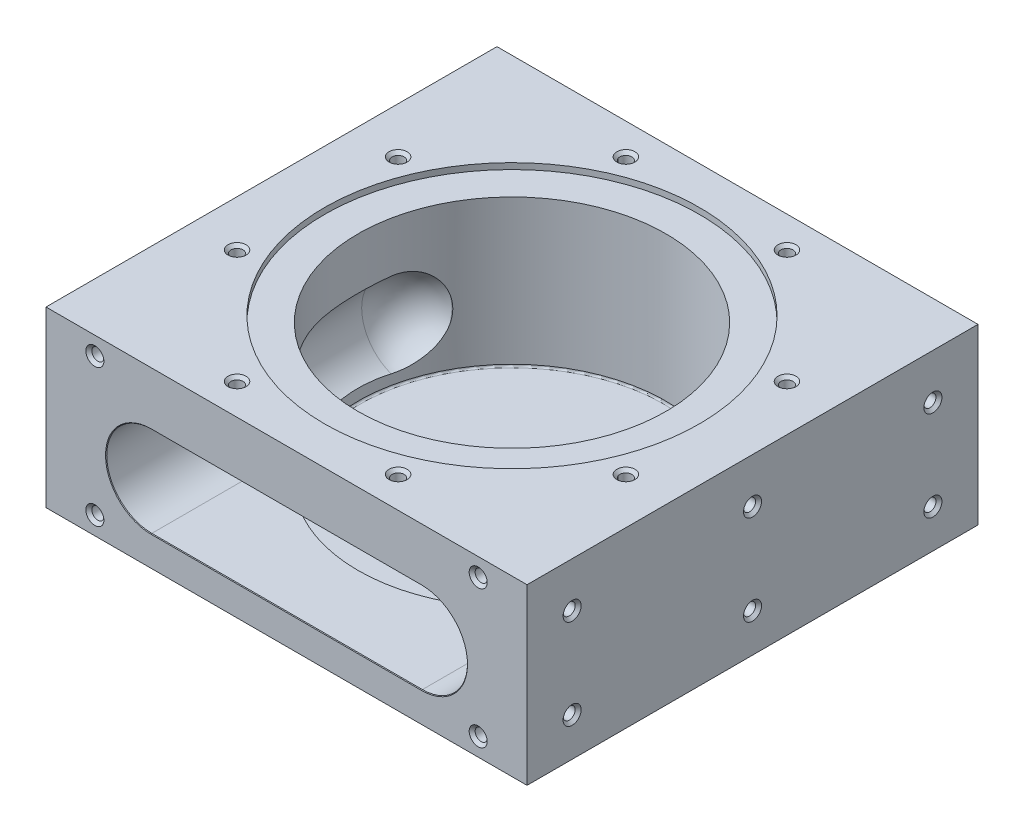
ISO-10303-21;
HEADER;
FILE_DESCRIPTION(('STEP AP214'),'2;1');
FILE_NAME('part.step','',(''),(''),'','','');
FILE_SCHEMA(('AUTOMOTIVE_DESIGN { 1 0 10303 214 1 1 1 1 }'));
ENDSEC;
DATA;
#1=APPLICATION_CONTEXT('core data for automotive mechanical design processes');
#2=APPLICATION_PROTOCOL_DEFINITION('international standard','automotive_design',2000,#1);
#3=PRODUCT_CONTEXT('',#1,'mechanical');
#4=PRODUCT('Part','Part','',(#3));
#5=PRODUCT_RELATED_PRODUCT_CATEGORY('part','',(#4));
#6=PRODUCT_DEFINITION_FORMATION('','',#4);
#7=PRODUCT_DEFINITION_CONTEXT('part definition',#1,'design');
#8=PRODUCT_DEFINITION('design','',#6,#7);
#9=PRODUCT_DEFINITION_SHAPE('','',#8);
#10=(LENGTH_UNIT() NAMED_UNIT(*) SI_UNIT(.MILLI.,.METRE.));
#11=(NAMED_UNIT(*) PLANE_ANGLE_UNIT() SI_UNIT($,.RADIAN.));
#12=(NAMED_UNIT(*) SI_UNIT($,.STERADIAN.) SOLID_ANGLE_UNIT());
#13=UNCERTAINTY_MEASURE_WITH_UNIT(LENGTH_MEASURE(1.E-05),#10,'distance_accuracy_value','');
#14=(GEOMETRIC_REPRESENTATION_CONTEXT(3) GLOBAL_UNCERTAINTY_ASSIGNED_CONTEXT((#13)) GLOBAL_UNIT_ASSIGNED_CONTEXT((#10,
#11,#12)) REPRESENTATION_CONTEXT('',''));
#15=CARTESIAN_POINT('',(0.,0.,0.));
#16=DIRECTION('',(0.,0.,1.));
#17=DIRECTION('',(1.,0.,0.));
#18=AXIS2_PLACEMENT_3D('',#15,#16,#17);
#19=CARTESIAN_POINT('',(203.2,73.406,0.));
#20=DIRECTION('',(-1.,0.,0.));
#21=DIRECTION('',(0.,0.,1.));
#22=AXIS2_PLACEMENT_3D('',#19,#20,#21);
#23=PLANE('',#22);
#24=CARTESIAN_POINT('',(203.2,54.356,-19.05));
#25=DIRECTION('',(1.,0.,0.));
#26=DIRECTION('',(0.,0.,-1.));
#27=AXIS2_PLACEMENT_3D('',#24,#25,#26);
#28=CIRCLE('',#27,3.81);
#29=CARTESIAN_POINT('',(203.2,54.356,-22.86));
#30=VERTEX_POINT('',#29);
#31=EDGE_CURVE('E618',#30,#30,#28,.T.);
#32=ORIENTED_EDGE('',*,*,#31,.F.);
#33=EDGE_LOOP('',(#32));
#34=FACE_BOUND('',#33,.T.);
#35=CARTESIAN_POINT('',(203.2,54.356,-171.45));
#36=DIRECTION('',(1.,0.,0.));
#37=DIRECTION('',(0.,0.,-1.));
#38=AXIS2_PLACEMENT_3D('',#35,#36,#37);
#39=CIRCLE('',#38,3.81);
#40=CARTESIAN_POINT('',(203.2,54.356,-175.26));
#41=VERTEX_POINT('',#40);
#42=EDGE_CURVE('E630',#41,#41,#39,.T.);
#43=ORIENTED_EDGE('',*,*,#42,.F.);
#44=EDGE_LOOP('',(#43));
#45=FACE_BOUND('',#44,.T.);
#46=CARTESIAN_POINT('',(203.2,16.256,-171.45));
#47=DIRECTION('',(1.,0.,0.));
#48=DIRECTION('',(0.,0.,-1.));
#49=AXIS2_PLACEMENT_3D('',#46,#47,#48);
#50=CIRCLE('',#49,3.81);
#51=CARTESIAN_POINT('',(203.2,16.256,-175.26));
#52=VERTEX_POINT('',#51);
#53=EDGE_CURVE('E642',#52,#52,#50,.T.);
#54=ORIENTED_EDGE('',*,*,#53,.F.);
#55=EDGE_LOOP('',(#54));
#56=FACE_BOUND('',#55,.T.);
#57=CARTESIAN_POINT('',(203.2,16.256,-95.25));
#58=DIRECTION('',(1.,0.,0.));
#59=DIRECTION('',(0.,0.,-1.));
#60=AXIS2_PLACEMENT_3D('',#57,#58,#59);
#61=CIRCLE('',#60,3.81);
#62=CARTESIAN_POINT('',(203.2,16.256,-99.06));
#63=VERTEX_POINT('',#62);
#64=EDGE_CURVE('E654',#63,#63,#61,.T.);
#65=ORIENTED_EDGE('',*,*,#64,.F.);
#66=EDGE_LOOP('',(#65));
#67=FACE_BOUND('',#66,.T.);
#68=CARTESIAN_POINT('',(203.2,16.256,-19.05));
#69=DIRECTION('',(1.,0.,0.));
#70=DIRECTION('',(0.,0.,-1.));
#71=AXIS2_PLACEMENT_3D('',#68,#69,#70);
#72=CIRCLE('',#71,3.81);
#73=CARTESIAN_POINT('',(203.2,16.256,-22.86));
#74=VERTEX_POINT('',#73);
#75=EDGE_CURVE('E666',#74,#74,#72,.T.);
#76=ORIENTED_EDGE('',*,*,#75,.F.);
#77=EDGE_LOOP('',(#76));
#78=FACE_BOUND('',#77,.T.);
#79=DIRECTION('',(0.,0.,-1.));
#80=VECTOR('',#79,1.);
#81=CARTESIAN_POINT('',(203.2,0.,0.));
#82=LINE('',#81,#80);
#83=CARTESIAN_POINT('',(203.2,0.,0.));
#84=VERTEX_POINT('',#83);
#85=CARTESIAN_POINT('',(203.2,0.,-190.5));
#86=VERTEX_POINT('',#85);
#87=EDGE_CURVE('E1106',#84,#86,#82,.T.);
#88=ORIENTED_EDGE('',*,*,#87,.T.);
#89=DIRECTION('',(0.,-1.,0.));
#90=VECTOR('',#89,1.);
#91=CARTESIAN_POINT('',(203.2,73.406,-190.5));
#92=LINE('',#91,#90);
#93=CARTESIAN_POINT('',(203.2,73.406,-190.5));
#94=VERTEX_POINT('',#93);
#95=EDGE_CURVE('E1114',#94,#86,#92,.T.);
#96=ORIENTED_EDGE('',*,*,#95,.F.);
#97=DIRECTION('',(0.,0.,-1.));
#98=VECTOR('',#97,1.);
#99=CARTESIAN_POINT('',(203.2,73.406,0.));
#100=LINE('',#99,#98);
#101=CARTESIAN_POINT('',(203.2,73.406,0.));
#102=VERTEX_POINT('',#101);
#103=EDGE_CURVE('E1093',#102,#94,#100,.T.);
#104=ORIENTED_EDGE('',*,*,#103,.F.);
#105=DIRECTION('',(0.,-1.,0.));
#106=VECTOR('',#105,1.);
#107=CARTESIAN_POINT('',(203.2,73.406,0.));
#108=LINE('',#107,#106);
#109=EDGE_CURVE('E1118',#102,#84,#108,.T.);
#110=ORIENTED_EDGE('',*,*,#109,.T.);
#111=EDGE_LOOP('',(#88,#96,#104,#110));
#112=FACE_BOUND('',#111,.T.);
#113=CARTESIAN_POINT('',(203.2,54.356,-95.25));
#114=DIRECTION('',(1.,0.,0.));
#115=DIRECTION('',(0.,0.,-1.));
#116=AXIS2_PLACEMENT_3D('',#113,#114,#115);
#117=CIRCLE('',#116,3.81);
#118=CARTESIAN_POINT('',(203.2,54.356,-99.06));
#119=VERTEX_POINT('',#118);
#120=EDGE_CURVE('E606',#119,#119,#117,.T.);
#121=ORIENTED_EDGE('',*,*,#120,.F.);
#122=EDGE_LOOP('',(#121));
#123=FACE_BOUND('',#122,.T.);
#124=ADVANCED_FACE('F152',(#34,#45,#56,#67,#78,#112,#123),#23,.F.);
#125=CARTESIAN_POINT('',(44.45,31.75,-107.95));
#126=DIRECTION('',(1.,0.,0.));
#127=DIRECTION('',(0.,1.,0.));
#128=AXIS2_PLACEMENT_3D('',#125,#126,#127);
#129=CYLINDRICAL_SURFACE('',#128,19.05);
#130=CARTESIAN_POINT('',(44.45,31.75,-107.95));
#131=DIRECTION('',(1.,0.,0.));
#132=DIRECTION('',(0.,0.,-1.));
#133=AXIS2_PLACEMENT_3D('',#130,#131,#132);
#134=CIRCLE('',#133,19.05);
#135=CARTESIAN_POINT('',(44.45,26.5132827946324,-126.266093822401));
#136=VERTEX_POINT('',#135);
#137=CARTESIAN_POINT('',(44.45,31.75,-127.));
#138=VERTEX_POINT('',#137);
#139=EDGE_CURVE('E1049',#136,#138,#134,.T.);
#140=ORIENTED_EDGE('',*,*,#139,.F.);
#141=CARTESIAN_POINT('',(44.45,26.5132827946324,-126.266093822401));
#142=CARTESIAN_POINT('',(44.5157306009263,26.9365562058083,-126.387159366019));
#143=CARTESIAN_POINT('',(44.5740641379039,27.3651365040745,-126.493773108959));
#144=CARTESIAN_POINT('',(44.6746537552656,28.2277651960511,-126.67669521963));
#145=CARTESIAN_POINT('',(44.7170067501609,28.661763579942,-126.753186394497));
#146=CARTESIAN_POINT('',(44.7851872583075,29.5353822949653,-126.87597657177));
#147=CARTESIAN_POINT('',(44.8110140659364,29.9750028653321,-126.922274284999));
#148=CARTESIAN_POINT('',(44.8370009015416,30.6378211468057,-126.968808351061));
#149=CARTESIAN_POINT('',(44.8435378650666,30.8600345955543,-126.980501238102));
#150=CARTESIAN_POINT('',(44.8522610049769,31.3048238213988,-126.996097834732));
#151=CARTESIAN_POINT('',(44.8544471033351,31.5273996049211,-127.00000140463));
#152=CARTESIAN_POINT('',(44.8544444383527,31.75,-127.));
#153=B_SPLINE_CURVE_WITH_KNOTS('',3,(#141,#142,#143,#144,#145,#146,#147,#148,#149,#150,#151,
#152),.UNSPECIFIED.,.F.,.F.,(4,2,2,2,2,4),(0.,1.33507737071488,2.66192276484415,
3.98882480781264,4.65652022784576,5.3242276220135),.UNSPECIFIED.);
#154=CARTESIAN_POINT('',(44.8544444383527,31.75,-127.));
#155=VERTEX_POINT('',#154);
#156=EDGE_CURVE('E860',#136,#155,#153,.T.);
#157=ORIENTED_EDGE('',*,*,#156,.T.);
#158=DIRECTION('',(1.,0.,0.));
#159=VECTOR('',#158,1.);
#160=CARTESIAN_POINT('',(44.45,31.75,-127.));
#161=LINE('',#160,#159);
#162=EDGE_CURVE('E1050',#138,#155,#161,.T.);
#163=ORIENTED_EDGE('',*,*,#162,.F.);
#164=EDGE_LOOP('',(#140,#157,#163));
#165=FACE_BOUND('',#164,.T.);
#166=ADVANCED_FACE('F1002',(#165),#129,.F.);
#167=CARTESIAN_POINT('',(44.45,31.75,-107.95));
#168=DIRECTION('',(-1.,0.,0.));
#169=DIRECTION('',(0.,-1.,0.));
#170=AXIS2_PLACEMENT_3D('',#167,#168,#169);
#171=CYLINDRICAL_SURFACE('',#170,19.05);
#172=CARTESIAN_POINT('',(158.75,31.75,-107.95));
#173=DIRECTION('',(1.,0.,0.));
#174=DIRECTION('',(0.,0.,-1.));
#175=AXIS2_PLACEMENT_3D('',#172,#173,#174);
#176=CIRCLE('',#175,19.05);
#177=CARTESIAN_POINT('',(158.75,31.75,-127.));
#178=VERTEX_POINT('',#177);
#179=CARTESIAN_POINT('',(158.75,36.9867172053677,-126.266093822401));
#180=VERTEX_POINT('',#179);
#181=EDGE_CURVE('E1044',#178,#180,#176,.T.);
#182=ORIENTED_EDGE('',*,*,#181,.T.);
#183=CARTESIAN_POINT('',(158.75,36.986717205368,-126.266093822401));
#184=CARTESIAN_POINT('',(158.684269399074,36.5634437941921,-126.387159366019));
#185=CARTESIAN_POINT('',(158.625935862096,36.1348634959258,-126.493773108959));
#186=CARTESIAN_POINT('',(158.525346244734,35.2722348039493,-126.67669521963));
#187=CARTESIAN_POINT('',(158.482993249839,34.8382364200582,-126.753186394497));
#188=CARTESIAN_POINT('',(158.414812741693,33.9646177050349,-126.87597657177));
#189=CARTESIAN_POINT('',(158.388985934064,33.5249971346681,-126.922274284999));
#190=CARTESIAN_POINT('',(158.362999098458,32.8621788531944,-126.968808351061));
#191=CARTESIAN_POINT('',(158.356462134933,32.6399654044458,-126.980501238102));
#192=CARTESIAN_POINT('',(158.347738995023,32.1951761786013,-126.996097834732));
#193=CARTESIAN_POINT('',(158.345552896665,31.9726003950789,-127.00000140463));
#194=CARTESIAN_POINT('',(158.345555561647,31.75,-127.));
#195=B_SPLINE_CURVE_WITH_KNOTS('',3,(#183,#184,#185,#186,#187,#188,#189,#190,#191,#192,#193,
#194),.UNSPECIFIED.,.F.,.F.,(4,2,2,2,2,4),(0.,1.33507737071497,2.66192276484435,
3.98882480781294,4.65652022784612,5.32422762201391),.UNSPECIFIED.);
#196=CARTESIAN_POINT('',(158.345555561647,31.75,-127.));
#197=VERTEX_POINT('',#196);
#198=EDGE_CURVE('E894',#180,#197,#195,.T.);
#199=ORIENTED_EDGE('',*,*,#198,.T.);
#200=EDGE_CURVE('E1046',#197,#178,#161,.T.);
#201=ORIENTED_EDGE('',*,*,#200,.T.);
#202=EDGE_LOOP('',(#182,#199,#201));
#203=FACE_BOUND('',#202,.T.);
#204=ADVANCED_FACE('F1010',(#203),#171,.F.);
#205=CARTESIAN_POINT('',(0.,73.406,0.));
#206=DIRECTION('',(1.,0.,0.));
#207=DIRECTION('',(0.,0.,-1.));
#208=AXIS2_PLACEMENT_3D('',#205,#206,#207);
#209=PLANE('',#208);
#210=CARTESIAN_POINT('',(0.,54.356,-95.25));
#211=DIRECTION('',(-1.,0.,0.));
#212=DIRECTION('',(0.,0.,1.));
#213=AXIS2_PLACEMENT_3D('',#210,#211,#212);
#214=CIRCLE('',#213,3.81);
#215=CARTESIAN_POINT('',(0.,54.356,-91.44));
#216=VERTEX_POINT('',#215);
#217=EDGE_CURVE('E678',#216,#216,#214,.T.);
#218=ORIENTED_EDGE('',*,*,#217,.F.);
#219=EDGE_LOOP('',(#218));
#220=FACE_BOUND('',#219,.T.);
#221=CARTESIAN_POINT('',(0.,54.356,-19.05));
#222=DIRECTION('',(-1.,0.,0.));
#223=DIRECTION('',(0.,0.,1.));
#224=AXIS2_PLACEMENT_3D('',#221,#222,#223);
#225=CIRCLE('',#224,3.81);
#226=CARTESIAN_POINT('',(0.,54.356,-15.24));
#227=VERTEX_POINT('',#226);
#228=EDGE_CURVE('E690',#227,#227,#225,.T.);
#229=ORIENTED_EDGE('',*,*,#228,.F.);
#230=EDGE_LOOP('',(#229));
#231=FACE_BOUND('',#230,.T.);
#232=CARTESIAN_POINT('',(0.,54.356,-171.45));
#233=DIRECTION('',(-1.,0.,0.));
#234=DIRECTION('',(0.,0.,1.));
#235=AXIS2_PLACEMENT_3D('',#232,#233,#234);
#236=CIRCLE('',#235,3.81);
#237=CARTESIAN_POINT('',(0.,54.356,-167.64));
#238=VERTEX_POINT('',#237);
#239=EDGE_CURVE('E702',#238,#238,#236,.T.);
#240=ORIENTED_EDGE('',*,*,#239,.F.);
#241=EDGE_LOOP('',(#240));
#242=FACE_BOUND('',#241,.T.);
#243=CARTESIAN_POINT('',(0.,16.256,-171.45));
#244=DIRECTION('',(-1.,0.,0.));
#245=DIRECTION('',(0.,0.,1.));
#246=AXIS2_PLACEMENT_3D('',#243,#244,#245);
#247=CIRCLE('',#246,3.81);
#248=CARTESIAN_POINT('',(0.,16.256,-167.64));
#249=VERTEX_POINT('',#248);
#250=EDGE_CURVE('E714',#249,#249,#247,.T.);
#251=ORIENTED_EDGE('',*,*,#250,.F.);
#252=EDGE_LOOP('',(#251));
#253=FACE_BOUND('',#252,.T.);
#254=CARTESIAN_POINT('',(0.,16.256,-95.25));
#255=DIRECTION('',(-1.,0.,0.));
#256=DIRECTION('',(0.,0.,1.));
#257=AXIS2_PLACEMENT_3D('',#254,#255,#256);
#258=CIRCLE('',#257,3.81);
#259=CARTESIAN_POINT('',(0.,16.256,-91.44));
#260=VERTEX_POINT('',#259);
#261=EDGE_CURVE('E726',#260,#260,#258,.T.);
#262=ORIENTED_EDGE('',*,*,#261,.F.);
#263=EDGE_LOOP('',(#262));
#264=FACE_BOUND('',#263,.T.);
#265=CARTESIAN_POINT('',(0.,16.256,-19.05));
#266=DIRECTION('',(-1.,0.,0.));
#267=DIRECTION('',(0.,0.,1.));
#268=AXIS2_PLACEMENT_3D('',#265,#266,#267);
#269=CIRCLE('',#268,3.81);
#270=CARTESIAN_POINT('',(0.,16.256,-15.24));
#271=VERTEX_POINT('',#270);
#272=EDGE_CURVE('E738',#271,#271,#269,.T.);
#273=ORIENTED_EDGE('',*,*,#272,.F.);
#274=EDGE_LOOP('',(#273));
#275=FACE_BOUND('',#274,.T.);
#276=DIRECTION('',(0.,0.,1.));
#277=VECTOR('',#276,1.);
#278=CARTESIAN_POINT('',(0.,0.,0.));
#279=LINE('',#278,#277);
#280=CARTESIAN_POINT('',(0.,0.,-190.5));
#281=VERTEX_POINT('',#280);
#282=CARTESIAN_POINT('',(0.,0.,0.));
#283=VERTEX_POINT('',#282);
#284=EDGE_CURVE('E1079',#281,#283,#279,.T.);
#285=ORIENTED_EDGE('',*,*,#284,.T.);
#286=DIRECTION('',(0.,-1.,0.));
#287=VECTOR('',#286,1.);
#288=CARTESIAN_POINT('',(0.,73.406,0.));
#289=LINE('',#288,#287);
#290=CARTESIAN_POINT('',(0.,73.406,0.));
#291=VERTEX_POINT('',#290);
#292=EDGE_CURVE('E1122',#291,#283,#289,.T.);
#293=ORIENTED_EDGE('',*,*,#292,.F.);
#294=DIRECTION('',(0.,0.,1.));
#295=VECTOR('',#294,1.);
#296=CARTESIAN_POINT('',(0.,73.406,0.));
#297=LINE('',#296,#295);
#298=CARTESIAN_POINT('',(0.,73.406,-190.5));
#299=VERTEX_POINT('',#298);
#300=EDGE_CURVE('E1085',#299,#291,#297,.T.);
#301=ORIENTED_EDGE('',*,*,#300,.F.);
#302=DIRECTION('',(0.,-1.,0.));
#303=VECTOR('',#302,1.);
#304=CARTESIAN_POINT('',(0.,73.406,-190.5));
#305=LINE('',#304,#303);
#306=EDGE_CURVE('E1099',#299,#281,#305,.T.);
#307=ORIENTED_EDGE('',*,*,#306,.T.);
#308=EDGE_LOOP('',(#285,#293,#301,#307));
#309=FACE_BOUND('',#308,.T.);
#310=ADVANCED_FACE('F1021',(#220,#231,#242,#253,#264,#275,#309),#209,.F.);
#311=CARTESIAN_POINT('',(0.,73.406,0.));
#312=DIRECTION('',(0.,0.,-1.));
#313=DIRECTION('',(-1.,0.,0.));
#314=AXIS2_PLACEMENT_3D('',#311,#312,#313);
#315=PLANE('',#314);
#316=CARTESIAN_POINT('',(44.45,31.75,0.));
#317=DIRECTION('',(0.,0.,-1.));
#318=DIRECTION('',(-1.,0.,0.));
#319=AXIS2_PLACEMENT_3D('',#316,#317,#318);
#320=CIRCLE('',#319,19.304);
#321=CARTESIAN_POINT('',(44.45,12.446,0.));
#322=VERTEX_POINT('',#321);
#323=CARTESIAN_POINT('',(44.45,51.054,0.));
#324=VERTEX_POINT('',#323);
#325=EDGE_CURVE('E1538',#322,#324,#320,.T.);
#326=ORIENTED_EDGE('',*,*,#325,.T.);
#327=DIRECTION('',(1.,0.,0.));
#328=VECTOR('',#327,1.);
#329=CARTESIAN_POINT('',(0.,51.054,0.));
#330=LINE('',#329,#328);
#331=CARTESIAN_POINT('',(158.75,51.054,0.));
#332=VERTEX_POINT('',#331);
#333=EDGE_CURVE('E1541',#324,#332,#330,.T.);
#334=ORIENTED_EDGE('',*,*,#333,.T.);
#335=CARTESIAN_POINT('',(158.75,31.75,0.));
#336=DIRECTION('',(0.,0.,-1.));
#337=DIRECTION('',(-1.,0.,0.));
#338=AXIS2_PLACEMENT_3D('',#335,#336,#337);
#339=CIRCLE('',#338,19.304);
#340=CARTESIAN_POINT('',(158.75,12.446,0.));
#341=VERTEX_POINT('',#340);
#342=EDGE_CURVE('E1535',#332,#341,#339,.T.);
#343=ORIENTED_EDGE('',*,*,#342,.T.);
#344=DIRECTION('',(-1.,0.,0.));
#345=VECTOR('',#344,1.);
#346=CARTESIAN_POINT('',(0.,12.446,0.));
#347=LINE('',#346,#345);
#348=EDGE_CURVE('E1532',#341,#322,#347,.T.);
#349=ORIENTED_EDGE('',*,*,#348,.T.);
#350=EDGE_LOOP('',(#326,#334,#343,#349));
#351=FACE_BOUND('',#350,.T.);
#352=CARTESIAN_POINT('',(20.6375,65.786,0.));
#353=DIRECTION('',(0.,0.,1.));
#354=DIRECTION('',(1.,0.,0.));
#355=AXIS2_PLACEMENT_3D('',#352,#353,#354);
#356=CIRCLE('',#355,3.81);
#357=CARTESIAN_POINT('',(24.4475,65.786,0.));
#358=VERTEX_POINT('',#357);
#359=EDGE_CURVE('E558',#358,#358,#356,.T.);
#360=ORIENTED_EDGE('',*,*,#359,.F.);
#361=EDGE_LOOP('',(#360));
#362=FACE_BOUND('',#361,.T.);
#363=CARTESIAN_POINT('',(182.5625,7.62,0.));
#364=DIRECTION('',(0.,0.,1.));
#365=DIRECTION('',(1.,0.,0.));
#366=AXIS2_PLACEMENT_3D('',#363,#364,#365);
#367=CIRCLE('',#366,3.81000000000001);
#368=CARTESIAN_POINT('',(186.3725,7.62,0.));
#369=VERTEX_POINT('',#368);
#370=EDGE_CURVE('E570',#369,#369,#367,.T.);
#371=ORIENTED_EDGE('',*,*,#370,.F.);
#372=EDGE_LOOP('',(#371));
#373=FACE_BOUND('',#372,.T.);
#374=CARTESIAN_POINT('',(20.6375,7.62,0.));
#375=DIRECTION('',(0.,0.,1.));
#376=DIRECTION('',(1.,0.,0.));
#377=AXIS2_PLACEMENT_3D('',#374,#375,#376);
#378=CIRCLE('',#377,3.81);
#379=CARTESIAN_POINT('',(24.4475,7.62,0.));
#380=VERTEX_POINT('',#379);
#381=EDGE_CURVE('E582',#380,#380,#378,.T.);
#382=ORIENTED_EDGE('',*,*,#381,.F.);
#383=EDGE_LOOP('',(#382));
#384=FACE_BOUND('',#383,.T.);
#385=CARTESIAN_POINT('',(182.5625,65.786,0.));
#386=DIRECTION('',(0.,0.,1.));
#387=DIRECTION('',(1.,0.,0.));
#388=AXIS2_PLACEMENT_3D('',#385,#386,#387);
#389=CIRCLE('',#388,3.81000000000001);
#390=CARTESIAN_POINT('',(186.3725,65.786,0.));
#391=VERTEX_POINT('',#390);
#392=EDGE_CURVE('E594',#391,#391,#389,.T.);
#393=ORIENTED_EDGE('',*,*,#392,.F.);
#394=EDGE_LOOP('',(#393));
#395=FACE_BOUND('',#394,.T.);
#396=DIRECTION('',(1.,0.,0.));
#397=VECTOR('',#396,1.);
#398=CARTESIAN_POINT('',(0.,0.,0.));
#399=LINE('',#398,#397);
#400=EDGE_CURVE('E1103',#283,#84,#399,.T.);
#401=ORIENTED_EDGE('',*,*,#400,.T.);
#402=ORIENTED_EDGE('',*,*,#109,.F.);
#403=DIRECTION('',(1.,0.,0.));
#404=VECTOR('',#403,1.);
#405=CARTESIAN_POINT('',(0.,73.406,0.));
#406=LINE('',#405,#404);
#407=EDGE_CURVE('E1089',#291,#102,#406,.T.);
#408=ORIENTED_EDGE('',*,*,#407,.F.);
#409=ORIENTED_EDGE('',*,*,#292,.T.);
#410=EDGE_LOOP('',(#401,#402,#408,#409));
#411=FACE_BOUND('',#410,.T.);
#412=ADVANCED_FACE('F1018',(#351,#362,#373,#384,#395,#411),#315,.F.);
#413=CARTESIAN_POINT('',(0.,73.406,-190.5));
#414=DIRECTION('',(0.,0.,1.));
#415=DIRECTION('',(1.,0.,0.));
#416=AXIS2_PLACEMENT_3D('',#413,#414,#415);
#417=PLANE('',#416);
#418=DIRECTION('',(-1.,0.,0.));
#419=VECTOR('',#418,1.);
#420=CARTESIAN_POINT('',(0.,0.,-190.5));
#421=LINE('',#420,#419);
#422=EDGE_CURVE('E1090',#86,#281,#421,.T.);
#423=ORIENTED_EDGE('',*,*,#422,.T.);
#424=ORIENTED_EDGE('',*,*,#306,.F.);
#425=DIRECTION('',(-1.,0.,0.));
#426=VECTOR('',#425,1.);
#427=CARTESIAN_POINT('',(0.,73.406,-190.5));
#428=LINE('',#427,#426);
#429=EDGE_CURVE('E1096',#94,#299,#428,.T.);
#430=ORIENTED_EDGE('',*,*,#429,.F.);
#431=ORIENTED_EDGE('',*,*,#95,.T.);
#432=EDGE_LOOP('',(#423,#424,#430,#431));
#433=FACE_BOUND('',#432,.T.);
#434=ADVANCED_FACE('F1016',(#433),#417,.F.);
#435=CARTESIAN_POINT('',(0.,73.406,-190.5));
#436=DIRECTION('',(0.,-1.,0.));
#437=DIRECTION('',(0.,0.,-1.));
#438=AXIS2_PLACEMENT_3D('',#435,#436,#437);
#439=PLANE('',#438);
#440=CARTESIAN_POINT('',(183.732890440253,73.406,-129.270557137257));
#441=DIRECTION('',(0.,1.,0.));
#442=DIRECTION('',(0.,0.,1.));
#443=AXIS2_PLACEMENT_3D('',#440,#441,#442);
#444=CIRCLE('',#443,3.81000000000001);
#445=CARTESIAN_POINT('',(183.732890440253,73.406,-125.460557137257));
#446=VERTEX_POINT('',#445);
#447=EDGE_CURVE('E750',#446,#446,#444,.T.);
#448=ORIENTED_EDGE('',*,*,#447,.F.);
#449=EDGE_LOOP('',(#448));
#450=FACE_BOUND('',#449,.T.);
#451=CARTESIAN_POINT('',(183.732890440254,73.406,-61.2294428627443));
#452=DIRECTION('',(0.,1.,0.));
#453=DIRECTION('',(0.,0.,1.));
#454=AXIS2_PLACEMENT_3D('',#451,#452,#453);
#455=CIRCLE('',#454,3.81000000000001);
#456=CARTESIAN_POINT('',(183.732890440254,73.406,-57.4194428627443));
#457=VERTEX_POINT('',#456);
#458=EDGE_CURVE('E762',#457,#457,#455,.T.);
#459=ORIENTED_EDGE('',*,*,#458,.F.);
#460=EDGE_LOOP('',(#459));
#461=FACE_BOUND('',#460,.T.);
#462=CARTESIAN_POINT('',(135.620557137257,73.406,-13.1171095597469));
#463=DIRECTION('',(0.,1.,0.));
#464=DIRECTION('',(0.,0.,1.));
#465=AXIS2_PLACEMENT_3D('',#462,#463,#464);
#466=CIRCLE('',#465,3.81000000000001);
#467=CARTESIAN_POINT('',(135.620557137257,73.406,-9.30710955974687));
#468=VERTEX_POINT('',#467);
#469=EDGE_CURVE('E774',#468,#468,#466,.T.);
#470=ORIENTED_EDGE('',*,*,#469,.F.);
#471=EDGE_LOOP('',(#470));
#472=FACE_BOUND('',#471,.T.);
#473=CARTESIAN_POINT('',(67.5794428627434,73.406,-13.1171095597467));
#474=DIRECTION('',(0.,1.,0.));
#475=DIRECTION('',(0.,0.,1.));
#476=AXIS2_PLACEMENT_3D('',#473,#474,#475);
#477=CIRCLE('',#476,3.80999999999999);
#478=CARTESIAN_POINT('',(67.5794428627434,73.406,-9.30710955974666));
#479=VERTEX_POINT('',#478);
#480=EDGE_CURVE('E786',#479,#479,#477,.T.);
#481=ORIENTED_EDGE('',*,*,#480,.F.);
#482=EDGE_LOOP('',(#481));
#483=FACE_BOUND('',#482,.T.);
#484=CARTESIAN_POINT('',(19.4671095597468,73.406,-61.2294428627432));
#485=DIRECTION('',(0.,1.,0.));
#486=DIRECTION('',(0.,0.,1.));
#487=AXIS2_PLACEMENT_3D('',#484,#485,#486);
#488=CIRCLE('',#487,3.81);
#489=CARTESIAN_POINT('',(19.4671095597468,73.406,-57.4194428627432));
#490=VERTEX_POINT('',#489);
#491=EDGE_CURVE('E798',#490,#490,#488,.T.);
#492=ORIENTED_EDGE('',*,*,#491,.F.);
#493=EDGE_LOOP('',(#492));
#494=FACE_BOUND('',#493,.T.);
#495=CARTESIAN_POINT('',(19.4671095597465,73.406,-129.270557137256));
#496=DIRECTION('',(0.,1.,0.));
#497=DIRECTION('',(0.,0.,1.));
#498=AXIS2_PLACEMENT_3D('',#495,#496,#497);
#499=CIRCLE('',#498,3.81);
#500=CARTESIAN_POINT('',(19.4671095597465,73.406,-125.460557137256));
#501=VERTEX_POINT('',#500);
#502=EDGE_CURVE('E810',#501,#501,#499,.T.);
#503=ORIENTED_EDGE('',*,*,#502,.F.);
#504=EDGE_LOOP('',(#503));
#505=FACE_BOUND('',#504,.T.);
#506=CARTESIAN_POINT('',(67.5794428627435,73.406,-177.382890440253));
#507=DIRECTION('',(0.,1.,0.));
#508=DIRECTION('',(0.,0.,1.));
#509=AXIS2_PLACEMENT_3D('',#506,#507,#508);
#510=CIRCLE('',#509,3.80999999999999);
#511=CARTESIAN_POINT('',(67.5794428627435,73.406,-173.572890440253));
#512=VERTEX_POINT('',#511);
#513=EDGE_CURVE('E822',#512,#512,#510,.T.);
#514=ORIENTED_EDGE('',*,*,#513,.F.);
#515=EDGE_LOOP('',(#514));
#516=FACE_BOUND('',#515,.T.);
#517=CARTESIAN_POINT('',(135.620557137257,73.406,-177.382890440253));
#518=DIRECTION('',(0.,1.,0.));
#519=DIRECTION('',(0.,0.,1.));
#520=AXIS2_PLACEMENT_3D('',#517,#518,#519);
#521=CIRCLE('',#520,3.81000000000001);
#522=CARTESIAN_POINT('',(135.620557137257,73.406,-173.572890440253));
#523=VERTEX_POINT('',#522);
#524=EDGE_CURVE('E834',#523,#523,#521,.T.);
#525=ORIENTED_EDGE('',*,*,#524,.F.);
#526=EDGE_LOOP('',(#525));
#527=FACE_BOUND('',#526,.T.);
#528=CARTESIAN_POINT('',(101.6,73.406,-95.25));
#529=DIRECTION('',(0.,1.,0.));
#530=DIRECTION('',(0.,0.,1.));
#531=AXIS2_PLACEMENT_3D('',#528,#529,#530);
#532=CIRCLE('',#531,79.1845);
#533=CARTESIAN_POINT('',(101.6,73.406,-16.0655));
#534=VERTEX_POINT('',#533);
#535=EDGE_CURVE('E1080',#534,#534,#532,.T.);
#536=ORIENTED_EDGE('',*,*,#535,.F.);
#537=EDGE_LOOP('',(#536));
#538=FACE_BOUND('',#537,.T.);
#539=ORIENTED_EDGE('',*,*,#300,.T.);
#540=ORIENTED_EDGE('',*,*,#407,.T.);
#541=ORIENTED_EDGE('',*,*,#103,.T.);
#542=ORIENTED_EDGE('',*,*,#429,.T.);
#543=EDGE_LOOP('',(#539,#540,#541,#542));
#544=FACE_BOUND('',#543,.T.);
#545=ADVANCED_FACE('F1198',(#450,#461,#472,#483,#494,#505,#516,#527,#538,#544),#439,.F.);
#546=CARTESIAN_POINT('',(0.,0.,-190.5));
#547=DIRECTION('',(0.,-1.,0.));
#548=DIRECTION('',(0.,0.,-1.));
#549=AXIS2_PLACEMENT_3D('',#546,#547,#548);
#550=PLANE('',#549);
#551=CARTESIAN_POINT('',(10.16,0.,-180.34));
#552=DIRECTION('',(0.,-1.,0.));
#553=DIRECTION('',(0.,0.,-1.));
#554=AXIS2_PLACEMENT_3D('',#551,#552,#553);
#555=CIRCLE('',#554,3.81);
#556=CARTESIAN_POINT('',(10.16,0.,-184.15));
#557=VERTEX_POINT('',#556);
#558=EDGE_CURVE('E403',#557,#557,#555,.T.);
#559=ORIENTED_EDGE('',*,*,#558,.F.);
#560=EDGE_LOOP('',(#559));
#561=FACE_BOUND('',#560,.T.);
#562=CARTESIAN_POINT('',(22.86,0.,-154.94));
#563=DIRECTION('',(0.,-1.,0.));
#564=DIRECTION('',(0.,0.,-1.));
#565=AXIS2_PLACEMENT_3D('',#562,#563,#564);
#566=CIRCLE('',#565,3.81);
#567=CARTESIAN_POINT('',(22.86,0.,-158.75));
#568=VERTEX_POINT('',#567);
#569=EDGE_CURVE('E393',#568,#568,#566,.T.);
#570=ORIENTED_EDGE('',*,*,#569,.F.);
#571=EDGE_LOOP('',(#570));
#572=FACE_BOUND('',#571,.T.);
#573=CARTESIAN_POINT('',(60.96,0.,-180.34));
#574=DIRECTION('',(0.,-1.,0.));
#575=DIRECTION('',(0.,0.,-1.));
#576=AXIS2_PLACEMENT_3D('',#573,#574,#575);
#577=CIRCLE('',#576,3.80999999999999);
#578=CARTESIAN_POINT('',(60.96,0.,-184.15));
#579=VERTEX_POINT('',#578);
#580=EDGE_CURVE('E414',#579,#579,#577,.T.);
#581=ORIENTED_EDGE('',*,*,#580,.F.);
#582=EDGE_LOOP('',(#581));
#583=FACE_BOUND('',#582,.T.);
#584=CARTESIAN_POINT('',(10.16,0.,-10.16));
#585=DIRECTION('',(0.,-1.,0.));
#586=DIRECTION('',(0.,0.,-1.));
#587=AXIS2_PLACEMENT_3D('',#584,#585,#586);
#588=CIRCLE('',#587,3.81);
#589=CARTESIAN_POINT('',(10.16,0.,-13.97));
#590=VERTEX_POINT('',#589);
#591=EDGE_CURVE('E426',#590,#590,#588,.T.);
#592=ORIENTED_EDGE('',*,*,#591,.F.);
#593=EDGE_LOOP('',(#592));
#594=FACE_BOUND('',#593,.T.);
#595=CARTESIAN_POINT('',(10.16,0.,-60.96));
#596=DIRECTION('',(0.,-1.,0.));
#597=DIRECTION('',(0.,0.,-1.));
#598=AXIS2_PLACEMENT_3D('',#595,#596,#597);
#599=CIRCLE('',#598,3.81);
#600=CARTESIAN_POINT('',(10.16,0.,-64.77));
#601=VERTEX_POINT('',#600);
#602=EDGE_CURVE('E438',#601,#601,#599,.T.);
#603=ORIENTED_EDGE('',*,*,#602,.F.);
#604=EDGE_LOOP('',(#603));
#605=FACE_BOUND('',#604,.T.);
#606=CARTESIAN_POINT('',(10.16,0.,-129.54));
#607=DIRECTION('',(0.,-1.,0.));
#608=DIRECTION('',(0.,0.,-1.));
#609=AXIS2_PLACEMENT_3D('',#606,#607,#608);
#610=CIRCLE('',#609,3.81);
#611=CARTESIAN_POINT('',(10.16,0.,-133.35));
#612=VERTEX_POINT('',#611);
#613=EDGE_CURVE('E450',#612,#612,#610,.T.);
#614=ORIENTED_EDGE('',*,*,#613,.F.);
#615=EDGE_LOOP('',(#614));
#616=FACE_BOUND('',#615,.T.);
#617=CARTESIAN_POINT('',(22.86,0.,-35.56));
#618=DIRECTION('',(0.,-1.,0.));
#619=DIRECTION('',(0.,0.,-1.));
#620=AXIS2_PLACEMENT_3D('',#617,#618,#619);
#621=CIRCLE('',#620,3.81);
#622=CARTESIAN_POINT('',(22.86,0.,-39.37));
#623=VERTEX_POINT('',#622);
#624=EDGE_CURVE('E462',#623,#623,#621,.T.);
#625=ORIENTED_EDGE('',*,*,#624,.F.);
#626=EDGE_LOOP('',(#625));
#627=FACE_BOUND('',#626,.T.);
#628=CARTESIAN_POINT('',(193.04,0.,-180.34));
#629=DIRECTION('',(0.,-1.,0.));
#630=DIRECTION('',(0.,0.,-1.));
#631=AXIS2_PLACEMENT_3D('',#628,#629,#630);
#632=CIRCLE('',#631,3.81000000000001);
#633=CARTESIAN_POINT('',(193.04,0.,-184.15));
#634=VERTEX_POINT('',#633);
#635=EDGE_CURVE('E474',#634,#634,#632,.T.);
#636=ORIENTED_EDGE('',*,*,#635,.F.);
#637=EDGE_LOOP('',(#636));
#638=FACE_BOUND('',#637,.T.);
#639=CARTESIAN_POINT('',(180.34,0.,-154.94));
#640=DIRECTION('',(0.,-1.,0.));
#641=DIRECTION('',(0.,0.,-1.));
#642=AXIS2_PLACEMENT_3D('',#639,#640,#641);
#643=CIRCLE('',#642,3.81000000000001);
#644=CARTESIAN_POINT('',(180.34,0.,-158.75));
#645=VERTEX_POINT('',#644);
#646=EDGE_CURVE('E486',#645,#645,#643,.T.);
#647=ORIENTED_EDGE('',*,*,#646,.F.);
#648=EDGE_LOOP('',(#647));
#649=FACE_BOUND('',#648,.T.);
#650=CARTESIAN_POINT('',(142.24,0.,-180.34));
#651=DIRECTION('',(0.,-1.,0.));
#652=DIRECTION('',(0.,0.,-1.));
#653=AXIS2_PLACEMENT_3D('',#650,#651,#652);
#654=CIRCLE('',#653,3.81000000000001);
#655=CARTESIAN_POINT('',(142.24,0.,-184.15));
#656=VERTEX_POINT('',#655);
#657=EDGE_CURVE('E498',#656,#656,#654,.T.);
#658=ORIENTED_EDGE('',*,*,#657,.F.);
#659=EDGE_LOOP('',(#658));
#660=FACE_BOUND('',#659,.T.);
#661=CARTESIAN_POINT('',(193.04,0.,-10.16));
#662=DIRECTION('',(0.,-1.,0.));
#663=DIRECTION('',(0.,0.,-1.));
#664=AXIS2_PLACEMENT_3D('',#661,#662,#663);
#665=CIRCLE('',#664,3.81000000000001);
#666=CARTESIAN_POINT('',(193.04,0.,-13.97));
#667=VERTEX_POINT('',#666);
#668=EDGE_CURVE('E510',#667,#667,#665,.T.);
#669=ORIENTED_EDGE('',*,*,#668,.F.);
#670=EDGE_LOOP('',(#669));
#671=FACE_BOUND('',#670,.T.);
#672=CARTESIAN_POINT('',(193.04,0.,-60.96));
#673=DIRECTION('',(0.,-1.,0.));
#674=DIRECTION('',(0.,0.,-1.));
#675=AXIS2_PLACEMENT_3D('',#672,#673,#674);
#676=CIRCLE('',#675,3.81000000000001);
#677=CARTESIAN_POINT('',(193.04,0.,-64.77));
#678=VERTEX_POINT('',#677);
#679=EDGE_CURVE('E522',#678,#678,#676,.T.);
#680=ORIENTED_EDGE('',*,*,#679,.F.);
#681=EDGE_LOOP('',(#680));
#682=FACE_BOUND('',#681,.T.);
#683=CARTESIAN_POINT('',(193.04,0.,-129.54));
#684=DIRECTION('',(0.,-1.,0.));
#685=DIRECTION('',(0.,0.,-1.));
#686=AXIS2_PLACEMENT_3D('',#683,#684,#685);
#687=CIRCLE('',#686,3.81000000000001);
#688=CARTESIAN_POINT('',(193.04,0.,-133.35));
#689=VERTEX_POINT('',#688);
#690=EDGE_CURVE('E534',#689,#689,#687,.T.);
#691=ORIENTED_EDGE('',*,*,#690,.F.);
#692=EDGE_LOOP('',(#691));
#693=FACE_BOUND('',#692,.T.);
#694=CARTESIAN_POINT('',(180.34,0.,-35.56));
#695=DIRECTION('',(0.,-1.,0.));
#696=DIRECTION('',(0.,0.,-1.));
#697=AXIS2_PLACEMENT_3D('',#694,#695,#696);
#698=CIRCLE('',#697,3.81000000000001);
#699=CARTESIAN_POINT('',(180.34,0.,-39.37));
#700=VERTEX_POINT('',#699);
#701=EDGE_CURVE('E546',#700,#700,#698,.T.);
#702=ORIENTED_EDGE('',*,*,#701,.F.);
#703=EDGE_LOOP('',(#702));
#704=FACE_BOUND('',#703,.T.);
#705=ORIENTED_EDGE('',*,*,#284,.F.);
#706=ORIENTED_EDGE('',*,*,#422,.F.);
#707=ORIENTED_EDGE('',*,*,#87,.F.);
#708=ORIENTED_EDGE('',*,*,#400,.F.);
#709=EDGE_LOOP('',(#705,#706,#707,#708));
#710=FACE_BOUND('',#709,.T.);
#711=ADVANCED_FACE('F1196',(#561,#572,#583,#594,#605,#616,#627,#638,#649,#660,#671,#682,#693,
#704,#710),#550,.T.);
#712=CARTESIAN_POINT('',(101.6,70.866,-95.25));
#713=DIRECTION('',(0.,1.,0.));
#714=DIRECTION('',(0.,0.,1.));
#715=AXIS2_PLACEMENT_3D('',#712,#713,#714);
#716=CYLINDRICAL_SURFACE('',#715,79.1845);
#717=CARTESIAN_POINT('',(101.6,70.866,-95.25));
#718=DIRECTION('',(0.,1.,0.));
#719=DIRECTION('',(0.,0.,1.));
#720=AXIS2_PLACEMENT_3D('',#717,#718,#719);
#721=CIRCLE('',#720,79.1845);
#722=CARTESIAN_POINT('',(101.6,70.866,-16.0655));
#723=VERTEX_POINT('',#722);
#724=EDGE_CURVE('E1075',#723,#723,#721,.T.);
#725=ORIENTED_EDGE('',*,*,#724,.F.);
#726=EDGE_LOOP('',(#725));
#727=FACE_BOUND('',#726,.T.);
#728=ORIENTED_EDGE('',*,*,#535,.T.);
#729=EDGE_LOOP('',(#728));
#730=FACE_BOUND('',#729,.T.);
#731=ADVANCED_FACE('F1187',(#727,#730),#716,.F.);
#732=CARTESIAN_POINT('',(101.6,70.866,-95.25));
#733=DIRECTION('',(0.,1.,0.));
#734=DIRECTION('',(0.,0.,1.));
#735=AXIS2_PLACEMENT_3D('',#732,#733,#734);
#736=PLANE('',#735);
#737=CARTESIAN_POINT('',(101.6,70.866,-95.25));
#738=DIRECTION('',(0.,1.,0.));
#739=DIRECTION('',(0.,0.,1.));
#740=AXIS2_PLACEMENT_3D('',#737,#738,#739);
#741=CIRCLE('',#740,65.024);
#742=CARTESIAN_POINT('',(101.6,70.866,-30.226));
#743=VERTEX_POINT('',#742);
#744=EDGE_CURVE('E846',#743,#743,#741,.T.);
#745=ORIENTED_EDGE('',*,*,#744,.F.);
#746=EDGE_LOOP('',(#745));
#747=FACE_BOUND('',#746,.T.);
#748=ORIENTED_EDGE('',*,*,#724,.T.);
#749=EDGE_LOOP('',(#748));
#750=FACE_BOUND('',#749,.T.);
#751=ADVANCED_FACE('F1183',(#747,#750),#736,.T.);
#752=CARTESIAN_POINT('',(44.45,31.75,-127.));
#753=DIRECTION('',(0.,0.,1.));
#754=DIRECTION('',(1.,0.,0.));
#755=AXIS2_PLACEMENT_3D('',#752,#753,#754);
#756=CYLINDRICAL_SURFACE('',#755,19.05);
#757=DIRECTION('',(0.,0.,1.));
#758=VECTOR('',#757,1.);
#759=CARTESIAN_POINT('',(44.45,50.8,-127.));
#760=LINE('',#759,#758);
#761=CARTESIAN_POINT('',(44.45,50.8,-64.2339061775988));
#762=VERTEX_POINT('',#761);
#763=CARTESIAN_POINT('',(44.45,50.8,-0.254000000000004));
#764=VERTEX_POINT('',#763);
#765=EDGE_CURVE('E1084',#762,#764,#760,.T.);
#766=ORIENTED_EDGE('',*,*,#765,.T.);
#767=CARTESIAN_POINT('',(44.45,31.75,-0.254000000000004));
#768=DIRECTION('',(0.,0.,-1.));
#769=DIRECTION('',(-1.,0.,0.));
#770=AXIS2_PLACEMENT_3D('',#767,#768,#769);
#771=CIRCLE('',#770,19.05);
#772=CARTESIAN_POINT('',(44.45,12.7,-0.254000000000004));
#773=VERTEX_POINT('',#772);
#774=EDGE_CURVE('E177',#764,#773,#771,.F.);
#775=ORIENTED_EDGE('',*,*,#774,.T.);
#776=DIRECTION('',(0.,0.,1.));
#777=VECTOR('',#776,1.);
#778=CARTESIAN_POINT('',(44.45,12.7,-127.));
#779=LINE('',#778,#777);
#780=CARTESIAN_POINT('',(44.45,12.7,-64.2339061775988));
#781=VERTEX_POINT('',#780);
#782=EDGE_CURVE('E1060',#781,#773,#779,.T.);
#783=ORIENTED_EDGE('',*,*,#782,.F.);
#784=CARTESIAN_POINT('',(44.45,12.7,-64.2339061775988));
#785=CARTESIAN_POINT('',(44.2576860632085,12.7000033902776,-64.5882611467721));
#786=CARTESIAN_POINT('',(44.0686784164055,12.7029117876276,-64.9443878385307));
#787=CARTESIAN_POINT('',(43.6973592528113,12.7139668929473,-65.6600142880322));
#788=CARTESIAN_POINT('',(43.5150474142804,12.7221133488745,-66.0195138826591));
#789=CARTESIAN_POINT('',(42.9783588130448,12.7535466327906,-67.1026556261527));
#790=CARTESIAN_POINT('',(42.6341158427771,12.7838280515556,-67.8311491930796));
#791=CARTESIAN_POINT('',(41.9734792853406,12.8587385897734,-69.2991608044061));
#792=CARTESIAN_POINT('',(41.657063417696,12.9033560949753,-70.0386694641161));
#793=CARTESIAN_POINT('',(41.0520821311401,13.0029832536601,-71.5283529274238));
#794=CARTESIAN_POINT('',(40.7635186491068,13.0579936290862,-72.2785284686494));
#795=CARTESIAN_POINT('',(40.2134940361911,13.1749126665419,-73.7914851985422));
#796=CARTESIAN_POINT('',(39.9521411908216,13.2368469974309,-74.5543037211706));
#797=CARTESIAN_POINT('',(39.4580479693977,13.3639187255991,-76.0888896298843));
#798=CARTESIAN_POINT('',(39.2253078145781,13.4290561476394,-76.8606570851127));
#799=CARTESIAN_POINT('',(38.7886232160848,13.5592539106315,-78.4125003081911));
#800=CARTESIAN_POINT('',(38.5846855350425,13.624314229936,-79.1925779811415));
#801=CARTESIAN_POINT('',(38.2059028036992,13.7512875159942,-80.7600334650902));
#802=CARTESIAN_POINT('',(38.0310582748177,13.8132004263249,-81.5474114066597));
#803=CARTESIAN_POINT('',(37.6962064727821,13.9364248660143,-83.200124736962));
#804=CARTESIAN_POINT('',(37.5389740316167,13.9971748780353,-84.0660663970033));
#805=CARTESIAN_POINT('',(37.2597034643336,14.1084370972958,-85.8042781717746));
#806=CARTESIAN_POINT('',(37.1376657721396,14.1589491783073,-86.6765483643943));
#807=CARTESIAN_POINT('',(36.92906609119,14.2471174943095,-88.4260049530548));
#808=CARTESIAN_POINT('',(36.8425051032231,14.2847733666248,-89.3031914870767));
#809=CARTESIAN_POINT('',(36.7050947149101,14.3452709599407,-91.0608610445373));
#810=CARTESIAN_POINT('',(36.6542447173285,14.3681129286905,-91.9413440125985));
#811=CARTESIAN_POINT('',(36.5885092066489,14.3977447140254,-93.7010326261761));
#812=CARTESIAN_POINT('',(36.5735063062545,14.4045869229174,-94.5802329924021));
#813=CARTESIAN_POINT('',(36.5791679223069,14.4020170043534,-96.3385314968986));
#814=CARTESIAN_POINT('',(36.5998338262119,14.3926042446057,-97.2176296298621));
#815=CARTESIAN_POINT('',(36.676755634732,14.3580210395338,-98.9735651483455));
#816=CARTESIAN_POINT('',(36.7329963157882,14.3328573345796,-99.8504033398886));
#817=CARTESIAN_POINT('',(36.8808890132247,14.2680782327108,-101.600449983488));
#818=CARTESIAN_POINT('',(36.9725359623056,14.2284649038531,-102.473658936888));
#819=CARTESIAN_POINT('',(37.1302185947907,14.162333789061,-103.730534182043));
#820=CARTESIAN_POINT('',(37.1821379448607,14.1407908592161,-104.116289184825));
#821=CARTESIAN_POINT('',(37.2928636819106,14.0954966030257,-104.886605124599));
#822=CARTESIAN_POINT('',(37.3516686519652,14.0717457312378,-105.271166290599));
#823=CARTESIAN_POINT('',(37.4761193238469,14.0222823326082,-106.038866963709));
#824=CARTESIAN_POINT('',(37.5417618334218,13.996570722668,-106.422007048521));
#825=CARTESIAN_POINT('',(37.6798974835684,13.9434377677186,-107.187008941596));
#826=CARTESIAN_POINT('',(37.7523919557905,13.9160160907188,-107.568870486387));
#827=CARTESIAN_POINT('',(37.8282932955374,13.8878752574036,-107.95));
#828=B_SPLINE_CURVE_WITH_KNOTS('',3,(#784,#785,#786,#787,#788,#789,#790,#791,#792,#793,#794,
#795,#796,#797,#798,#799,#800,#801,#802,#803,#804,#805,#806,#807,#808,#809,#810,#811,#812,#813,
#814,#815,#816,#817,#818,#819,#820,#821,#822,#823,#824,#825,#826,#827),.UNSPECIFIED.,.F.,.F.,(4,
2,2,2,2,2,2,2,2,2,2,2,2,2,2,2,2,2,2,2,2,4),(0.,1.20946942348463,2.41888065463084,
4.83699223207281,7.25314971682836,9.66947510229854,12.095075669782,14.5206949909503,
16.946882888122,19.3731142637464,22.0189216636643,24.6647616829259,27.3106763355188,
29.9565467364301,32.5937408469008,35.2310375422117,37.8672064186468,40.5029981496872,
41.6724324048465,42.8416264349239,44.0102770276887,45.1791552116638),.UNSPECIFIED.);
#829=CARTESIAN_POINT('',(37.8282932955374,13.8878752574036,-107.95));
#830=VERTEX_POINT('',#829);
#831=EDGE_CURVE('E919',#781,#830,#828,.T.);
#832=ORIENTED_EDGE('',*,*,#831,.T.);
#833=CARTESIAN_POINT('',(44.45,31.75,-107.95));
#834=DIRECTION('',(0.,0.,1.));
#835=DIRECTION('',(1.,0.,0.));
#836=AXIS2_PLACEMENT_3D('',#833,#834,#835);
#837=CIRCLE('',#836,19.05);
#838=CARTESIAN_POINT('',(37.8282932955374,49.6121247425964,-107.95));
#839=VERTEX_POINT('',#838);
#840=EDGE_CURVE('E1130',#830,#839,#837,.F.);
#841=ORIENTED_EDGE('',*,*,#840,.T.);
#842=CARTESIAN_POINT('',(37.8282932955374,49.6121247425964,-107.95));
#843=CARTESIAN_POINT('',(37.749553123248,49.5829320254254,-107.554613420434));
#844=CARTESIAN_POINT('',(37.6744806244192,49.5545127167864,-107.158448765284));
#845=CARTESIAN_POINT('',(37.5316968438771,49.4995197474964,-106.364663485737));
#846=CARTESIAN_POINT('',(37.4639856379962,49.4729461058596,-105.967042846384));
#847=CARTESIAN_POINT('',(37.2719317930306,49.3964415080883,-104.77213898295));
#848=CARTESIAN_POINT('',(37.1586729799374,49.3497284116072,-103.972834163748));
#849=CARTESIAN_POINT('',(36.9619402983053,49.266930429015,-102.369963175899));
#850=CARTESIAN_POINT('',(36.8784689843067,49.230846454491,-101.566396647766));
#851=CARTESIAN_POINT('',(36.7415049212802,49.1708841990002,-99.9562682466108));
#852=CARTESIAN_POINT('',(36.6880113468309,49.1470055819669,-99.1497064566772));
#853=CARTESIAN_POINT('',(36.6112474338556,49.112552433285,-97.5373559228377));
#854=CARTESIAN_POINT('',(36.587884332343,49.1019370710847,-96.7315724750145));
#855=CARTESIAN_POINT('',(36.571135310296,49.0943384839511,-95.1196239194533));
#856=CARTESIAN_POINT('',(36.5777495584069,49.0973553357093,-94.3134588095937));
#857=CARTESIAN_POINT('',(36.6209355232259,49.1168882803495,-92.7022301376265));
#858=CARTESIAN_POINT('',(36.6575023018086,49.1334021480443,-91.8971664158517));
#859=CARTESIAN_POINT('',(36.7604967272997,49.1792054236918,-90.2893188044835));
#860=CARTESIAN_POINT('',(36.8269245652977,49.2084949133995,-89.4865349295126));
#861=CARTESIAN_POINT('',(36.9941008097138,49.280568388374,-87.8390461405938));
#862=CARTESIAN_POINT('',(37.0965822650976,49.3240235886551,-86.9945463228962));
#863=CARTESIAN_POINT('',(37.334486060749,49.4216856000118,-85.3108242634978));
#864=CARTESIAN_POINT('',(37.4699089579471,49.4758925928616,-84.471602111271));
#865=CARTESIAN_POINT('',(37.7734795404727,49.59244954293,-82.7993669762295));
#866=CARTESIAN_POINT('',(37.9416388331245,49.6548023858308,-81.9663563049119));
#867=CARTESIAN_POINT('',(38.3103686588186,49.784567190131,-80.307955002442));
#868=CARTESIAN_POINT('',(38.5109387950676,49.8519790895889,-79.4825642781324));
#869=CARTESIAN_POINT('',(38.9438566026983,49.9883193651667,-77.8417544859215));
#870=CARTESIAN_POINT('',(39.1761513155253,50.0572450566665,-77.0263212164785));
#871=CARTESIAN_POINT('',(39.6725115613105,50.1930015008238,-75.4049611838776));
#872=CARTESIAN_POINT('',(39.936578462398,50.2598321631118,-74.5990348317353));
#873=CARTESIAN_POINT('',(40.4960237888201,50.3873504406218,-72.9981872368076));
#874=CARTESIAN_POINT('',(40.7913829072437,50.4480417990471,-72.2032595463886));
#875=CARTESIAN_POINT('',(41.4132071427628,50.5590440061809,-70.6250184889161));
#876=CARTESIAN_POINT('',(41.7396674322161,50.6093564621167,-69.8417033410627));
#877=CARTESIAN_POINT('',(42.2620281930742,50.6748079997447,-68.6543850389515));
#878=CARTESIAN_POINT('',(42.4468621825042,50.6953428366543,-68.2457767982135));
#879=CARTESIAN_POINT('',(42.8250078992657,50.731516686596,-67.4323436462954));
#880=CARTESIAN_POINT('',(43.0183184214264,50.7471563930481,-67.0275182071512));
#881=CARTESIAN_POINT('',(43.4131950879,50.7727932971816,-66.2221292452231));
#882=CARTESIAN_POINT('',(43.6147545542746,50.7827949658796,-65.8215625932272));
#883=CARTESIAN_POINT('',(44.0261793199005,50.7963955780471,-65.0245646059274));
#884=CARTESIAN_POINT('',(44.2360453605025,50.7999939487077,-64.6281336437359));
#885=CARTESIAN_POINT('',(44.45,50.8,-64.2339061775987));
#886=B_SPLINE_CURVE_WITH_KNOTS('',3,(#842,#843,#844,#845,#846,#847,#848,#849,#850,#851,#852,
#853,#854,#855,#856,#857,#858,#859,#860,#861,#862,#863,#864,#865,#866,#867,#868,#869,#870,#871,
#872,#873,#874,#875,#876,#877,#878,#879,#880,#881,#882,#883,#884,#885),.UNSPECIFIED.,.F.,.F.,(4,
2,2,2,2,2,2,2,2,2,2,2,2,2,2,2,2,2,2,2,2,4),(0.,1.21258168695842,2.42517586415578,
4.85042659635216,7.27588526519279,9.70127714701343,12.1191839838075,14.5371044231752,
16.9546263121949,19.3721636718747,21.926832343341,24.4815442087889,27.0371635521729,
29.5927516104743,32.1441245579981,34.6956074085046,37.2455250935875,39.7950476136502,
41.1417614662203,42.4882844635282,43.8337381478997,45.1793121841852),.UNSPECIFIED.);
#887=EDGE_CURVE('E903',#839,#762,#886,.T.);
#888=ORIENTED_EDGE('',*,*,#887,.T.);
#889=EDGE_LOOP('',(#766,#775,#783,#832,#841,#888));
#890=FACE_BOUND('',#889,.T.);
#891=ADVANCED_FACE('F1180',(#890),#756,.F.);
#892=CARTESIAN_POINT('',(44.45,50.8,-127.));
#893=DIRECTION('',(0.,1.,0.));
#894=DIRECTION('',(-1.,0.,0.));
#895=AXIS2_PLACEMENT_3D('',#892,#893,#894);
#896=PLANE('',#895);
#897=DIRECTION('',(0.,0.,1.));
#898=VECTOR('',#897,1.);
#899=CARTESIAN_POINT('',(158.75,50.8,-127.));
#900=LINE('',#899,#898);
#901=CARTESIAN_POINT('',(158.75,50.8000000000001,-64.2339061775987));
#902=VERTEX_POINT('',#901);
#903=CARTESIAN_POINT('',(158.75,50.8,-0.254000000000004));
#904=VERTEX_POINT('',#903);
#905=EDGE_CURVE('E1071',#902,#904,#900,.T.);
#906=ORIENTED_EDGE('',*,*,#905,.T.);
#907=DIRECTION('',(-1.,0.,0.));
#908=VECTOR('',#907,1.);
#909=CARTESIAN_POINT('',(44.45,50.8,-0.254000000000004));
#910=LINE('',#909,#908);
#911=EDGE_CURVE('E1526',#904,#764,#910,.T.);
#912=ORIENTED_EDGE('',*,*,#911,.T.);
#913=ORIENTED_EDGE('',*,*,#765,.F.);
#914=CARTESIAN_POINT('',(101.6,50.8,-95.25));
#915=DIRECTION('',(0.,1.,0.));
#916=DIRECTION('',(-1.,0.,0.));
#917=AXIS2_PLACEMENT_3D('',#914,#915,#916);
#918=CIRCLE('',#917,65.024);
#919=EDGE_CURVE('E1163',#762,#902,#918,.T.);
#920=ORIENTED_EDGE('',*,*,#919,.T.);
#921=EDGE_LOOP('',(#906,#912,#913,#920));
#922=FACE_BOUND('',#921,.T.);
#923=ADVANCED_FACE('F1182',(#922),#896,.F.);
#924=CARTESIAN_POINT('',(158.75,31.75,-127.));
#925=DIRECTION('',(0.,0.,1.));
#926=DIRECTION('',(1.,0.,0.));
#927=AXIS2_PLACEMENT_3D('',#924,#925,#926);
#928=CYLINDRICAL_SURFACE('',#927,19.05);
#929=DIRECTION('',(0.,0.,1.));
#930=VECTOR('',#929,1.);
#931=CARTESIAN_POINT('',(158.75,12.7,-127.));
#932=LINE('',#931,#930);
#933=CARTESIAN_POINT('',(158.75,12.7,-64.2339061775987));
#934=VERTEX_POINT('',#933);
#935=CARTESIAN_POINT('',(158.75,12.7,-0.254000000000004));
#936=VERTEX_POINT('',#935);
#937=EDGE_CURVE('E1066',#934,#936,#932,.T.);
#938=ORIENTED_EDGE('',*,*,#937,.T.);
#939=CARTESIAN_POINT('',(158.75,31.75,-0.254000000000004));
#940=DIRECTION('',(0.,0.,-1.));
#941=DIRECTION('',(-1.,0.,0.));
#942=AXIS2_PLACEMENT_3D('',#939,#940,#941);
#943=CIRCLE('',#942,19.05);
#944=EDGE_CURVE('E163',#936,#904,#943,.F.);
#945=ORIENTED_EDGE('',*,*,#944,.T.);
#946=ORIENTED_EDGE('',*,*,#905,.F.);
#947=CARTESIAN_POINT('',(158.75,50.8,-64.2339061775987));
#948=CARTESIAN_POINT('',(158.942313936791,50.7999966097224,-64.5882611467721));
#949=CARTESIAN_POINT('',(159.131321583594,50.7970882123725,-64.9443878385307));
#950=CARTESIAN_POINT('',(159.502640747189,50.7860331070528,-65.6600142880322));
#951=CARTESIAN_POINT('',(159.68495258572,50.7778866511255,-66.0195138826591));
#952=CARTESIAN_POINT('',(160.221641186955,50.7464533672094,-67.1026556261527));
#953=CARTESIAN_POINT('',(160.565884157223,50.7161719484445,-67.8311491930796));
#954=CARTESIAN_POINT('',(161.226520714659,50.6412614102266,-69.2991608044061));
#955=CARTESIAN_POINT('',(161.542936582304,50.5966439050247,-70.0386694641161));
#956=CARTESIAN_POINT('',(162.14791786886,50.4970167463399,-71.5283529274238));
#957=CARTESIAN_POINT('',(162.436481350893,50.4420063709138,-72.2785284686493));
#958=CARTESIAN_POINT('',(162.986505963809,50.3250873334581,-73.7914851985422));
#959=CARTESIAN_POINT('',(163.247858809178,50.2631530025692,-74.5543037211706));
#960=CARTESIAN_POINT('',(163.741952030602,50.1360812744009,-76.0888896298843));
#961=CARTESIAN_POINT('',(163.974692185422,50.0709438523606,-76.8606570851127));
#962=CARTESIAN_POINT('',(164.411376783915,49.9407460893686,-78.412500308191));
#963=CARTESIAN_POINT('',(164.615314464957,49.875685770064,-79.1925779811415));
#964=CARTESIAN_POINT('',(164.994097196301,49.7487124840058,-80.7600334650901));
#965=CARTESIAN_POINT('',(165.168941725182,49.6867995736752,-81.5474114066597));
#966=CARTESIAN_POINT('',(165.503793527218,49.5635751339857,-83.200124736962));
#967=CARTESIAN_POINT('',(165.661025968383,49.5028251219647,-84.0660663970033));
#968=CARTESIAN_POINT('',(165.940296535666,49.3915629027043,-85.8042781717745));
#969=CARTESIAN_POINT('',(166.06233422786,49.3410508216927,-86.6765483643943));
#970=CARTESIAN_POINT('',(166.27093390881,49.2528825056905,-88.4260049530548));
#971=CARTESIAN_POINT('',(166.357494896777,49.2152266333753,-89.3031914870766));
#972=CARTESIAN_POINT('',(166.49490528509,49.1547290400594,-91.0608610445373));
#973=CARTESIAN_POINT('',(166.545755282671,49.1318870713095,-91.9413440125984));
#974=CARTESIAN_POINT('',(166.611490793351,49.1022552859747,-93.701032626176));
#975=CARTESIAN_POINT('',(166.626493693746,49.0954130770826,-94.580232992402));
#976=CARTESIAN_POINT('',(166.620832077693,49.0979829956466,-96.3385314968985));
#977=CARTESIAN_POINT('',(166.600166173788,49.1073957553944,-97.2176296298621));
#978=CARTESIAN_POINT('',(166.523244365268,49.1419789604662,-98.9735651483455));
#979=CARTESIAN_POINT('',(166.467003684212,49.1671426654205,-99.8504033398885));
#980=CARTESIAN_POINT('',(166.319110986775,49.2319217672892,-101.600449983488));
#981=CARTESIAN_POINT('',(166.227464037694,49.2715350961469,-102.473658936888));
#982=CARTESIAN_POINT('',(166.069781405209,49.3376662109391,-103.730534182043));
#983=CARTESIAN_POINT('',(166.017862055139,49.3592091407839,-104.116289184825));
#984=CARTESIAN_POINT('',(165.907136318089,49.4045033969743,-104.886605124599));
#985=CARTESIAN_POINT('',(165.848331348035,49.4282542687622,-105.271166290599));
#986=CARTESIAN_POINT('',(165.723880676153,49.4777176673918,-106.038866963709));
#987=CARTESIAN_POINT('',(165.658238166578,49.5034292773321,-106.422007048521));
#988=CARTESIAN_POINT('',(165.520102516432,49.5565622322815,-107.187008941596));
#989=CARTESIAN_POINT('',(165.447608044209,49.5839839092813,-107.568870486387));
#990=CARTESIAN_POINT('',(165.371706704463,49.6121247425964,-107.95));
#991=B_SPLINE_CURVE_WITH_KNOTS('',3,(#947,#948,#949,#950,#951,#952,#953,#954,#955,#956,#957,
#958,#959,#960,#961,#962,#963,#964,#965,#966,#967,#968,#969,#970,#971,#972,#973,#974,#975,#976,
#977,#978,#979,#980,#981,#982,#983,#984,#985,#986,#987,#988,#989,#990),.UNSPECIFIED.,.F.,.F.,(4,
2,2,2,2,2,2,2,2,2,2,2,2,2,2,2,2,2,2,2,2,4),(0.,1.20946942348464,2.41888065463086,
4.83699223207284,7.25314971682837,9.66947510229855,12.095075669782,14.5206949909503,
16.9468828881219,19.3731142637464,22.0189216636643,24.6647616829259,27.3106763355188,
29.9565467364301,32.5937408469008,35.2310375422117,37.8672064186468,40.5029981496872,
41.6724324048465,42.841626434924,44.0102770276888,45.1791552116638),.UNSPECIFIED.);
#992=CARTESIAN_POINT('',(165.371706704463,49.6121247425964,-107.95));
#993=VERTEX_POINT('',#992);
#994=EDGE_CURVE('E927',#902,#993,#991,.T.);
#995=ORIENTED_EDGE('',*,*,#994,.T.);
#996=CARTESIAN_POINT('',(158.75,31.75,-107.95));
#997=DIRECTION('',(0.,0.,1.));
#998=DIRECTION('',(1.,0.,0.));
#999=AXIS2_PLACEMENT_3D('',#996,#997,#998);
#1000=CIRCLE('',#999,19.05);
#1001=CARTESIAN_POINT('',(165.371706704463,13.8878752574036,-107.95));
#1002=VERTEX_POINT('',#1001);
#1003=EDGE_CURVE('E1126',#993,#1002,#1000,.F.);
#1004=ORIENTED_EDGE('',*,*,#1003,.T.);
#1005=CARTESIAN_POINT('',(165.371706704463,13.8878752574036,-107.95));
#1006=CARTESIAN_POINT('',(165.450446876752,13.9170679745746,-107.554613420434));
#1007=CARTESIAN_POINT('',(165.525519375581,13.9454872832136,-107.158448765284));
#1008=CARTESIAN_POINT('',(165.668303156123,14.0004802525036,-106.364663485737));
#1009=CARTESIAN_POINT('',(165.736014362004,14.0270538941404,-105.967042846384));
#1010=CARTESIAN_POINT('',(165.928068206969,14.1035584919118,-104.77213898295));
#1011=CARTESIAN_POINT('',(166.041327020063,14.1502715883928,-103.972834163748));
#1012=CARTESIAN_POINT('',(166.238059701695,14.233069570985,-102.369963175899));
#1013=CARTESIAN_POINT('',(166.321531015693,14.2691535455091,-101.566396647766));
#1014=CARTESIAN_POINT('',(166.45849507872,14.3291158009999,-99.9562682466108));
#1015=CARTESIAN_POINT('',(166.511988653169,14.3529944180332,-99.1497064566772));
#1016=CARTESIAN_POINT('',(166.588752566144,14.3874475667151,-97.5373559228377));
#1017=CARTESIAN_POINT('',(166.612115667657,14.3980629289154,-96.7315724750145));
#1018=CARTESIAN_POINT('',(166.628864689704,14.405661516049,-95.1196239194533));
#1019=CARTESIAN_POINT('',(166.622250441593,14.4026446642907,-94.3134588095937));
#1020=CARTESIAN_POINT('',(166.579064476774,14.3831117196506,-92.7022301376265));
#1021=CARTESIAN_POINT('',(166.542497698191,14.3665978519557,-91.8971664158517));
#1022=CARTESIAN_POINT('',(166.4395032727,14.3207945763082,-90.2893188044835));
#1023=CARTESIAN_POINT('',(166.373075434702,14.2915050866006,-89.4865349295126));
#1024=CARTESIAN_POINT('',(166.205899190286,14.219431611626,-87.8390461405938));
#1025=CARTESIAN_POINT('',(166.103417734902,14.1759764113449,-86.9945463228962));
#1026=CARTESIAN_POINT('',(165.865513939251,14.0783143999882,-85.3108242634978));
#1027=CARTESIAN_POINT('',(165.730091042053,14.0241074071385,-84.471602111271));
#1028=CARTESIAN_POINT('',(165.426520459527,13.9075504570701,-82.7993669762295));
#1029=CARTESIAN_POINT('',(165.258361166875,13.8451976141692,-81.9663563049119));
#1030=CARTESIAN_POINT('',(164.889631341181,13.715432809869,-80.3079550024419));
#1031=CARTESIAN_POINT('',(164.689061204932,13.6480209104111,-79.4825642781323));
#1032=CARTESIAN_POINT('',(164.256143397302,13.5116806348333,-77.8417544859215));
#1033=CARTESIAN_POINT('',(164.023848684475,13.4427549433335,-77.0263212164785));
#1034=CARTESIAN_POINT('',(163.52748843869,13.3069984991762,-75.4049611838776));
#1035=CARTESIAN_POINT('',(163.263421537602,13.2401678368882,-74.5990348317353));
#1036=CARTESIAN_POINT('',(162.70397621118,13.1126495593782,-72.9981872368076));
#1037=CARTESIAN_POINT('',(162.408617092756,13.0519582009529,-72.2032595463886));
#1038=CARTESIAN_POINT('',(161.786792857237,12.9409559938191,-70.6250184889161));
#1039=CARTESIAN_POINT('',(161.460332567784,12.8906435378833,-69.8417033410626));
#1040=CARTESIAN_POINT('',(160.937971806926,12.8251920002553,-68.6543850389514));
#1041=CARTESIAN_POINT('',(160.753137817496,12.8046571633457,-68.2457767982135));
#1042=CARTESIAN_POINT('',(160.374992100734,12.768483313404,-67.4323436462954));
#1043=CARTESIAN_POINT('',(160.181681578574,12.7528436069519,-67.0275182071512));
#1044=CARTESIAN_POINT('',(159.7868049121,12.7272067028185,-66.2221292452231));
#1045=CARTESIAN_POINT('',(159.585245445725,12.7172050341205,-65.8215625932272));
#1046=CARTESIAN_POINT('',(159.1738206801,12.7036044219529,-65.0245646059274));
#1047=CARTESIAN_POINT('',(158.963954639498,12.7000060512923,-64.6281336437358));
#1048=CARTESIAN_POINT('',(158.75,12.7,-64.2339061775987));
#1049=B_SPLINE_CURVE_WITH_KNOTS('',3,(#1005,#1006,#1007,#1008,#1009,#1010,#1011,#1012,#1013,
#1014,#1015,#1016,#1017,#1018,#1019,#1020,#1021,#1022,#1023,#1024,#1025,#1026,#1027,#1028,#1029,
#1030,#1031,#1032,#1033,#1034,#1035,#1036,#1037,#1038,#1039,#1040,#1041,#1042,#1043,#1044,#1045,
#1046,#1047,#1048),.UNSPECIFIED.,.F.,.F.,(4,2,2,2,2,2,2,2,2,2,2,2,2,2,2,2,2,2,2,2,2,4),(0.,
1.21258168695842,2.42517586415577,4.85042659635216,7.2758852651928,9.70127714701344,
12.1191839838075,14.5371044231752,16.9546263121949,19.3721636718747,21.926832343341,
24.4815442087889,27.0371635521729,29.5927516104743,32.1441245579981,34.6956074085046,
37.2455250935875,39.7950476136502,41.1417614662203,42.4882844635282,43.8337381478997,
45.1793121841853),.UNSPECIFIED.);
#1050=EDGE_CURVE('E935',#1002,#934,#1049,.T.);
#1051=ORIENTED_EDGE('',*,*,#1050,.T.);
#1052=EDGE_LOOP('',(#938,#945,#946,#995,#1004,#1051));
#1053=FACE_BOUND('',#1052,.T.);
#1054=ADVANCED_FACE('F1150',(#1053),#928,.F.);
#1055=CARTESIAN_POINT('',(158.75,12.7,-127.));
#1056=DIRECTION('',(0.,-1.,0.));
#1057=DIRECTION('',(1.,0.,0.));
#1058=AXIS2_PLACEMENT_3D('',#1055,#1056,#1057);
#1059=PLANE('',#1058);
#1060=ORIENTED_EDGE('',*,*,#782,.T.);
#1061=DIRECTION('',(1.,0.,0.));
#1062=VECTOR('',#1061,1.);
#1063=CARTESIAN_POINT('',(158.75,12.7,-0.254000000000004));
#1064=LINE('',#1063,#1062);
#1065=EDGE_CURVE('E14',#773,#936,#1064,.T.);
#1066=ORIENTED_EDGE('',*,*,#1065,.T.);
#1067=ORIENTED_EDGE('',*,*,#937,.F.);
#1068=CARTESIAN_POINT('',(101.6,12.7,-95.25));
#1069=DIRECTION('',(0.,-1.,0.));
#1070=DIRECTION('',(1.,0.,0.));
#1071=AXIS2_PLACEMENT_3D('',#1068,#1069,#1070);
#1072=CIRCLE('',#1071,65.024);
#1073=EDGE_CURVE('E1155',#934,#781,#1072,.T.);
#1074=ORIENTED_EDGE('',*,*,#1073,.T.);
#1075=EDGE_LOOP('',(#1060,#1066,#1067,#1074));
#1076=FACE_BOUND('',#1075,.T.);
#1077=ADVANCED_FACE('F966',(#1076),#1059,.F.);
#1078=CARTESIAN_POINT('',(158.75,31.75,-107.95));
#1079=DIRECTION('',(0.,0.,1.));
#1080=DIRECTION('',(1.,0.,0.));
#1081=AXIS2_PLACEMENT_3D('',#1078,#1079,#1080);
#1082=SPHERICAL_SURFACE('',#1081,19.05);
#1083=ORIENTED_EDGE('',*,*,#1003,.F.);
#1084=CARTESIAN_POINT('',(165.371746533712,49.6121099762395,-107.9498));
#1085=CARTESIAN_POINT('',(165.319717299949,49.6314012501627,-108.211074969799));
#1086=CARTESIAN_POINT('',(165.266007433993,49.645322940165,-108.472381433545));
#1087=CARTESIAN_POINT('',(165.155303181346,49.6624159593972,-108.99464341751));
#1088=CARTESIAN_POINT('',(165.098308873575,49.6655875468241,-109.255598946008));
#1089=CARTESIAN_POINT('',(164.922539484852,49.6589624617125,-110.03720832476));
#1090=CARTESIAN_POINT('',(164.798952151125,49.6330354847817,-110.556734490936));
#1091=CARTESIAN_POINT('',(164.540039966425,49.5382713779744,-111.588754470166));
#1092=CARTESIAN_POINT('',(164.404718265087,49.4694457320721,-112.101250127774));
#1093=CARTESIAN_POINT('',(164.193982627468,49.3343374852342,-112.862021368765));
#1094=CARTESIAN_POINT('',(164.122442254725,49.2839871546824,-113.114292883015));
#1095=CARTESIAN_POINT('',(163.976949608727,49.1727090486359,-113.615863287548));
#1096=CARTESIAN_POINT('',(163.902996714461,49.1117785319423,-113.865161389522));
#1097=CARTESIAN_POINT('',(163.677823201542,48.913198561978,-114.607995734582));
#1098=CARTESIAN_POINT('',(163.523304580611,48.7597714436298,-115.096411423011));
#1099=CARTESIAN_POINT('',(163.207501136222,48.4116519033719,-116.056046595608));
#1100=CARTESIAN_POINT('',(163.046216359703,48.2169597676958,-116.527266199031));
#1101=CARTESIAN_POINT('',(162.800948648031,47.8948027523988,-117.218713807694));
#1102=CARTESIAN_POINT('',(162.718630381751,47.7823887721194,-117.446647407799));
#1103=CARTESIAN_POINT('',(162.553194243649,47.5476859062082,-117.896991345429));
#1104=CARTESIAN_POINT('',(162.470076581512,47.4253995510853,-118.119403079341));
#1105=CARTESIAN_POINT('',(162.219948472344,47.043897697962,-118.777913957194));
#1106=CARTESIAN_POINT('',(162.052144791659,46.7700157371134,-119.205339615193));
#1107=CARTESIAN_POINT('',(161.717974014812,46.1861205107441,-120.032004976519));
#1108=CARTESIAN_POINT('',(161.551603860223,45.8762789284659,-120.431365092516));
#1109=CARTESIAN_POINT('',(161.222294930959,45.2211501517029,-121.201452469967));
#1110=CARTESIAN_POINT('',(161.05935620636,44.8758624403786,-121.572179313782));
#1111=CARTESIAN_POINT('',(160.739874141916,44.1519929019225,-122.282341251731));
#1112=CARTESIAN_POINT('',(160.583328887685,43.7734211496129,-122.621785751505));
#1113=CARTESIAN_POINT('',(160.279533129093,42.9852424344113,-123.267140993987));
#1114=CARTESIAN_POINT('',(160.132282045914,42.5756374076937,-123.573053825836));
#1115=CARTESIAN_POINT('',(159.86157277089,41.7628458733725,-124.125534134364));
#1116=CARTESIAN_POINT('',(159.737153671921,41.361886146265,-124.374910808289));
#1117=CARTESIAN_POINT('',(159.500803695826,40.5384792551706,-124.841992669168));
#1118=CARTESIAN_POINT('',(159.388871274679,40.1160347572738,-125.059701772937));
#1119=CARTESIAN_POINT('',(159.179342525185,39.2514222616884,-125.462440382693));
#1120=CARTESIAN_POINT('',(159.081771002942,38.8092218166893,-125.64741345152));
#1121=CARTESIAN_POINT('',(158.947747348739,38.1338941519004,-125.899069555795));
#1122=CARTESIAN_POINT('',(158.905118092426,37.9067144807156,-125.978673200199));
#1123=CARTESIAN_POINT('',(158.824174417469,37.4487150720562,-126.129146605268));
#1124=CARTESIAN_POINT('',(158.785860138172,37.2178952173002,-126.20001608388));
#1125=CARTESIAN_POINT('',(158.7498,36.9854280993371,-126.266462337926));
#1126=B_SPLINE_CURVE_WITH_KNOTS('',3,(#1084,#1085,#1086,#1087,#1088,#1089,#1090,#1091,#1092,
#1093,#1094,#1095,#1096,#1097,#1098,#1099,#1100,#1101,#1102,#1103,#1104,#1105,#1106,#1107,#1108,
#1109,#1110,#1111,#1112,#1113,#1114,#1115,#1116,#1117,#1118,#1119,#1120,#1121,#1122,#1123,#1124,
#1125),.UNSPECIFIED.,.F.,.F.,(4,2,2,2,2,2,2,2,2,2,2,2,2,2,2,2,2,2,2,2,4),(0.,0.801189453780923,
1.60235966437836,3.20430414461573,4.80581996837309,5.60664115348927,6.40767013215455,
8.00991886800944,9.61215649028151,10.4133822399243,11.2144032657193,12.816269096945,
14.4107794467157,16.0053130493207,17.5993656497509,19.193318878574,20.6565964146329,
22.1196928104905,23.5852875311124,24.3184997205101,25.0517355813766),.UNSPECIFIED.);
#1127=EDGE_CURVE('E948',#993,#180,#1126,.T.);
#1128=ORIENTED_EDGE('',*,*,#1127,.T.);
#1129=ORIENTED_EDGE('',*,*,#181,.F.);
#1130=CARTESIAN_POINT('',(158.75,31.75,-107.95));
#1131=DIRECTION('',(1.,0.,0.));
#1132=DIRECTION('',(0.,0.,-1.));
#1133=AXIS2_PLACEMENT_3D('',#1130,#1131,#1132);
#1134=CIRCLE('',#1133,19.05);
#1135=CARTESIAN_POINT('',(158.75,26.5132827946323,-126.266093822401));
#1136=VERTEX_POINT('',#1135);
#1137=EDGE_CURVE('E1055',#1136,#178,#1134,.T.);
#1138=ORIENTED_EDGE('',*,*,#1137,.F.);
#1139=CARTESIAN_POINT('',(158.7498,26.5145719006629,-126.266462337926));
#1140=CARTESIAN_POINT('',(158.786859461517,26.2756616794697,-126.198174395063));
#1141=CARTESIAN_POINT('',(158.826299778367,26.0384923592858,-126.125214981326));
#1142=CARTESIAN_POINT('',(158.909731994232,25.5680101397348,-125.970074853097));
#1143=CARTESIAN_POINT('',(158.953723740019,25.3346971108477,-125.887894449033));
#1144=CARTESIAN_POINT('',(159.092165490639,24.6413280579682,-125.62778973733));
#1145=CARTESIAN_POINT('',(159.193122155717,24.1875853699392,-125.436228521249));
#1146=CARTESIAN_POINT('',(159.410055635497,23.3014008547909,-125.018661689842));
#1147=CARTESIAN_POINT('',(159.525997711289,22.8689128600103,-124.792735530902));
#1148=CARTESIAN_POINT('',(159.770863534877,22.0268403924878,-124.307615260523));
#1149=CARTESIAN_POINT('',(159.899787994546,21.6172571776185,-124.048419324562));
#1150=CARTESIAN_POINT('',(160.168126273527,20.8238692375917,-123.498692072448));
#1151=CARTESIAN_POINT('',(160.307531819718,20.4400446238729,-123.208185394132));
#1152=CARTESIAN_POINT('',(160.594478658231,19.7000281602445,-122.597501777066));
#1153=CARTESIAN_POINT('',(160.742020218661,19.3438372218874,-122.277323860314));
#1154=CARTESIAN_POINT('',(161.042793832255,18.6610034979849,-121.609230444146));
#1155=CARTESIAN_POINT('',(161.196026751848,18.3343652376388,-121.26131071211));
#1156=CARTESIAN_POINT('',(161.505733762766,17.7123958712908,-120.539873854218));
#1157=CARTESIAN_POINT('',(161.66220792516,17.4170654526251,-120.166356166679));
#1158=CARTESIAN_POINT('',(161.980819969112,16.8507013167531,-119.384224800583));
#1159=CARTESIAN_POINT('',(162.142985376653,16.5806796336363,-118.974889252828));
#1160=CARTESIAN_POINT('',(162.465817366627,16.0768237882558,-118.133960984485));
#1161=CARTESIAN_POINT('',(162.626483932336,15.8429900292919,-117.702368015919));
#1162=CARTESIAN_POINT('',(162.944114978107,15.4125682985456,-116.819431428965));
#1163=CARTESIAN_POINT('',(163.101077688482,15.2159978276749,-116.368078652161));
#1164=CARTESIAN_POINT('',(163.409174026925,14.8611630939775,-115.448553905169));
#1165=CARTESIAN_POINT('',(163.560307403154,14.7029004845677,-114.980381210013));
#1166=CARTESIAN_POINT('',(163.788757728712,14.4877306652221,-114.243532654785));
#1167=CARTESIAN_POINT('',(163.868771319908,14.4172064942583,-113.979589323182));
#1168=CARTESIAN_POINT('',(164.026171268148,14.2881423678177,-113.448091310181));
#1169=CARTESIAN_POINT('',(164.1035582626,14.2295994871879,-113.180537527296));
#1170=CARTESIAN_POINT('',(164.331448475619,14.0720350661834,-112.373039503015));
#1171=CARTESIAN_POINT('',(164.477683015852,13.9910757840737,-111.82825185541));
#1172=CARTESIAN_POINT('',(164.757103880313,13.8778151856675,-110.729739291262));
#1173=CARTESIAN_POINT('',(164.890276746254,13.8455635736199,-110.176005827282));
#1174=CARTESIAN_POINT('',(165.079137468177,13.8339049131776,-109.342586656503));
#1175=CARTESIAN_POINT('',(165.140280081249,13.8361405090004,-109.064282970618));
#1176=CARTESIAN_POINT('',(165.258834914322,13.8528439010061,-108.507241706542));
#1177=CARTESIAN_POINT('',(165.316247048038,13.8673119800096,-108.228504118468));
#1178=CARTESIAN_POINT('',(165.371746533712,13.8878900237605,-107.9498));
#1179=B_SPLINE_CURVE_WITH_KNOTS('',3,(#1139,#1140,#1141,#1142,#1143,#1144,#1145,#1146,#1147,
#1148,#1149,#1150,#1151,#1152,#1153,#1154,#1155,#1156,#1157,#1158,#1159,#1160,#1161,#1162,#1163,
#1164,#1165,#1166,#1167,#1168,#1169,#1170,#1171,#1172,#1173,#1174,#1175,#1176,#1177,#1178),
.UNSPECIFIED.,.F.,.F.,(4,2,2,2,2,2,2,2,2,2,2,2,2,2,2,2,2,2,2,4),(0.,0.753551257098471,
1.50707715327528,3.01332175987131,4.51613522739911,6.01903114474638,7.52075297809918,
9.02252432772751,10.52452524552,12.0265591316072,13.5742719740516,15.122002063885,
16.6704572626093,18.2189792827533,19.0727583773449,19.926328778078,21.6334477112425,
23.3423075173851,24.1969052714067,25.0515227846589),.UNSPECIFIED.);
#1180=EDGE_CURVE('E941',#1136,#1002,#1179,.T.);
#1181=ORIENTED_EDGE('',*,*,#1180,.T.);
#1182=EDGE_LOOP('',(#1083,#1128,#1129,#1138,#1181));
#1183=FACE_BOUND('',#1182,.T.);
#1184=ADVANCED_FACE('F961',(#1183),#1082,.F.);
#1185=ORIENTED_EDGE('',*,*,#200,.F.);
#1186=CARTESIAN_POINT('',(158.345555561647,31.75,-127.));
#1187=CARTESIAN_POINT('',(158.345552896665,31.5273996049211,-127.00000140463));
#1188=CARTESIAN_POINT('',(158.347738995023,31.3048238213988,-126.996097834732));
#1189=CARTESIAN_POINT('',(158.356462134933,30.8600345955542,-126.980501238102));
#1190=CARTESIAN_POINT('',(158.362999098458,30.6378211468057,-126.968808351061));
#1191=CARTESIAN_POINT('',(158.388985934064,29.975002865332,-126.922274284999));
#1192=CARTESIAN_POINT('',(158.414812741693,29.5353822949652,-126.87597657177));
#1193=CARTESIAN_POINT('',(158.482993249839,28.6617635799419,-126.753186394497));
#1194=CARTESIAN_POINT('',(158.525346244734,28.2277651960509,-126.67669521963));
#1195=CARTESIAN_POINT('',(158.625935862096,27.3651365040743,-126.493773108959));
#1196=CARTESIAN_POINT('',(158.684269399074,26.936556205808,-126.387159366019));
#1197=CARTESIAN_POINT('',(158.75,26.5132827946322,-126.266093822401));
#1198=B_SPLINE_CURVE_WITH_KNOTS('',3,(#1186,#1187,#1188,#1189,#1190,#1191,#1192,#1193,#1194,
#1195,#1196,#1197),.UNSPECIFIED.,.F.,.F.,(4,2,2,2,2,4),(0.,0.667707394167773,1.33540281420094,
2.66230485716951,3.98915025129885,5.32422762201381),.UNSPECIFIED.);
#1199=EDGE_CURVE('E955',#197,#1136,#1198,.T.);
#1200=ORIENTED_EDGE('',*,*,#1199,.T.);
#1201=ORIENTED_EDGE('',*,*,#1137,.T.);
#1202=EDGE_LOOP('',(#1185,#1200,#1201));
#1203=FACE_BOUND('',#1202,.T.);
#1204=ADVANCED_FACE('F965',(#1203),#129,.F.);
#1205=CARTESIAN_POINT('',(44.45,31.75,-107.95));
#1206=DIRECTION('',(0.,0.,1.));
#1207=DIRECTION('',(1.,0.,0.));
#1208=AXIS2_PLACEMENT_3D('',#1205,#1206,#1207);
#1209=SPHERICAL_SURFACE('',#1208,19.05);
#1210=ORIENTED_EDGE('',*,*,#840,.F.);
#1211=CARTESIAN_POINT('',(37.8282534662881,13.8878900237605,-107.9498));
#1212=CARTESIAN_POINT('',(37.8802827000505,13.8685987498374,-108.211074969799));
#1213=CARTESIAN_POINT('',(37.9339925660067,13.854677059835,-108.472381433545));
#1214=CARTESIAN_POINT('',(38.0446968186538,13.8375840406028,-108.99464341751));
#1215=CARTESIAN_POINT('',(38.1016911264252,13.8344124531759,-109.255598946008));
#1216=CARTESIAN_POINT('',(38.277460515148,13.8410375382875,-110.03720832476));
#1217=CARTESIAN_POINT('',(38.4010478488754,13.8669645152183,-110.556734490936));
#1218=CARTESIAN_POINT('',(38.6599600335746,13.9617286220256,-111.588754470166));
#1219=CARTESIAN_POINT('',(38.7952817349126,14.0305542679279,-112.101250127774));
#1220=CARTESIAN_POINT('',(39.0060173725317,14.1656625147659,-112.862021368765));
#1221=CARTESIAN_POINT('',(39.0775577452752,14.2160128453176,-113.114292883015));
#1222=CARTESIAN_POINT('',(39.2230503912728,14.3272909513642,-113.615863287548));
#1223=CARTESIAN_POINT('',(39.2970032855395,14.3882214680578,-113.865161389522));
#1224=CARTESIAN_POINT('',(39.5221767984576,14.586801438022,-114.607995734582));
#1225=CARTESIAN_POINT('',(39.676695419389,14.7402285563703,-115.096411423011));
#1226=CARTESIAN_POINT('',(39.9924988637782,15.0883480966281,-116.056046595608));
#1227=CARTESIAN_POINT('',(40.1537836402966,15.2830402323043,-116.527266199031));
#1228=CARTESIAN_POINT('',(40.3990513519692,15.6051972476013,-117.218713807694));
#1229=CARTESIAN_POINT('',(40.4813696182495,15.7176112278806,-117.446647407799));
#1230=CARTESIAN_POINT('',(40.6468057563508,15.9523140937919,-117.896991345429));
#1231=CARTESIAN_POINT('',(40.7299234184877,16.0746004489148,-118.119403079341));
#1232=CARTESIAN_POINT('',(40.9800515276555,16.456102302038,-118.777913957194));
#1233=CARTESIAN_POINT('',(41.1478552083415,16.7299842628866,-119.205339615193));
#1234=CARTESIAN_POINT('',(41.4820259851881,17.3138794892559,-120.032004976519));
#1235=CARTESIAN_POINT('',(41.6483961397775,17.6237210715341,-120.431365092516));
#1236=CARTESIAN_POINT('',(41.977705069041,18.2788498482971,-121.201452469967));
#1237=CARTESIAN_POINT('',(42.1406437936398,18.6241375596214,-121.572179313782));
#1238=CARTESIAN_POINT('',(42.4601258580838,19.3480070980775,-122.282341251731));
#1239=CARTESIAN_POINT('',(42.6166711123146,19.7265788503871,-122.621785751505));
#1240=CARTESIAN_POINT('',(42.920466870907,20.5147575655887,-123.267140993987));
#1241=CARTESIAN_POINT('',(43.0677179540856,20.9243625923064,-123.573053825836));
#1242=CARTESIAN_POINT('',(43.3384272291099,21.7371541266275,-124.125534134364));
#1243=CARTESIAN_POINT('',(43.4628463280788,22.138113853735,-124.374910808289));
#1244=CARTESIAN_POINT('',(43.6991963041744,22.9615207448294,-124.841992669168));
#1245=CARTESIAN_POINT('',(43.8111287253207,23.3839652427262,-125.059701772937));
#1246=CARTESIAN_POINT('',(44.0206574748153,24.2485777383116,-125.462440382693));
#1247=CARTESIAN_POINT('',(44.1182289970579,24.6907781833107,-125.647413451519));
#1248=CARTESIAN_POINT('',(44.2522526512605,25.3661058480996,-125.899069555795));
#1249=CARTESIAN_POINT('',(44.2948819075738,25.5932855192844,-125.978673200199));
#1250=CARTESIAN_POINT('',(44.3758255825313,26.0512849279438,-126.129146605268));
#1251=CARTESIAN_POINT('',(44.4141398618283,26.2821047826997,-126.20001608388));
#1252=CARTESIAN_POINT('',(44.4502,26.5145719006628,-126.266462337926));
#1253=B_SPLINE_CURVE_WITH_KNOTS('',3,(#1211,#1212,#1213,#1214,#1215,#1216,#1217,#1218,#1219,
#1220,#1221,#1222,#1223,#1224,#1225,#1226,#1227,#1228,#1229,#1230,#1231,#1232,#1233,#1234,#1235,
#1236,#1237,#1238,#1239,#1240,#1241,#1242,#1243,#1244,#1245,#1246,#1247,#1248,#1249,#1250,#1251,
#1252),.UNSPECIFIED.,.F.,.F.,(4,2,2,2,2,2,2,2,2,2,2,2,2,2,2,2,2,2,2,2,4),(0.,0.801189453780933,
1.60235966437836,3.20430414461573,4.80581996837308,5.60664115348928,6.40767013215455,
8.00991886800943,9.61215649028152,10.4133822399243,11.2144032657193,12.816269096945,
14.4107794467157,16.0053130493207,17.5993656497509,19.193318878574,20.6565964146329,
22.1196928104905,23.5852875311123,24.31849972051,25.0517355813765),.UNSPECIFIED.);
#1254=EDGE_CURVE('E911',#830,#136,#1253,.T.);
#1255=ORIENTED_EDGE('',*,*,#1254,.T.);
#1256=ORIENTED_EDGE('',*,*,#139,.T.);
#1257=CARTESIAN_POINT('',(44.45,31.75,-107.95));
#1258=DIRECTION('',(-1.,0.,0.));
#1259=DIRECTION('',(0.,0.,1.));
#1260=AXIS2_PLACEMENT_3D('',#1257,#1258,#1259);
#1261=CIRCLE('',#1260,19.05);
#1262=CARTESIAN_POINT('',(44.45,36.9867172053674,-126.266093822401));
#1263=VERTEX_POINT('',#1262);
#1264=EDGE_CURVE('E1133',#1263,#138,#1261,.T.);
#1265=ORIENTED_EDGE('',*,*,#1264,.F.);
#1266=CARTESIAN_POINT('',(44.4502,36.9854280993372,-126.266462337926));
#1267=CARTESIAN_POINT('',(44.4131405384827,37.2243383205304,-126.198174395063));
#1268=CARTESIAN_POINT('',(44.3737002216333,37.4615076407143,-126.125214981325));
#1269=CARTESIAN_POINT('',(44.2902680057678,37.9319898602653,-125.970074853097));
#1270=CARTESIAN_POINT('',(44.2462762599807,38.1653028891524,-125.887894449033));
#1271=CARTESIAN_POINT('',(44.1078345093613,38.8586719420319,-125.62778973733));
#1272=CARTESIAN_POINT('',(44.0068778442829,39.312414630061,-125.436228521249));
#1273=CARTESIAN_POINT('',(43.7899443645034,40.1985991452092,-125.018661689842));
#1274=CARTESIAN_POINT('',(43.6740022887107,40.6310871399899,-124.792735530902));
#1275=CARTESIAN_POINT('',(43.4291364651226,41.4731596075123,-124.307615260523));
#1276=CARTESIAN_POINT('',(43.3002120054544,41.8827428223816,-124.048419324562));
#1277=CARTESIAN_POINT('',(43.0318737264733,42.6761307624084,-123.498692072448));
#1278=CARTESIAN_POINT('',(42.8924681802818,43.0599553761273,-123.208185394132));
#1279=CARTESIAN_POINT('',(42.6055213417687,43.7999718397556,-122.597501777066));
#1280=CARTESIAN_POINT('',(42.4579797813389,44.1561627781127,-122.277323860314));
#1281=CARTESIAN_POINT('',(42.1572061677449,44.8389965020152,-121.609230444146));
#1282=CARTESIAN_POINT('',(42.0039732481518,45.1656347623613,-121.26131071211));
#1283=CARTESIAN_POINT('',(41.6942662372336,45.7876041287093,-120.539873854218));
#1284=CARTESIAN_POINT('',(41.53779207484,46.082934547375,-120.166356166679));
#1285=CARTESIAN_POINT('',(41.2191800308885,46.649298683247,-119.384224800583));
#1286=CARTESIAN_POINT('',(41.057014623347,46.9193203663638,-118.974889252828));
#1287=CARTESIAN_POINT('',(40.7341826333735,47.4231762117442,-118.133960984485));
#1288=CARTESIAN_POINT('',(40.5735160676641,47.6570099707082,-117.702368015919));
#1289=CARTESIAN_POINT('',(40.2558850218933,48.0874317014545,-116.819431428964));
#1290=CARTESIAN_POINT('',(40.0989223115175,48.2840021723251,-116.368078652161));
#1291=CARTESIAN_POINT('',(39.7908259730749,48.6388369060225,-115.448553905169));
#1292=CARTESIAN_POINT('',(39.6396925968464,48.7970995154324,-114.980381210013));
#1293=CARTESIAN_POINT('',(39.4112422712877,49.012269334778,-114.243532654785));
#1294=CARTESIAN_POINT('',(39.3312286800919,49.0827935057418,-113.979589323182));
#1295=CARTESIAN_POINT('',(39.173828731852,49.2118576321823,-113.448091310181));
#1296=CARTESIAN_POINT('',(39.0964417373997,49.2704005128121,-113.180537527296));
#1297=CARTESIAN_POINT('',(38.8685515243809,49.4279649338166,-112.373039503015));
#1298=CARTESIAN_POINT('',(38.722316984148,49.5089242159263,-111.82825185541));
#1299=CARTESIAN_POINT('',(38.4428961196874,49.6221848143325,-110.729739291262));
#1300=CARTESIAN_POINT('',(38.3097232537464,49.6544364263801,-110.176005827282));
#1301=CARTESIAN_POINT('',(38.120862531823,49.6660950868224,-109.342586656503));
#1302=CARTESIAN_POINT('',(38.0597199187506,49.6638594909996,-109.064282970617));
#1303=CARTESIAN_POINT('',(37.9411650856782,49.6471560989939,-108.507241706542));
#1304=CARTESIAN_POINT('',(37.8837529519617,49.6326880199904,-108.228504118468));
#1305=CARTESIAN_POINT('',(37.8282534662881,49.6121099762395,-107.9498));
#1306=B_SPLINE_CURVE_WITH_KNOTS('',3,(#1266,#1267,#1268,#1269,#1270,#1271,#1272,#1273,#1274,
#1275,#1276,#1277,#1278,#1279,#1280,#1281,#1282,#1283,#1284,#1285,#1286,#1287,#1288,#1289,#1290,
#1291,#1292,#1293,#1294,#1295,#1296,#1297,#1298,#1299,#1300,#1301,#1302,#1303,#1304,#1305),
.UNSPECIFIED.,.F.,.F.,(4,2,2,2,2,2,2,2,2,2,2,2,2,2,2,2,2,2,2,4),(0.,0.753551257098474,
1.50707715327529,3.01332175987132,4.51613522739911,6.01903114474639,7.52075297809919,
9.02252432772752,10.52452524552,12.0265591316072,13.5742719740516,15.122002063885,
16.6704572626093,18.2189792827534,19.0727583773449,19.926328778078,21.6334477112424,
23.3423075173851,24.1969052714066,25.0515227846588),.UNSPECIFIED.);
#1307=EDGE_CURVE('E850',#1263,#839,#1306,.T.);
#1308=ORIENTED_EDGE('',*,*,#1307,.T.);
#1309=EDGE_LOOP('',(#1210,#1255,#1256,#1265,#1308));
#1310=FACE_BOUND('',#1309,.T.);
#1311=ADVANCED_FACE('F867',(#1310),#1209,.F.);
#1312=ORIENTED_EDGE('',*,*,#162,.T.);
#1313=CARTESIAN_POINT('',(44.8544444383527,31.75,-127.));
#1314=CARTESIAN_POINT('',(44.8544471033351,31.9726003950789,-127.00000140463));
#1315=CARTESIAN_POINT('',(44.8522610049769,32.1951761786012,-126.996097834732));
#1316=CARTESIAN_POINT('',(44.8435378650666,32.6399654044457,-126.980501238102));
#1317=CARTESIAN_POINT('',(44.8370009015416,32.8621788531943,-126.968808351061));
#1318=CARTESIAN_POINT('',(44.8110140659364,33.5249971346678,-126.922274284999));
#1319=CARTESIAN_POINT('',(44.7851872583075,33.9646177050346,-126.87597657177));
#1320=CARTESIAN_POINT('',(44.7170067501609,34.8382364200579,-126.753186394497));
#1321=CARTESIAN_POINT('',(44.6746537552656,35.2722348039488,-126.67669521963));
#1322=CARTESIAN_POINT('',(44.5740641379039,36.1348634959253,-126.493773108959));
#1323=CARTESIAN_POINT('',(44.5157306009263,36.5634437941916,-126.387159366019));
#1324=CARTESIAN_POINT('',(44.4500000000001,36.9867172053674,-126.266093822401));
#1325=B_SPLINE_CURVE_WITH_KNOTS('',3,(#1313,#1314,#1315,#1316,#1317,#1318,#1319,#1320,#1321,
#1322,#1323,#1324),.UNSPECIFIED.,.F.,.F.,(4,2,2,2,2,4),(0.,0.667707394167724,1.33540281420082,
2.66230485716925,3.98915025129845,5.32422762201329),.UNSPECIFIED.);
#1326=EDGE_CURVE('E884',#155,#1263,#1325,.T.);
#1327=ORIENTED_EDGE('',*,*,#1326,.T.);
#1328=ORIENTED_EDGE('',*,*,#1264,.T.);
#1329=EDGE_LOOP('',(#1312,#1327,#1328));
#1330=FACE_BOUND('',#1329,.T.);
#1331=ADVANCED_FACE('F876',(#1330),#171,.F.);
#1332=CARTESIAN_POINT('',(101.6,-178.835645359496,-95.25));
#1333=DIRECTION('',(0.,1.,0.));
#1334=DIRECTION('',(0.,0.,1.));
#1335=AXIS2_PLACEMENT_3D('',#1332,#1333,#1334);
#1336=CYLINDRICAL_SURFACE('',#1335,65.024);
#1337=CARTESIAN_POINT('',(101.6,9.65200000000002,-95.25));
#1338=DIRECTION('',(0.,-1.,0.));
#1339=DIRECTION('',(1.,0.,0.));
#1340=AXIS2_PLACEMENT_3D('',#1337,#1338,#1339);
#1341=CIRCLE('',#1340,65.024);
#1342=CARTESIAN_POINT('',(166.624,9.65200000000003,-95.25));
#1343=VERTEX_POINT('',#1342);
#1344=EDGE_CURVE('E1521',#1343,#1343,#1341,.T.);
#1345=ORIENTED_EDGE('',*,*,#1344,.T.);
#1346=EDGE_LOOP('',(#1345));
#1347=FACE_BOUND('',#1346,.T.);
#1348=ORIENTED_EDGE('',*,*,#744,.T.);
#1349=EDGE_LOOP('',(#1348));
#1350=FACE_BOUND('',#1349,.T.);
#1351=ORIENTED_EDGE('',*,*,#198,.F.);
#1352=ORIENTED_EDGE('',*,*,#1127,.F.);
#1353=ORIENTED_EDGE('',*,*,#994,.F.);
#1354=ORIENTED_EDGE('',*,*,#919,.F.);
#1355=ORIENTED_EDGE('',*,*,#887,.F.);
#1356=ORIENTED_EDGE('',*,*,#1307,.F.);
#1357=ORIENTED_EDGE('',*,*,#1326,.F.);
#1358=ORIENTED_EDGE('',*,*,#156,.F.);
#1359=ORIENTED_EDGE('',*,*,#1254,.F.);
#1360=ORIENTED_EDGE('',*,*,#831,.F.);
#1361=ORIENTED_EDGE('',*,*,#1073,.F.);
#1362=ORIENTED_EDGE('',*,*,#1050,.F.);
#1363=ORIENTED_EDGE('',*,*,#1180,.F.);
#1364=ORIENTED_EDGE('',*,*,#1199,.F.);
#1365=EDGE_LOOP('',(#1351,#1352,#1353,#1354,#1355,#1356,#1357,#1358,#1359,#1360,#1361,#1362,
#1363,#1364));
#1366=FACE_BOUND('',#1365,.T.);
#1367=ADVANCED_FACE('F870',(#1347,#1350,#1366),#1336,.F.);
#1368=CARTESIAN_POINT('',(158.75,8.89000000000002,-127.));
#1369=DIRECTION('',(0.,-1.,0.));
#1370=DIRECTION('',(1.,0.,0.));
#1371=AXIS2_PLACEMENT_3D('',#1368,#1369,#1370);
#1372=PLANE('',#1371);
#1373=CARTESIAN_POINT('',(101.6,8.89000000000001,-95.25));
#1374=DIRECTION('',(0.,-1.,0.));
#1375=DIRECTION('',(1.,0.,0.));
#1376=AXIS2_PLACEMENT_3D('',#1373,#1374,#1375);
#1377=CIRCLE('',#1376,64.262);
#1378=CARTESIAN_POINT('',(165.862,8.89000000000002,-95.25));
#1379=VERTEX_POINT('',#1378);
#1380=EDGE_CURVE('E1519',#1379,#1379,#1377,.F.);
#1381=ORIENTED_EDGE('',*,*,#1380,.T.);
#1382=EDGE_LOOP('',(#1381));
#1383=FACE_BOUND('',#1382,.T.);
#1384=ADVANCED_FACE('F875',(#1383),#1372,.F.);
#1385=CARTESIAN_POINT('',(135.620557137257,56.896,-177.382890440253));
#1386=DIRECTION('',(0.,1.,0.));
#1387=DIRECTION('',(0.,0.,1.));
#1388=AXIS2_PLACEMENT_3D('',#1385,#1386,#1387);
#1389=CONICAL_SURFACE('',#1388,2.55269999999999,1.02974425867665);
#1390=CARTESIAN_POINT('',(135.620557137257,55.3621830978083,-177.382890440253));
#1391=VERTEX_POINT('',#1390);
#1392=VERTEX_LOOP('',#1391);
#1393=FACE_BOUND('',#1392,.T.);
#1394=CARTESIAN_POINT('',(135.620557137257,56.896,-177.382890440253));
#1395=DIRECTION('',(0.,1.,0.));
#1396=DIRECTION('',(0.,0.,1.));
#1397=AXIS2_PLACEMENT_3D('',#1394,#1395,#1396);
#1398=CIRCLE('',#1397,2.55269999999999);
#1399=CARTESIAN_POINT('',(135.620557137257,56.896,-174.830190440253));
#1400=VERTEX_POINT('',#1399);
#1401=EDGE_CURVE('E842',#1400,#1400,#1398,.T.);
#1402=ORIENTED_EDGE('',*,*,#1401,.T.);
#1403=EDGE_LOOP('',(#1402));
#1404=FACE_BOUND('',#1403,.T.);
#1405=ADVANCED_FACE('F878',(#1393,#1404),#1389,.F.);
#1406=CARTESIAN_POINT('',(135.620557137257,73.406,-177.382890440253));
#1407=DIRECTION('',(0.,1.,0.));
#1408=DIRECTION('',(0.,0.,1.));
#1409=AXIS2_PLACEMENT_3D('',#1406,#1407,#1408);
#1410=CYLINDRICAL_SURFACE('',#1409,2.55269999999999);
#1411=ORIENTED_EDGE('',*,*,#1401,.F.);
#1412=EDGE_LOOP('',(#1411));
#1413=FACE_BOUND('',#1412,.T.);
#1414=CARTESIAN_POINT('',(135.620557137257,72.1487,-177.382890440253));
#1415=DIRECTION('',(0.,1.,0.));
#1416=DIRECTION('',(0.,0.,1.));
#1417=AXIS2_PLACEMENT_3D('',#1414,#1415,#1416);
#1418=CIRCLE('',#1417,2.55269999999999);
#1419=CARTESIAN_POINT('',(135.620557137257,72.1487,-174.830190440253));
#1420=VERTEX_POINT('',#1419);
#1421=EDGE_CURVE('E838',#1420,#1420,#1418,.T.);
#1422=ORIENTED_EDGE('',*,*,#1421,.T.);
#1423=EDGE_LOOP('',(#1422));
#1424=FACE_BOUND('',#1423,.T.);
#1425=ADVANCED_FACE('F1493',(#1413,#1424),#1410,.F.);
#1426=CARTESIAN_POINT('',(135.620557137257,73.406,-177.382890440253));
#1427=DIRECTION('',(0.,1.,0.));
#1428=DIRECTION('',(0.,0.,1.));
#1429=AXIS2_PLACEMENT_3D('',#1426,#1427,#1428);
#1430=CONICAL_SURFACE('',#1429,3.81000000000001,0.785398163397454);
#1431=ORIENTED_EDGE('',*,*,#1421,.F.);
#1432=EDGE_LOOP('',(#1431));
#1433=FACE_BOUND('',#1432,.T.);
#1434=ORIENTED_EDGE('',*,*,#524,.T.);
#1435=EDGE_LOOP('',(#1434));
#1436=FACE_BOUND('',#1435,.T.);
#1437=ADVANCED_FACE('F1490',(#1433,#1436),#1430,.F.);
#1438=CARTESIAN_POINT('',(67.5794428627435,56.896,-177.382890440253));
#1439=DIRECTION('',(0.,1.,0.));
#1440=DIRECTION('',(0.,0.,1.));
#1441=AXIS2_PLACEMENT_3D('',#1438,#1439,#1440);
#1442=CONICAL_SURFACE('',#1441,2.55269999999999,1.02974425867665);
#1443=CARTESIAN_POINT('',(67.5794428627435,55.3621830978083,-177.382890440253));
#1444=VERTEX_POINT('',#1443);
#1445=VERTEX_LOOP('',#1444);
#1446=FACE_BOUND('',#1445,.T.);
#1447=CARTESIAN_POINT('',(67.5794428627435,56.896,-177.382890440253));
#1448=DIRECTION('',(0.,1.,0.));
#1449=DIRECTION('',(0.,0.,1.));
#1450=AXIS2_PLACEMENT_3D('',#1447,#1448,#1449);
#1451=CIRCLE('',#1450,2.55269999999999);
#1452=CARTESIAN_POINT('',(67.5794428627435,56.896,-174.830190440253));
#1453=VERTEX_POINT('',#1452);
#1454=EDGE_CURVE('E830',#1453,#1453,#1451,.T.);
#1455=ORIENTED_EDGE('',*,*,#1454,.T.);
#1456=EDGE_LOOP('',(#1455));
#1457=FACE_BOUND('',#1456,.T.);
#1458=ADVANCED_FACE('F1486',(#1446,#1457),#1442,.F.);
#1459=CARTESIAN_POINT('',(67.5794428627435,73.406,-177.382890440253));
#1460=DIRECTION('',(0.,1.,0.));
#1461=DIRECTION('',(0.,0.,1.));
#1462=AXIS2_PLACEMENT_3D('',#1459,#1460,#1461);
#1463=CYLINDRICAL_SURFACE('',#1462,2.5527);
#1464=ORIENTED_EDGE('',*,*,#1454,.F.);
#1465=EDGE_LOOP('',(#1464));
#1466=FACE_BOUND('',#1465,.T.);
#1467=CARTESIAN_POINT('',(67.5794428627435,72.1487,-177.382890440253));
#1468=DIRECTION('',(0.,1.,0.));
#1469=DIRECTION('',(0.,0.,1.));
#1470=AXIS2_PLACEMENT_3D('',#1467,#1468,#1469);
#1471=CIRCLE('',#1470,2.55270000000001);
#1472=CARTESIAN_POINT('',(67.5794428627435,72.1487,-174.830190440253));
#1473=VERTEX_POINT('',#1472);
#1474=EDGE_CURVE('E826',#1473,#1473,#1471,.T.);
#1475=ORIENTED_EDGE('',*,*,#1474,.T.);
#1476=EDGE_LOOP('',(#1475));
#1477=FACE_BOUND('',#1476,.T.);
#1478=ADVANCED_FACE('F1482',(#1466,#1477),#1463,.F.);
#1479=CARTESIAN_POINT('',(67.5794428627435,73.406,-177.382890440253));
#1480=DIRECTION('',(0.,1.,0.));
#1481=DIRECTION('',(0.,0.,1.));
#1482=AXIS2_PLACEMENT_3D('',#1479,#1480,#1481);
#1483=CONICAL_SURFACE('',#1482,3.80999999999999,0.785398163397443);
#1484=ORIENTED_EDGE('',*,*,#1474,.F.);
#1485=EDGE_LOOP('',(#1484));
#1486=FACE_BOUND('',#1485,.T.);
#1487=ORIENTED_EDGE('',*,*,#513,.T.);
#1488=EDGE_LOOP('',(#1487));
#1489=FACE_BOUND('',#1488,.T.);
#1490=ADVANCED_FACE('F1478',(#1486,#1489),#1483,.F.);
#1491=CARTESIAN_POINT('',(19.4671095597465,56.896,-129.270557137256));
#1492=DIRECTION('',(0.,1.,0.));
#1493=DIRECTION('',(0.,0.,1.));
#1494=AXIS2_PLACEMENT_3D('',#1491,#1492,#1493);
#1495=CONICAL_SURFACE('',#1494,2.5527,1.02974425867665);
#1496=CARTESIAN_POINT('',(19.4671095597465,55.3621830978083,-129.270557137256));
#1497=VERTEX_POINT('',#1496);
#1498=VERTEX_LOOP('',#1497);
#1499=FACE_BOUND('',#1498,.T.);
#1500=CARTESIAN_POINT('',(19.4671095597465,56.896,-129.270557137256));
#1501=DIRECTION('',(0.,1.,0.));
#1502=DIRECTION('',(0.,0.,1.));
#1503=AXIS2_PLACEMENT_3D('',#1500,#1501,#1502);
#1504=CIRCLE('',#1503,2.5527);
#1505=CARTESIAN_POINT('',(19.4671095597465,56.896,-126.717857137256));
#1506=VERTEX_POINT('',#1505);
#1507=EDGE_CURVE('E818',#1506,#1506,#1504,.T.);
#1508=ORIENTED_EDGE('',*,*,#1507,.T.);
#1509=EDGE_LOOP('',(#1508));
#1510=FACE_BOUND('',#1509,.T.);
#1511=ADVANCED_FACE('F1474',(#1499,#1510),#1495,.F.);
#1512=CARTESIAN_POINT('',(19.4671095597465,73.406,-129.270557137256));
#1513=DIRECTION('',(0.,1.,0.));
#1514=DIRECTION('',(0.,0.,1.));
#1515=AXIS2_PLACEMENT_3D('',#1512,#1513,#1514);
#1516=CYLINDRICAL_SURFACE('',#1515,2.5527);
#1517=ORIENTED_EDGE('',*,*,#1507,.F.);
#1518=EDGE_LOOP('',(#1517));
#1519=FACE_BOUND('',#1518,.T.);
#1520=CARTESIAN_POINT('',(19.4671095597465,72.1487,-129.270557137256));
#1521=DIRECTION('',(0.,1.,0.));
#1522=DIRECTION('',(0.,0.,1.));
#1523=AXIS2_PLACEMENT_3D('',#1520,#1521,#1522);
#1524=CIRCLE('',#1523,2.5527);
#1525=CARTESIAN_POINT('',(19.4671095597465,72.1487,-126.717857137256));
#1526=VERTEX_POINT('',#1525);
#1527=EDGE_CURVE('E814',#1526,#1526,#1524,.T.);
#1528=ORIENTED_EDGE('',*,*,#1527,.T.);
#1529=EDGE_LOOP('',(#1528));
#1530=FACE_BOUND('',#1529,.T.);
#1531=ADVANCED_FACE('F1470',(#1519,#1530),#1516,.F.);
#1532=CARTESIAN_POINT('',(19.4671095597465,73.406,-129.270557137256));
#1533=DIRECTION('',(0.,1.,0.));
#1534=DIRECTION('',(0.,0.,1.));
#1535=AXIS2_PLACEMENT_3D('',#1532,#1533,#1534);
#1536=CONICAL_SURFACE('',#1535,3.81,0.785398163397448);
#1537=ORIENTED_EDGE('',*,*,#1527,.F.);
#1538=EDGE_LOOP('',(#1537));
#1539=FACE_BOUND('',#1538,.T.);
#1540=ORIENTED_EDGE('',*,*,#502,.T.);
#1541=EDGE_LOOP('',(#1540));
#1542=FACE_BOUND('',#1541,.T.);
#1543=ADVANCED_FACE('F1466',(#1539,#1542),#1536,.F.);
#1544=CARTESIAN_POINT('',(19.4671095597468,56.896,-61.2294428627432));
#1545=DIRECTION('',(0.,1.,0.));
#1546=DIRECTION('',(0.,0.,1.));
#1547=AXIS2_PLACEMENT_3D('',#1544,#1545,#1546);
#1548=CONICAL_SURFACE('',#1547,2.5527,1.02974425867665);
#1549=CARTESIAN_POINT('',(19.4671095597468,55.3621830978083,-61.2294428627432));
#1550=VERTEX_POINT('',#1549);
#1551=VERTEX_LOOP('',#1550);
#1552=FACE_BOUND('',#1551,.T.);
#1553=CARTESIAN_POINT('',(19.4671095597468,56.896,-61.2294428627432));
#1554=DIRECTION('',(0.,1.,0.));
#1555=DIRECTION('',(0.,0.,1.));
#1556=AXIS2_PLACEMENT_3D('',#1553,#1554,#1555);
#1557=CIRCLE('',#1556,2.5527);
#1558=CARTESIAN_POINT('',(19.4671095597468,56.896,-58.6767428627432));
#1559=VERTEX_POINT('',#1558);
#1560=EDGE_CURVE('E806',#1559,#1559,#1557,.T.);
#1561=ORIENTED_EDGE('',*,*,#1560,.T.);
#1562=EDGE_LOOP('',(#1561));
#1563=FACE_BOUND('',#1562,.T.);
#1564=ADVANCED_FACE('F1462',(#1552,#1563),#1548,.F.);
#1565=CARTESIAN_POINT('',(19.4671095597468,73.406,-61.2294428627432));
#1566=DIRECTION('',(0.,1.,0.));
#1567=DIRECTION('',(0.,0.,1.));
#1568=AXIS2_PLACEMENT_3D('',#1565,#1566,#1567);
#1569=CYLINDRICAL_SURFACE('',#1568,2.5527);
#1570=ORIENTED_EDGE('',*,*,#1560,.F.);
#1571=EDGE_LOOP('',(#1570));
#1572=FACE_BOUND('',#1571,.T.);
#1573=CARTESIAN_POINT('',(19.4671095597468,72.1487,-61.2294428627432));
#1574=DIRECTION('',(0.,1.,0.));
#1575=DIRECTION('',(0.,0.,1.));
#1576=AXIS2_PLACEMENT_3D('',#1573,#1574,#1575);
#1577=CIRCLE('',#1576,2.5527);
#1578=CARTESIAN_POINT('',(19.4671095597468,72.1487,-58.6767428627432));
#1579=VERTEX_POINT('',#1578);
#1580=EDGE_CURVE('E802',#1579,#1579,#1577,.T.);
#1581=ORIENTED_EDGE('',*,*,#1580,.T.);
#1582=EDGE_LOOP('',(#1581));
#1583=FACE_BOUND('',#1582,.T.);
#1584=ADVANCED_FACE('F1458',(#1572,#1583),#1569,.F.);
#1585=CARTESIAN_POINT('',(19.4671095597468,73.406,-61.2294428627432));
#1586=DIRECTION('',(0.,1.,0.));
#1587=DIRECTION('',(0.,0.,1.));
#1588=AXIS2_PLACEMENT_3D('',#1585,#1586,#1587);
#1589=CONICAL_SURFACE('',#1588,3.81,0.785398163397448);
#1590=ORIENTED_EDGE('',*,*,#1580,.F.);
#1591=EDGE_LOOP('',(#1590));
#1592=FACE_BOUND('',#1591,.T.);
#1593=ORIENTED_EDGE('',*,*,#491,.T.);
#1594=EDGE_LOOP('',(#1593));
#1595=FACE_BOUND('',#1594,.T.);
#1596=ADVANCED_FACE('F1454',(#1592,#1595),#1589,.F.);
#1597=CARTESIAN_POINT('',(67.5794428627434,56.896,-13.1171095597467));
#1598=DIRECTION('',(0.,1.,0.));
#1599=DIRECTION('',(0.,0.,1.));
#1600=AXIS2_PLACEMENT_3D('',#1597,#1598,#1599);
#1601=CONICAL_SURFACE('',#1600,2.55269999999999,1.02974425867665);
#1602=CARTESIAN_POINT('',(67.5794428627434,55.3621830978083,-13.1171095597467));
#1603=VERTEX_POINT('',#1602);
#1604=VERTEX_LOOP('',#1603);
#1605=FACE_BOUND('',#1604,.T.);
#1606=CARTESIAN_POINT('',(67.5794428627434,56.896,-13.1171095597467));
#1607=DIRECTION('',(0.,1.,0.));
#1608=DIRECTION('',(0.,0.,1.));
#1609=AXIS2_PLACEMENT_3D('',#1606,#1607,#1608);
#1610=CIRCLE('',#1609,2.55269999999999);
#1611=CARTESIAN_POINT('',(67.5794428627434,56.896,-10.5644095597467));
#1612=VERTEX_POINT('',#1611);
#1613=EDGE_CURVE('E794',#1612,#1612,#1610,.T.);
#1614=ORIENTED_EDGE('',*,*,#1613,.T.);
#1615=EDGE_LOOP('',(#1614));
#1616=FACE_BOUND('',#1615,.T.);
#1617=ADVANCED_FACE('F1450',(#1605,#1616),#1601,.F.);
#1618=CARTESIAN_POINT('',(67.5794428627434,73.406,-13.1171095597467));
#1619=DIRECTION('',(0.,1.,0.));
#1620=DIRECTION('',(0.,0.,1.));
#1621=AXIS2_PLACEMENT_3D('',#1618,#1619,#1620);
#1622=CYLINDRICAL_SURFACE('',#1621,2.5527);
#1623=ORIENTED_EDGE('',*,*,#1613,.F.);
#1624=EDGE_LOOP('',(#1623));
#1625=FACE_BOUND('',#1624,.T.);
#1626=CARTESIAN_POINT('',(67.5794428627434,72.1487,-13.1171095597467));
#1627=DIRECTION('',(0.,1.,0.));
#1628=DIRECTION('',(0.,0.,1.));
#1629=AXIS2_PLACEMENT_3D('',#1626,#1627,#1628);
#1630=CIRCLE('',#1629,2.55270000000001);
#1631=CARTESIAN_POINT('',(67.5794428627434,72.1487,-10.5644095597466));
#1632=VERTEX_POINT('',#1631);
#1633=EDGE_CURVE('E790',#1632,#1632,#1630,.T.);
#1634=ORIENTED_EDGE('',*,*,#1633,.T.);
#1635=EDGE_LOOP('',(#1634));
#1636=FACE_BOUND('',#1635,.T.);
#1637=ADVANCED_FACE('F1446',(#1625,#1636),#1622,.F.);
#1638=CARTESIAN_POINT('',(67.5794428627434,73.406,-13.1171095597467));
#1639=DIRECTION('',(0.,1.,0.));
#1640=DIRECTION('',(0.,0.,1.));
#1641=AXIS2_PLACEMENT_3D('',#1638,#1639,#1640);
#1642=CONICAL_SURFACE('',#1641,3.80999999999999,0.785398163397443);
#1643=ORIENTED_EDGE('',*,*,#1633,.F.);
#1644=EDGE_LOOP('',(#1643));
#1645=FACE_BOUND('',#1644,.T.);
#1646=ORIENTED_EDGE('',*,*,#480,.T.);
#1647=EDGE_LOOP('',(#1646));
#1648=FACE_BOUND('',#1647,.T.);
#1649=ADVANCED_FACE('F1442',(#1645,#1648),#1642,.F.);
#1650=CARTESIAN_POINT('',(135.620557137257,56.896,-13.1171095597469));
#1651=DIRECTION('',(0.,1.,0.));
#1652=DIRECTION('',(0.,0.,1.));
#1653=AXIS2_PLACEMENT_3D('',#1650,#1651,#1652);
#1654=CONICAL_SURFACE('',#1653,2.55269999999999,1.02974425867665);
#1655=CARTESIAN_POINT('',(135.620557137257,55.3621830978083,-13.1171095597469));
#1656=VERTEX_POINT('',#1655);
#1657=VERTEX_LOOP('',#1656);
#1658=FACE_BOUND('',#1657,.T.);
#1659=CARTESIAN_POINT('',(135.620557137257,56.896,-13.1171095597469));
#1660=DIRECTION('',(0.,1.,0.));
#1661=DIRECTION('',(0.,0.,1.));
#1662=AXIS2_PLACEMENT_3D('',#1659,#1660,#1661);
#1663=CIRCLE('',#1662,2.55269999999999);
#1664=CARTESIAN_POINT('',(135.620557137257,56.896,-10.5644095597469));
#1665=VERTEX_POINT('',#1664);
#1666=EDGE_CURVE('E782',#1665,#1665,#1663,.T.);
#1667=ORIENTED_EDGE('',*,*,#1666,.T.);
#1668=EDGE_LOOP('',(#1667));
#1669=FACE_BOUND('',#1668,.T.);
#1670=ADVANCED_FACE('F1438',(#1658,#1669),#1654,.F.);
#1671=CARTESIAN_POINT('',(135.620557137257,73.406,-13.1171095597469));
#1672=DIRECTION('',(0.,1.,0.));
#1673=DIRECTION('',(0.,0.,1.));
#1674=AXIS2_PLACEMENT_3D('',#1671,#1672,#1673);
#1675=CYLINDRICAL_SURFACE('',#1674,2.55269999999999);
#1676=ORIENTED_EDGE('',*,*,#1666,.F.);
#1677=EDGE_LOOP('',(#1676));
#1678=FACE_BOUND('',#1677,.T.);
#1679=CARTESIAN_POINT('',(135.620557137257,72.1487,-13.1171095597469));
#1680=DIRECTION('',(0.,1.,0.));
#1681=DIRECTION('',(0.,0.,1.));
#1682=AXIS2_PLACEMENT_3D('',#1679,#1680,#1681);
#1683=CIRCLE('',#1682,2.55269999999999);
#1684=CARTESIAN_POINT('',(135.620557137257,72.1487,-10.5644095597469));
#1685=VERTEX_POINT('',#1684);
#1686=EDGE_CURVE('E778',#1685,#1685,#1683,.T.);
#1687=ORIENTED_EDGE('',*,*,#1686,.T.);
#1688=EDGE_LOOP('',(#1687));
#1689=FACE_BOUND('',#1688,.T.);
#1690=ADVANCED_FACE('F1434',(#1678,#1689),#1675,.F.);
#1691=CARTESIAN_POINT('',(135.620557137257,73.406,-13.1171095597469));
#1692=DIRECTION('',(0.,1.,0.));
#1693=DIRECTION('',(0.,0.,1.));
#1694=AXIS2_PLACEMENT_3D('',#1691,#1692,#1693);
#1695=CONICAL_SURFACE('',#1694,3.81000000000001,0.785398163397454);
#1696=ORIENTED_EDGE('',*,*,#1686,.F.);
#1697=EDGE_LOOP('',(#1696));
#1698=FACE_BOUND('',#1697,.T.);
#1699=ORIENTED_EDGE('',*,*,#469,.T.);
#1700=EDGE_LOOP('',(#1699));
#1701=FACE_BOUND('',#1700,.T.);
#1702=ADVANCED_FACE('F1430',(#1698,#1701),#1695,.F.);
#1703=CARTESIAN_POINT('',(183.732890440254,56.896,-61.2294428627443));
#1704=DIRECTION('',(0.,1.,0.));
#1705=DIRECTION('',(0.,0.,1.));
#1706=AXIS2_PLACEMENT_3D('',#1703,#1704,#1705);
#1707=CONICAL_SURFACE('',#1706,2.55269999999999,1.02974425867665);
#1708=CARTESIAN_POINT('',(183.732890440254,55.3621830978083,-61.2294428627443));
#1709=VERTEX_POINT('',#1708);
#1710=VERTEX_LOOP('',#1709);
#1711=FACE_BOUND('',#1710,.T.);
#1712=CARTESIAN_POINT('',(183.732890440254,56.896,-61.2294428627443));
#1713=DIRECTION('',(0.,1.,0.));
#1714=DIRECTION('',(0.,0.,1.));
#1715=AXIS2_PLACEMENT_3D('',#1712,#1713,#1714);
#1716=CIRCLE('',#1715,2.55269999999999);
#1717=CARTESIAN_POINT('',(183.732890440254,56.896,-58.6767428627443));
#1718=VERTEX_POINT('',#1717);
#1719=EDGE_CURVE('E770',#1718,#1718,#1716,.T.);
#1720=ORIENTED_EDGE('',*,*,#1719,.T.);
#1721=EDGE_LOOP('',(#1720));
#1722=FACE_BOUND('',#1721,.T.);
#1723=ADVANCED_FACE('F1426',(#1711,#1722),#1707,.F.);
#1724=CARTESIAN_POINT('',(183.732890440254,73.406,-61.2294428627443));
#1725=DIRECTION('',(0.,1.,0.));
#1726=DIRECTION('',(0.,0.,1.));
#1727=AXIS2_PLACEMENT_3D('',#1724,#1725,#1726);
#1728=CYLINDRICAL_SURFACE('',#1727,2.55269999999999);
#1729=ORIENTED_EDGE('',*,*,#1719,.F.);
#1730=EDGE_LOOP('',(#1729));
#1731=FACE_BOUND('',#1730,.T.);
#1732=CARTESIAN_POINT('',(183.732890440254,72.1487,-61.2294428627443));
#1733=DIRECTION('',(0.,1.,0.));
#1734=DIRECTION('',(0.,0.,1.));
#1735=AXIS2_PLACEMENT_3D('',#1732,#1733,#1734);
#1736=CIRCLE('',#1735,2.55269999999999);
#1737=CARTESIAN_POINT('',(183.732890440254,72.1487,-58.6767428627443));
#1738=VERTEX_POINT('',#1737);
#1739=EDGE_CURVE('E766',#1738,#1738,#1736,.T.);
#1740=ORIENTED_EDGE('',*,*,#1739,.T.);
#1741=EDGE_LOOP('',(#1740));
#1742=FACE_BOUND('',#1741,.T.);
#1743=ADVANCED_FACE('F1422',(#1731,#1742),#1728,.F.);
#1744=CARTESIAN_POINT('',(183.732890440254,73.406,-61.2294428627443));
#1745=DIRECTION('',(0.,1.,0.));
#1746=DIRECTION('',(0.,0.,1.));
#1747=AXIS2_PLACEMENT_3D('',#1744,#1745,#1746);
#1748=CONICAL_SURFACE('',#1747,3.81000000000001,0.785398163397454);
#1749=ORIENTED_EDGE('',*,*,#1739,.F.);
#1750=EDGE_LOOP('',(#1749));
#1751=FACE_BOUND('',#1750,.T.);
#1752=ORIENTED_EDGE('',*,*,#458,.T.);
#1753=EDGE_LOOP('',(#1752));
#1754=FACE_BOUND('',#1753,.T.);
#1755=ADVANCED_FACE('F1418',(#1751,#1754),#1748,.F.);
#1756=CARTESIAN_POINT('',(183.732890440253,56.896,-129.270557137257));
#1757=DIRECTION('',(0.,1.,0.));
#1758=DIRECTION('',(0.,0.,1.));
#1759=AXIS2_PLACEMENT_3D('',#1756,#1757,#1758);
#1760=CONICAL_SURFACE('',#1759,2.55269999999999,1.02974425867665);
#1761=CARTESIAN_POINT('',(183.732890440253,55.3621830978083,-129.270557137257));
#1762=VERTEX_POINT('',#1761);
#1763=VERTEX_LOOP('',#1762);
#1764=FACE_BOUND('',#1763,.T.);
#1765=CARTESIAN_POINT('',(183.732890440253,56.896,-129.270557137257));
#1766=DIRECTION('',(0.,1.,0.));
#1767=DIRECTION('',(0.,0.,1.));
#1768=AXIS2_PLACEMENT_3D('',#1765,#1766,#1767);
#1769=CIRCLE('',#1768,2.55269999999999);
#1770=CARTESIAN_POINT('',(183.732890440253,56.896,-126.717857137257));
#1771=VERTEX_POINT('',#1770);
#1772=EDGE_CURVE('E758',#1771,#1771,#1769,.T.);
#1773=ORIENTED_EDGE('',*,*,#1772,.T.);
#1774=EDGE_LOOP('',(#1773));
#1775=FACE_BOUND('',#1774,.T.);
#1776=ADVANCED_FACE('F1414',(#1764,#1775),#1760,.F.);
#1777=CARTESIAN_POINT('',(183.732890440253,73.406,-129.270557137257));
#1778=DIRECTION('',(0.,1.,0.));
#1779=DIRECTION('',(0.,0.,1.));
#1780=AXIS2_PLACEMENT_3D('',#1777,#1778,#1779);
#1781=CYLINDRICAL_SURFACE('',#1780,2.55269999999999);
#1782=ORIENTED_EDGE('',*,*,#1772,.F.);
#1783=EDGE_LOOP('',(#1782));
#1784=FACE_BOUND('',#1783,.T.);
#1785=CARTESIAN_POINT('',(183.732890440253,72.1487,-129.270557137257));
#1786=DIRECTION('',(0.,1.,0.));
#1787=DIRECTION('',(0.,0.,1.));
#1788=AXIS2_PLACEMENT_3D('',#1785,#1786,#1787);
#1789=CIRCLE('',#1788,2.55269999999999);
#1790=CARTESIAN_POINT('',(183.732890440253,72.1487,-126.717857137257));
#1791=VERTEX_POINT('',#1790);
#1792=EDGE_CURVE('E754',#1791,#1791,#1789,.T.);
#1793=ORIENTED_EDGE('',*,*,#1792,.T.);
#1794=EDGE_LOOP('',(#1793));
#1795=FACE_BOUND('',#1794,.T.);
#1796=ADVANCED_FACE('F1410',(#1784,#1795),#1781,.F.);
#1797=CARTESIAN_POINT('',(183.732890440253,73.406,-129.270557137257));
#1798=DIRECTION('',(0.,1.,0.));
#1799=DIRECTION('',(0.,0.,1.));
#1800=AXIS2_PLACEMENT_3D('',#1797,#1798,#1799);
#1801=CONICAL_SURFACE('',#1800,3.81000000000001,0.785398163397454);
#1802=ORIENTED_EDGE('',*,*,#1792,.F.);
#1803=EDGE_LOOP('',(#1802));
#1804=FACE_BOUND('',#1803,.T.);
#1805=ORIENTED_EDGE('',*,*,#447,.T.);
#1806=EDGE_LOOP('',(#1805));
#1807=FACE_BOUND('',#1806,.T.);
#1808=ADVANCED_FACE('F1406',(#1804,#1807),#1801,.F.);
#1809=CARTESIAN_POINT('',(16.51,16.256,-19.05));
#1810=DIRECTION('',(-1.,0.,0.));
#1811=DIRECTION('',(0.,0.,1.));
#1812=AXIS2_PLACEMENT_3D('',#1809,#1810,#1811);
#1813=CONICAL_SURFACE('',#1812,2.55269999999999,1.02974425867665);
#1814=CARTESIAN_POINT('',(18.0438169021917,16.256,-19.05));
#1815=VERTEX_POINT('',#1814);
#1816=VERTEX_LOOP('',#1815);
#1817=FACE_BOUND('',#1816,.T.);
#1818=CARTESIAN_POINT('',(16.51,16.256,-19.05));
#1819=DIRECTION('',(-1.,0.,0.));
#1820=DIRECTION('',(0.,0.,1.));
#1821=AXIS2_PLACEMENT_3D('',#1818,#1819,#1820);
#1822=CIRCLE('',#1821,2.55269999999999);
#1823=CARTESIAN_POINT('',(16.51,16.256,-16.4973));
#1824=VERTEX_POINT('',#1823);
#1825=EDGE_CURVE('E746',#1824,#1824,#1822,.T.);
#1826=ORIENTED_EDGE('',*,*,#1825,.T.);
#1827=EDGE_LOOP('',(#1826));
#1828=FACE_BOUND('',#1827,.T.);
#1829=ADVANCED_FACE('F1402',(#1817,#1828),#1813,.F.);
#1830=CARTESIAN_POINT('',(0.,16.256,-19.05));
#1831=DIRECTION('',(-1.,0.,0.));
#1832=DIRECTION('',(0.,0.,1.));
#1833=AXIS2_PLACEMENT_3D('',#1830,#1831,#1832);
#1834=CYLINDRICAL_SURFACE('',#1833,2.5527);
#1835=ORIENTED_EDGE('',*,*,#1825,.F.);
#1836=EDGE_LOOP('',(#1835));
#1837=FACE_BOUND('',#1836,.T.);
#1838=CARTESIAN_POINT('',(1.2573,16.256,-19.05));
#1839=DIRECTION('',(-1.,0.,0.));
#1840=DIRECTION('',(0.,0.,1.));
#1841=AXIS2_PLACEMENT_3D('',#1838,#1839,#1840);
#1842=CIRCLE('',#1841,2.5527);
#1843=CARTESIAN_POINT('',(1.2573,16.256,-16.4973));
#1844=VERTEX_POINT('',#1843);
#1845=EDGE_CURVE('E742',#1844,#1844,#1842,.T.);
#1846=ORIENTED_EDGE('',*,*,#1845,.T.);
#1847=EDGE_LOOP('',(#1846));
#1848=FACE_BOUND('',#1847,.T.);
#1849=ADVANCED_FACE('F1398',(#1837,#1848),#1834,.F.);
#1850=CARTESIAN_POINT('',(0.,16.256,-19.05));
#1851=DIRECTION('',(-1.,0.,0.));
#1852=DIRECTION('',(0.,0.,1.));
#1853=AXIS2_PLACEMENT_3D('',#1850,#1851,#1852);
#1854=CONICAL_SURFACE('',#1853,3.81,0.785398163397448);
#1855=ORIENTED_EDGE('',*,*,#1845,.F.);
#1856=EDGE_LOOP('',(#1855));
#1857=FACE_BOUND('',#1856,.T.);
#1858=ORIENTED_EDGE('',*,*,#272,.T.);
#1859=EDGE_LOOP('',(#1858));
#1860=FACE_BOUND('',#1859,.T.);
#1861=ADVANCED_FACE('F1394',(#1857,#1860),#1854,.F.);
#1862=CARTESIAN_POINT('',(16.51,16.256,-95.25));
#1863=DIRECTION('',(-1.,0.,0.));
#1864=DIRECTION('',(0.,0.,1.));
#1865=AXIS2_PLACEMENT_3D('',#1862,#1863,#1864);
#1866=CONICAL_SURFACE('',#1865,2.55269999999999,1.02974425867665);
#1867=CARTESIAN_POINT('',(18.0438169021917,16.256,-95.25));
#1868=VERTEX_POINT('',#1867);
#1869=VERTEX_LOOP('',#1868);
#1870=FACE_BOUND('',#1869,.T.);
#1871=CARTESIAN_POINT('',(16.51,16.256,-95.25));
#1872=DIRECTION('',(-1.,0.,0.));
#1873=DIRECTION('',(0.,0.,1.));
#1874=AXIS2_PLACEMENT_3D('',#1871,#1872,#1873);
#1875=CIRCLE('',#1874,2.55269999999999);
#1876=CARTESIAN_POINT('',(16.51,16.256,-92.6973));
#1877=VERTEX_POINT('',#1876);
#1878=EDGE_CURVE('E734',#1877,#1877,#1875,.T.);
#1879=ORIENTED_EDGE('',*,*,#1878,.T.);
#1880=EDGE_LOOP('',(#1879));
#1881=FACE_BOUND('',#1880,.T.);
#1882=ADVANCED_FACE('F1390',(#1870,#1881),#1866,.F.);
#1883=CARTESIAN_POINT('',(0.,16.256,-95.25));
#1884=DIRECTION('',(-1.,0.,0.));
#1885=DIRECTION('',(0.,0.,1.));
#1886=AXIS2_PLACEMENT_3D('',#1883,#1884,#1885);
#1887=CYLINDRICAL_SURFACE('',#1886,2.5527);
#1888=ORIENTED_EDGE('',*,*,#1878,.F.);
#1889=EDGE_LOOP('',(#1888));
#1890=FACE_BOUND('',#1889,.T.);
#1891=CARTESIAN_POINT('',(1.2573,16.256,-95.25));
#1892=DIRECTION('',(-1.,0.,0.));
#1893=DIRECTION('',(0.,0.,1.));
#1894=AXIS2_PLACEMENT_3D('',#1891,#1892,#1893);
#1895=CIRCLE('',#1894,2.5527);
#1896=CARTESIAN_POINT('',(1.2573,16.256,-92.6973));
#1897=VERTEX_POINT('',#1896);
#1898=EDGE_CURVE('E730',#1897,#1897,#1895,.T.);
#1899=ORIENTED_EDGE('',*,*,#1898,.T.);
#1900=EDGE_LOOP('',(#1899));
#1901=FACE_BOUND('',#1900,.T.);
#1902=ADVANCED_FACE('F1386',(#1890,#1901),#1887,.F.);
#1903=CARTESIAN_POINT('',(0.,16.256,-95.25));
#1904=DIRECTION('',(-1.,0.,0.));
#1905=DIRECTION('',(0.,0.,1.));
#1906=AXIS2_PLACEMENT_3D('',#1903,#1904,#1905);
#1907=CONICAL_SURFACE('',#1906,3.81,0.785398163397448);
#1908=ORIENTED_EDGE('',*,*,#1898,.F.);
#1909=EDGE_LOOP('',(#1908));
#1910=FACE_BOUND('',#1909,.T.);
#1911=ORIENTED_EDGE('',*,*,#261,.T.);
#1912=EDGE_LOOP('',(#1911));
#1913=FACE_BOUND('',#1912,.T.);
#1914=ADVANCED_FACE('F1382',(#1910,#1913),#1907,.F.);
#1915=CARTESIAN_POINT('',(16.51,16.256,-171.45));
#1916=DIRECTION('',(-1.,0.,0.));
#1917=DIRECTION('',(0.,0.,1.));
#1918=AXIS2_PLACEMENT_3D('',#1915,#1916,#1917);
#1919=CONICAL_SURFACE('',#1918,2.55269999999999,1.02974425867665);
#1920=CARTESIAN_POINT('',(18.0438169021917,16.256,-171.45));
#1921=VERTEX_POINT('',#1920);
#1922=VERTEX_LOOP('',#1921);
#1923=FACE_BOUND('',#1922,.T.);
#1924=CARTESIAN_POINT('',(16.51,16.256,-171.45));
#1925=DIRECTION('',(-1.,0.,0.));
#1926=DIRECTION('',(0.,0.,1.));
#1927=AXIS2_PLACEMENT_3D('',#1924,#1925,#1926);
#1928=CIRCLE('',#1927,2.55269999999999);
#1929=CARTESIAN_POINT('',(16.51,16.256,-168.8973));
#1930=VERTEX_POINT('',#1929);
#1931=EDGE_CURVE('E722',#1930,#1930,#1928,.T.);
#1932=ORIENTED_EDGE('',*,*,#1931,.T.);
#1933=EDGE_LOOP('',(#1932));
#1934=FACE_BOUND('',#1933,.T.);
#1935=ADVANCED_FACE('F1378',(#1923,#1934),#1919,.F.);
#1936=CARTESIAN_POINT('',(0.,16.256,-171.45));
#1937=DIRECTION('',(-1.,0.,0.));
#1938=DIRECTION('',(0.,0.,1.));
#1939=AXIS2_PLACEMENT_3D('',#1936,#1937,#1938);
#1940=CYLINDRICAL_SURFACE('',#1939,2.5527);
#1941=ORIENTED_EDGE('',*,*,#1931,.F.);
#1942=EDGE_LOOP('',(#1941));
#1943=FACE_BOUND('',#1942,.T.);
#1944=CARTESIAN_POINT('',(1.2573,16.256,-171.45));
#1945=DIRECTION('',(-1.,0.,0.));
#1946=DIRECTION('',(0.,0.,1.));
#1947=AXIS2_PLACEMENT_3D('',#1944,#1945,#1946);
#1948=CIRCLE('',#1947,2.5527);
#1949=CARTESIAN_POINT('',(1.2573,16.256,-168.8973));
#1950=VERTEX_POINT('',#1949);
#1951=EDGE_CURVE('E718',#1950,#1950,#1948,.T.);
#1952=ORIENTED_EDGE('',*,*,#1951,.T.);
#1953=EDGE_LOOP('',(#1952));
#1954=FACE_BOUND('',#1953,.T.);
#1955=ADVANCED_FACE('F1374',(#1943,#1954),#1940,.F.);
#1956=CARTESIAN_POINT('',(0.,16.256,-171.45));
#1957=DIRECTION('',(-1.,0.,0.));
#1958=DIRECTION('',(0.,0.,1.));
#1959=AXIS2_PLACEMENT_3D('',#1956,#1957,#1958);
#1960=CONICAL_SURFACE('',#1959,3.81,0.785398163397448);
#1961=ORIENTED_EDGE('',*,*,#1951,.F.);
#1962=EDGE_LOOP('',(#1961));
#1963=FACE_BOUND('',#1962,.T.);
#1964=ORIENTED_EDGE('',*,*,#250,.T.);
#1965=EDGE_LOOP('',(#1964));
#1966=FACE_BOUND('',#1965,.T.);
#1967=ADVANCED_FACE('F1370',(#1963,#1966),#1960,.F.);
#1968=CARTESIAN_POINT('',(16.51,54.356,-171.45));
#1969=DIRECTION('',(-1.,0.,0.));
#1970=DIRECTION('',(0.,0.,1.));
#1971=AXIS2_PLACEMENT_3D('',#1968,#1969,#1970);
#1972=CONICAL_SURFACE('',#1971,2.5527,1.02974425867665);
#1973=CARTESIAN_POINT('',(18.0438169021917,54.356,-171.45));
#1974=VERTEX_POINT('',#1973);
#1975=VERTEX_LOOP('',#1974);
#1976=FACE_BOUND('',#1975,.T.);
#1977=CARTESIAN_POINT('',(16.51,54.356,-171.45));
#1978=DIRECTION('',(-1.,0.,0.));
#1979=DIRECTION('',(0.,0.,1.));
#1980=AXIS2_PLACEMENT_3D('',#1977,#1978,#1979);
#1981=CIRCLE('',#1980,2.5527);
#1982=CARTESIAN_POINT('',(16.51,54.356,-168.8973));
#1983=VERTEX_POINT('',#1982);
#1984=EDGE_CURVE('E710',#1983,#1983,#1981,.T.);
#1985=ORIENTED_EDGE('',*,*,#1984,.T.);
#1986=EDGE_LOOP('',(#1985));
#1987=FACE_BOUND('',#1986,.T.);
#1988=ADVANCED_FACE('F1366',(#1976,#1987),#1972,.F.);
#1989=CARTESIAN_POINT('',(0.,54.356,-171.45));
#1990=DIRECTION('',(-1.,0.,0.));
#1991=DIRECTION('',(0.,0.,1.));
#1992=AXIS2_PLACEMENT_3D('',#1989,#1990,#1991);
#1993=CYLINDRICAL_SURFACE('',#1992,2.5527);
#1994=ORIENTED_EDGE('',*,*,#1984,.F.);
#1995=EDGE_LOOP('',(#1994));
#1996=FACE_BOUND('',#1995,.T.);
#1997=CARTESIAN_POINT('',(1.2573,54.356,-171.45));
#1998=DIRECTION('',(-1.,0.,0.));
#1999=DIRECTION('',(0.,0.,1.));
#2000=AXIS2_PLACEMENT_3D('',#1997,#1998,#1999);
#2001=CIRCLE('',#2000,2.5527);
#2002=CARTESIAN_POINT('',(1.2573,54.356,-168.8973));
#2003=VERTEX_POINT('',#2002);
#2004=EDGE_CURVE('E706',#2003,#2003,#2001,.T.);
#2005=ORIENTED_EDGE('',*,*,#2004,.T.);
#2006=EDGE_LOOP('',(#2005));
#2007=FACE_BOUND('',#2006,.T.);
#2008=ADVANCED_FACE('F1362',(#1996,#2007),#1993,.F.);
#2009=CARTESIAN_POINT('',(0.,54.356,-171.45));
#2010=DIRECTION('',(-1.,0.,0.));
#2011=DIRECTION('',(0.,0.,1.));
#2012=AXIS2_PLACEMENT_3D('',#2009,#2010,#2011);
#2013=CONICAL_SURFACE('',#2012,3.81,0.785398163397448);
#2014=ORIENTED_EDGE('',*,*,#2004,.F.);
#2015=EDGE_LOOP('',(#2014));
#2016=FACE_BOUND('',#2015,.T.);
#2017=ORIENTED_EDGE('',*,*,#239,.T.);
#2018=EDGE_LOOP('',(#2017));
#2019=FACE_BOUND('',#2018,.T.);
#2020=ADVANCED_FACE('F1358',(#2016,#2019),#2013,.F.);
#2021=CARTESIAN_POINT('',(16.51,54.356,-19.05));
#2022=DIRECTION('',(-1.,0.,0.));
#2023=DIRECTION('',(0.,0.,1.));
#2024=AXIS2_PLACEMENT_3D('',#2021,#2022,#2023);
#2025=CONICAL_SURFACE('',#2024,2.5527,1.02974425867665);
#2026=CARTESIAN_POINT('',(18.0438169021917,54.356,-19.05));
#2027=VERTEX_POINT('',#2026);
#2028=VERTEX_LOOP('',#2027);
#2029=FACE_BOUND('',#2028,.T.);
#2030=CARTESIAN_POINT('',(16.51,54.356,-19.05));
#2031=DIRECTION('',(-1.,0.,0.));
#2032=DIRECTION('',(0.,0.,1.));
#2033=AXIS2_PLACEMENT_3D('',#2030,#2031,#2032);
#2034=CIRCLE('',#2033,2.5527);
#2035=CARTESIAN_POINT('',(16.51,54.356,-16.4973));
#2036=VERTEX_POINT('',#2035);
#2037=EDGE_CURVE('E698',#2036,#2036,#2034,.T.);
#2038=ORIENTED_EDGE('',*,*,#2037,.T.);
#2039=EDGE_LOOP('',(#2038));
#2040=FACE_BOUND('',#2039,.T.);
#2041=ADVANCED_FACE('F1354',(#2029,#2040),#2025,.F.);
#2042=CARTESIAN_POINT('',(0.,54.356,-19.05));
#2043=DIRECTION('',(-1.,0.,0.));
#2044=DIRECTION('',(0.,0.,1.));
#2045=AXIS2_PLACEMENT_3D('',#2042,#2043,#2044);
#2046=CYLINDRICAL_SURFACE('',#2045,2.5527);
#2047=ORIENTED_EDGE('',*,*,#2037,.F.);
#2048=EDGE_LOOP('',(#2047));
#2049=FACE_BOUND('',#2048,.T.);
#2050=CARTESIAN_POINT('',(1.2573,54.356,-19.05));
#2051=DIRECTION('',(-1.,0.,0.));
#2052=DIRECTION('',(0.,0.,1.));
#2053=AXIS2_PLACEMENT_3D('',#2050,#2051,#2052);
#2054=CIRCLE('',#2053,2.5527);
#2055=CARTESIAN_POINT('',(1.2573,54.356,-16.4973));
#2056=VERTEX_POINT('',#2055);
#2057=EDGE_CURVE('E694',#2056,#2056,#2054,.T.);
#2058=ORIENTED_EDGE('',*,*,#2057,.T.);
#2059=EDGE_LOOP('',(#2058));
#2060=FACE_BOUND('',#2059,.T.);
#2061=ADVANCED_FACE('F1350',(#2049,#2060),#2046,.F.);
#2062=CARTESIAN_POINT('',(0.,54.356,-19.05));
#2063=DIRECTION('',(-1.,0.,0.));
#2064=DIRECTION('',(0.,0.,1.));
#2065=AXIS2_PLACEMENT_3D('',#2062,#2063,#2064);
#2066=CONICAL_SURFACE('',#2065,3.81,0.785398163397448);
#2067=ORIENTED_EDGE('',*,*,#2057,.F.);
#2068=EDGE_LOOP('',(#2067));
#2069=FACE_BOUND('',#2068,.T.);
#2070=ORIENTED_EDGE('',*,*,#228,.T.);
#2071=EDGE_LOOP('',(#2070));
#2072=FACE_BOUND('',#2071,.T.);
#2073=ADVANCED_FACE('F1346',(#2069,#2072),#2066,.F.);
#2074=CARTESIAN_POINT('',(16.51,54.356,-95.25));
#2075=DIRECTION('',(-1.,0.,0.));
#2076=DIRECTION('',(0.,0.,1.));
#2077=AXIS2_PLACEMENT_3D('',#2074,#2075,#2076);
#2078=CONICAL_SURFACE('',#2077,2.5527,1.02974425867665);
#2079=CARTESIAN_POINT('',(18.0438169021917,54.356,-95.25));
#2080=VERTEX_POINT('',#2079);
#2081=VERTEX_LOOP('',#2080);
#2082=FACE_BOUND('',#2081,.T.);
#2083=CARTESIAN_POINT('',(16.51,54.356,-95.25));
#2084=DIRECTION('',(-1.,0.,0.));
#2085=DIRECTION('',(0.,0.,1.));
#2086=AXIS2_PLACEMENT_3D('',#2083,#2084,#2085);
#2087=CIRCLE('',#2086,2.5527);
#2088=CARTESIAN_POINT('',(16.51,54.356,-92.6973));
#2089=VERTEX_POINT('',#2088);
#2090=EDGE_CURVE('E686',#2089,#2089,#2087,.T.);
#2091=ORIENTED_EDGE('',*,*,#2090,.T.);
#2092=EDGE_LOOP('',(#2091));
#2093=FACE_BOUND('',#2092,.T.);
#2094=ADVANCED_FACE('F1342',(#2082,#2093),#2078,.F.);
#2095=CARTESIAN_POINT('',(0.,54.356,-95.25));
#2096=DIRECTION('',(-1.,0.,0.));
#2097=DIRECTION('',(0.,0.,1.));
#2098=AXIS2_PLACEMENT_3D('',#2095,#2096,#2097);
#2099=CYLINDRICAL_SURFACE('',#2098,2.5527);
#2100=ORIENTED_EDGE('',*,*,#2090,.F.);
#2101=EDGE_LOOP('',(#2100));
#2102=FACE_BOUND('',#2101,.T.);
#2103=CARTESIAN_POINT('',(1.2573,54.356,-95.25));
#2104=DIRECTION('',(-1.,0.,0.));
#2105=DIRECTION('',(0.,0.,1.));
#2106=AXIS2_PLACEMENT_3D('',#2103,#2104,#2105);
#2107=CIRCLE('',#2106,2.5527);
#2108=CARTESIAN_POINT('',(1.2573,54.356,-92.6973));
#2109=VERTEX_POINT('',#2108);
#2110=EDGE_CURVE('E682',#2109,#2109,#2107,.T.);
#2111=ORIENTED_EDGE('',*,*,#2110,.T.);
#2112=EDGE_LOOP('',(#2111));
#2113=FACE_BOUND('',#2112,.T.);
#2114=ADVANCED_FACE('F1338',(#2102,#2113),#2099,.F.);
#2115=CARTESIAN_POINT('',(0.,54.356,-95.25));
#2116=DIRECTION('',(-1.,0.,0.));
#2117=DIRECTION('',(0.,0.,1.));
#2118=AXIS2_PLACEMENT_3D('',#2115,#2116,#2117);
#2119=CONICAL_SURFACE('',#2118,3.81,0.785398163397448);
#2120=ORIENTED_EDGE('',*,*,#2110,.F.);
#2121=EDGE_LOOP('',(#2120));
#2122=FACE_BOUND('',#2121,.T.);
#2123=ORIENTED_EDGE('',*,*,#217,.T.);
#2124=EDGE_LOOP('',(#2123));
#2125=FACE_BOUND('',#2124,.T.);
#2126=ADVANCED_FACE('F1335',(#2122,#2125),#2119,.F.);
#2127=CARTESIAN_POINT('',(186.69,16.256,-19.05));
#2128=DIRECTION('',(1.,0.,0.));
#2129=DIRECTION('',(0.,0.,-1.));
#2130=AXIS2_PLACEMENT_3D('',#2127,#2128,#2129);
#2131=CONICAL_SURFACE('',#2130,2.55269999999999,1.02974425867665);
#2132=CARTESIAN_POINT('',(185.156183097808,16.256,-19.05));
#2133=VERTEX_POINT('',#2132);
#2134=VERTEX_LOOP('',#2133);
#2135=FACE_BOUND('',#2134,.T.);
#2136=CARTESIAN_POINT('',(186.69,16.256,-19.05));
#2137=DIRECTION('',(1.,0.,0.));
#2138=DIRECTION('',(0.,0.,-1.));
#2139=AXIS2_PLACEMENT_3D('',#2136,#2137,#2138);
#2140=CIRCLE('',#2139,2.55269999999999);
#2141=CARTESIAN_POINT('',(186.69,16.256,-21.6027));
#2142=VERTEX_POINT('',#2141);
#2143=EDGE_CURVE('E674',#2142,#2142,#2140,.T.);
#2144=ORIENTED_EDGE('',*,*,#2143,.T.);
#2145=EDGE_LOOP('',(#2144));
#2146=FACE_BOUND('',#2145,.T.);
#2147=ADVANCED_FACE('F1332',(#2135,#2146),#2131,.F.);
#2148=CARTESIAN_POINT('',(203.2,16.256,-19.05));
#2149=DIRECTION('',(1.,0.,0.));
#2150=DIRECTION('',(0.,0.,-1.));
#2151=AXIS2_PLACEMENT_3D('',#2148,#2149,#2150);
#2152=CYLINDRICAL_SURFACE('',#2151,2.5527);
#2153=ORIENTED_EDGE('',*,*,#2143,.F.);
#2154=EDGE_LOOP('',(#2153));
#2155=FACE_BOUND('',#2154,.T.);
#2156=CARTESIAN_POINT('',(201.9427,16.256,-19.05));
#2157=DIRECTION('',(1.,0.,0.));
#2158=DIRECTION('',(0.,0.,-1.));
#2159=AXIS2_PLACEMENT_3D('',#2156,#2157,#2158);
#2160=CIRCLE('',#2159,2.5527);
#2161=CARTESIAN_POINT('',(201.9427,16.256,-21.6027));
#2162=VERTEX_POINT('',#2161);
#2163=EDGE_CURVE('E670',#2162,#2162,#2160,.T.);
#2164=ORIENTED_EDGE('',*,*,#2163,.T.);
#2165=EDGE_LOOP('',(#2164));
#2166=FACE_BOUND('',#2165,.T.);
#2167=ADVANCED_FACE('F1328',(#2155,#2166),#2152,.F.);
#2168=CARTESIAN_POINT('',(203.2,16.256,-19.05));
#2169=DIRECTION('',(1.,0.,0.));
#2170=DIRECTION('',(0.,0.,-1.));
#2171=AXIS2_PLACEMENT_3D('',#2168,#2169,#2170);
#2172=CONICAL_SURFACE('',#2171,3.81,0.785398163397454);
#2173=ORIENTED_EDGE('',*,*,#2163,.F.);
#2174=EDGE_LOOP('',(#2173));
#2175=FACE_BOUND('',#2174,.T.);
#2176=ORIENTED_EDGE('',*,*,#75,.T.);
#2177=EDGE_LOOP('',(#2176));
#2178=FACE_BOUND('',#2177,.T.);
#2179=ADVANCED_FACE('F1324',(#2175,#2178),#2172,.F.);
#2180=CARTESIAN_POINT('',(186.69,16.256,-95.25));
#2181=DIRECTION('',(1.,0.,0.));
#2182=DIRECTION('',(0.,0.,-1.));
#2183=AXIS2_PLACEMENT_3D('',#2180,#2181,#2182);
#2184=CONICAL_SURFACE('',#2183,2.55269999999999,1.02974425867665);
#2185=CARTESIAN_POINT('',(185.156183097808,16.256,-95.25));
#2186=VERTEX_POINT('',#2185);
#2187=VERTEX_LOOP('',#2186);
#2188=FACE_BOUND('',#2187,.T.);
#2189=CARTESIAN_POINT('',(186.69,16.256,-95.25));
#2190=DIRECTION('',(1.,0.,0.));
#2191=DIRECTION('',(0.,0.,-1.));
#2192=AXIS2_PLACEMENT_3D('',#2189,#2190,#2191);
#2193=CIRCLE('',#2192,2.55269999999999);
#2194=CARTESIAN_POINT('',(186.69,16.256,-97.8027));
#2195=VERTEX_POINT('',#2194);
#2196=EDGE_CURVE('E662',#2195,#2195,#2193,.T.);
#2197=ORIENTED_EDGE('',*,*,#2196,.T.);
#2198=EDGE_LOOP('',(#2197));
#2199=FACE_BOUND('',#2198,.T.);
#2200=ADVANCED_FACE('F1320',(#2188,#2199),#2184,.F.);
#2201=CARTESIAN_POINT('',(203.2,16.256,-95.25));
#2202=DIRECTION('',(1.,0.,0.));
#2203=DIRECTION('',(0.,0.,-1.));
#2204=AXIS2_PLACEMENT_3D('',#2201,#2202,#2203);
#2205=CYLINDRICAL_SURFACE('',#2204,2.5527);
#2206=ORIENTED_EDGE('',*,*,#2196,.F.);
#2207=EDGE_LOOP('',(#2206));
#2208=FACE_BOUND('',#2207,.T.);
#2209=CARTESIAN_POINT('',(201.9427,16.256,-95.25));
#2210=DIRECTION('',(1.,0.,0.));
#2211=DIRECTION('',(0.,0.,-1.));
#2212=AXIS2_PLACEMENT_3D('',#2209,#2210,#2211);
#2213=CIRCLE('',#2212,2.5527);
#2214=CARTESIAN_POINT('',(201.9427,16.256,-97.8027));
#2215=VERTEX_POINT('',#2214);
#2216=EDGE_CURVE('E658',#2215,#2215,#2213,.T.);
#2217=ORIENTED_EDGE('',*,*,#2216,.T.);
#2218=EDGE_LOOP('',(#2217));
#2219=FACE_BOUND('',#2218,.T.);
#2220=ADVANCED_FACE('F1316',(#2208,#2219),#2205,.F.);
#2221=CARTESIAN_POINT('',(203.2,16.256,-95.25));
#2222=DIRECTION('',(1.,0.,0.));
#2223=DIRECTION('',(0.,0.,-1.));
#2224=AXIS2_PLACEMENT_3D('',#2221,#2222,#2223);
#2225=CONICAL_SURFACE('',#2224,3.81,0.785398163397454);
#2226=ORIENTED_EDGE('',*,*,#2216,.F.);
#2227=EDGE_LOOP('',(#2226));
#2228=FACE_BOUND('',#2227,.T.);
#2229=ORIENTED_EDGE('',*,*,#64,.T.);
#2230=EDGE_LOOP('',(#2229));
#2231=FACE_BOUND('',#2230,.T.);
#2232=ADVANCED_FACE('F1312',(#2228,#2231),#2225,.F.);
#2233=CARTESIAN_POINT('',(186.69,16.256,-171.45));
#2234=DIRECTION('',(1.,0.,0.));
#2235=DIRECTION('',(0.,0.,-1.));
#2236=AXIS2_PLACEMENT_3D('',#2233,#2234,#2235);
#2237=CONICAL_SURFACE('',#2236,2.55269999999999,1.02974425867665);
#2238=CARTESIAN_POINT('',(185.156183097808,16.256,-171.45));
#2239=VERTEX_POINT('',#2238);
#2240=VERTEX_LOOP('',#2239);
#2241=FACE_BOUND('',#2240,.T.);
#2242=CARTESIAN_POINT('',(186.69,16.256,-171.45));
#2243=DIRECTION('',(1.,0.,0.));
#2244=DIRECTION('',(0.,0.,-1.));
#2245=AXIS2_PLACEMENT_3D('',#2242,#2243,#2244);
#2246=CIRCLE('',#2245,2.55269999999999);
#2247=CARTESIAN_POINT('',(186.69,16.256,-174.0027));
#2248=VERTEX_POINT('',#2247);
#2249=EDGE_CURVE('E650',#2248,#2248,#2246,.T.);
#2250=ORIENTED_EDGE('',*,*,#2249,.T.);
#2251=EDGE_LOOP('',(#2250));
#2252=FACE_BOUND('',#2251,.T.);
#2253=ADVANCED_FACE('F1308',(#2241,#2252),#2237,.F.);
#2254=CARTESIAN_POINT('',(203.2,16.256,-171.45));
#2255=DIRECTION('',(1.,0.,0.));
#2256=DIRECTION('',(0.,0.,-1.));
#2257=AXIS2_PLACEMENT_3D('',#2254,#2255,#2256);
#2258=CYLINDRICAL_SURFACE('',#2257,2.5527);
#2259=ORIENTED_EDGE('',*,*,#2249,.F.);
#2260=EDGE_LOOP('',(#2259));
#2261=FACE_BOUND('',#2260,.T.);
#2262=CARTESIAN_POINT('',(201.9427,16.256,-171.45));
#2263=DIRECTION('',(1.,0.,0.));
#2264=DIRECTION('',(0.,0.,-1.));
#2265=AXIS2_PLACEMENT_3D('',#2262,#2263,#2264);
#2266=CIRCLE('',#2265,2.5527);
#2267=CARTESIAN_POINT('',(201.9427,16.256,-174.0027));
#2268=VERTEX_POINT('',#2267);
#2269=EDGE_CURVE('E646',#2268,#2268,#2266,.T.);
#2270=ORIENTED_EDGE('',*,*,#2269,.T.);
#2271=EDGE_LOOP('',(#2270));
#2272=FACE_BOUND('',#2271,.T.);
#2273=ADVANCED_FACE('F1304',(#2261,#2272),#2258,.F.);
#2274=CARTESIAN_POINT('',(203.2,16.256,-171.45));
#2275=DIRECTION('',(1.,0.,0.));
#2276=DIRECTION('',(0.,0.,-1.));
#2277=AXIS2_PLACEMENT_3D('',#2274,#2275,#2276);
#2278=CONICAL_SURFACE('',#2277,3.81,0.785398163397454);
#2279=ORIENTED_EDGE('',*,*,#2269,.F.);
#2280=EDGE_LOOP('',(#2279));
#2281=FACE_BOUND('',#2280,.T.);
#2282=ORIENTED_EDGE('',*,*,#53,.T.);
#2283=EDGE_LOOP('',(#2282));
#2284=FACE_BOUND('',#2283,.T.);
#2285=ADVANCED_FACE('F1300',(#2281,#2284),#2278,.F.);
#2286=CARTESIAN_POINT('',(186.69,54.356,-171.45));
#2287=DIRECTION('',(1.,0.,0.));
#2288=DIRECTION('',(0.,0.,-1.));
#2289=AXIS2_PLACEMENT_3D('',#2286,#2287,#2288);
#2290=CONICAL_SURFACE('',#2289,2.5527,1.02974425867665);
#2291=CARTESIAN_POINT('',(185.156183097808,54.356,-171.45));
#2292=VERTEX_POINT('',#2291);
#2293=VERTEX_LOOP('',#2292);
#2294=FACE_BOUND('',#2293,.T.);
#2295=CARTESIAN_POINT('',(186.69,54.356,-171.45));
#2296=DIRECTION('',(1.,0.,0.));
#2297=DIRECTION('',(0.,0.,-1.));
#2298=AXIS2_PLACEMENT_3D('',#2295,#2296,#2297);
#2299=CIRCLE('',#2298,2.5527);
#2300=CARTESIAN_POINT('',(186.69,54.356,-174.0027));
#2301=VERTEX_POINT('',#2300);
#2302=EDGE_CURVE('E638',#2301,#2301,#2299,.T.);
#2303=ORIENTED_EDGE('',*,*,#2302,.T.);
#2304=EDGE_LOOP('',(#2303));
#2305=FACE_BOUND('',#2304,.T.);
#2306=ADVANCED_FACE('F1296',(#2294,#2305),#2290,.F.);
#2307=CARTESIAN_POINT('',(203.2,54.356,-171.45));
#2308=DIRECTION('',(1.,0.,0.));
#2309=DIRECTION('',(0.,0.,-1.));
#2310=AXIS2_PLACEMENT_3D('',#2307,#2308,#2309);
#2311=CYLINDRICAL_SURFACE('',#2310,2.5527);
#2312=ORIENTED_EDGE('',*,*,#2302,.F.);
#2313=EDGE_LOOP('',(#2312));
#2314=FACE_BOUND('',#2313,.T.);
#2315=CARTESIAN_POINT('',(201.9427,54.356,-171.45));
#2316=DIRECTION('',(1.,0.,0.));
#2317=DIRECTION('',(0.,0.,-1.));
#2318=AXIS2_PLACEMENT_3D('',#2315,#2316,#2317);
#2319=CIRCLE('',#2318,2.5527);
#2320=CARTESIAN_POINT('',(201.9427,54.356,-174.0027));
#2321=VERTEX_POINT('',#2320);
#2322=EDGE_CURVE('E634',#2321,#2321,#2319,.T.);
#2323=ORIENTED_EDGE('',*,*,#2322,.T.);
#2324=EDGE_LOOP('',(#2323));
#2325=FACE_BOUND('',#2324,.T.);
#2326=ADVANCED_FACE('F1292',(#2314,#2325),#2311,.F.);
#2327=CARTESIAN_POINT('',(203.2,54.356,-171.45));
#2328=DIRECTION('',(1.,0.,0.));
#2329=DIRECTION('',(0.,0.,-1.));
#2330=AXIS2_PLACEMENT_3D('',#2327,#2328,#2329);
#2331=CONICAL_SURFACE('',#2330,3.81,0.785398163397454);
#2332=ORIENTED_EDGE('',*,*,#2322,.F.);
#2333=EDGE_LOOP('',(#2332));
#2334=FACE_BOUND('',#2333,.T.);
#2335=ORIENTED_EDGE('',*,*,#42,.T.);
#2336=EDGE_LOOP('',(#2335));
#2337=FACE_BOUND('',#2336,.T.);
#2338=ADVANCED_FACE('F1288',(#2334,#2337),#2331,.F.);
#2339=CARTESIAN_POINT('',(186.69,54.356,-19.05));
#2340=DIRECTION('',(1.,0.,0.));
#2341=DIRECTION('',(0.,0.,-1.));
#2342=AXIS2_PLACEMENT_3D('',#2339,#2340,#2341);
#2343=CONICAL_SURFACE('',#2342,2.5527,1.02974425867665);
#2344=CARTESIAN_POINT('',(185.156183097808,54.356,-19.05));
#2345=VERTEX_POINT('',#2344);
#2346=VERTEX_LOOP('',#2345);
#2347=FACE_BOUND('',#2346,.T.);
#2348=CARTESIAN_POINT('',(186.69,54.356,-19.05));
#2349=DIRECTION('',(1.,0.,0.));
#2350=DIRECTION('',(0.,0.,-1.));
#2351=AXIS2_PLACEMENT_3D('',#2348,#2349,#2350);
#2352=CIRCLE('',#2351,2.5527);
#2353=CARTESIAN_POINT('',(186.69,54.356,-21.6027));
#2354=VERTEX_POINT('',#2353);
#2355=EDGE_CURVE('E626',#2354,#2354,#2352,.T.);
#2356=ORIENTED_EDGE('',*,*,#2355,.T.);
#2357=EDGE_LOOP('',(#2356));
#2358=FACE_BOUND('',#2357,.T.);
#2359=ADVANCED_FACE('F1284',(#2347,#2358),#2343,.F.);
#2360=CARTESIAN_POINT('',(203.2,54.356,-19.05));
#2361=DIRECTION('',(1.,0.,0.));
#2362=DIRECTION('',(0.,0.,-1.));
#2363=AXIS2_PLACEMENT_3D('',#2360,#2361,#2362);
#2364=CYLINDRICAL_SURFACE('',#2363,2.5527);
#2365=ORIENTED_EDGE('',*,*,#2355,.F.);
#2366=EDGE_LOOP('',(#2365));
#2367=FACE_BOUND('',#2366,.T.);
#2368=CARTESIAN_POINT('',(201.9427,54.356,-19.05));
#2369=DIRECTION('',(1.,0.,0.));
#2370=DIRECTION('',(0.,0.,-1.));
#2371=AXIS2_PLACEMENT_3D('',#2368,#2369,#2370);
#2372=CIRCLE('',#2371,2.5527);
#2373=CARTESIAN_POINT('',(201.9427,54.356,-21.6027));
#2374=VERTEX_POINT('',#2373);
#2375=EDGE_CURVE('E622',#2374,#2374,#2372,.T.);
#2376=ORIENTED_EDGE('',*,*,#2375,.T.);
#2377=EDGE_LOOP('',(#2376));
#2378=FACE_BOUND('',#2377,.T.);
#2379=ADVANCED_FACE('F1280',(#2367,#2378),#2364,.F.);
#2380=CARTESIAN_POINT('',(203.2,54.356,-19.05));
#2381=DIRECTION('',(1.,0.,0.));
#2382=DIRECTION('',(0.,0.,-1.));
#2383=AXIS2_PLACEMENT_3D('',#2380,#2381,#2382);
#2384=CONICAL_SURFACE('',#2383,3.81,0.785398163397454);
#2385=ORIENTED_EDGE('',*,*,#2375,.F.);
#2386=EDGE_LOOP('',(#2385));
#2387=FACE_BOUND('',#2386,.T.);
#2388=ORIENTED_EDGE('',*,*,#31,.T.);
#2389=EDGE_LOOP('',(#2388));
#2390=FACE_BOUND('',#2389,.T.);
#2391=ADVANCED_FACE('F1276',(#2387,#2390),#2384,.F.);
#2392=CARTESIAN_POINT('',(186.69,54.356,-95.25));
#2393=DIRECTION('',(1.,0.,0.));
#2394=DIRECTION('',(0.,0.,-1.));
#2395=AXIS2_PLACEMENT_3D('',#2392,#2393,#2394);
#2396=CONICAL_SURFACE('',#2395,2.5527,1.02974425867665);
#2397=CARTESIAN_POINT('',(185.156183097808,54.356,-95.25));
#2398=VERTEX_POINT('',#2397);
#2399=VERTEX_LOOP('',#2398);
#2400=FACE_BOUND('',#2399,.T.);
#2401=CARTESIAN_POINT('',(186.69,54.356,-95.25));
#2402=DIRECTION('',(1.,0.,0.));
#2403=DIRECTION('',(0.,0.,-1.));
#2404=AXIS2_PLACEMENT_3D('',#2401,#2402,#2403);
#2405=CIRCLE('',#2404,2.5527);
#2406=CARTESIAN_POINT('',(186.69,54.356,-97.8027));
#2407=VERTEX_POINT('',#2406);
#2408=EDGE_CURVE('E614',#2407,#2407,#2405,.T.);
#2409=ORIENTED_EDGE('',*,*,#2408,.T.);
#2410=EDGE_LOOP('',(#2409));
#2411=FACE_BOUND('',#2410,.T.);
#2412=ADVANCED_FACE('F1268',(#2400,#2411),#2396,.F.);
#2413=CARTESIAN_POINT('',(203.2,54.356,-95.25));
#2414=DIRECTION('',(1.,0.,0.));
#2415=DIRECTION('',(0.,0.,-1.));
#2416=AXIS2_PLACEMENT_3D('',#2413,#2414,#2415);
#2417=CYLINDRICAL_SURFACE('',#2416,2.5527);
#2418=ORIENTED_EDGE('',*,*,#2408,.F.);
#2419=EDGE_LOOP('',(#2418));
#2420=FACE_BOUND('',#2419,.T.);
#2421=CARTESIAN_POINT('',(201.9427,54.356,-95.25));
#2422=DIRECTION('',(1.,0.,0.));
#2423=DIRECTION('',(0.,0.,-1.));
#2424=AXIS2_PLACEMENT_3D('',#2421,#2422,#2423);
#2425=CIRCLE('',#2424,2.5527);
#2426=CARTESIAN_POINT('',(201.9427,54.356,-97.8027));
#2427=VERTEX_POINT('',#2426);
#2428=EDGE_CURVE('E610',#2427,#2427,#2425,.T.);
#2429=ORIENTED_EDGE('',*,*,#2428,.T.);
#2430=EDGE_LOOP('',(#2429));
#2431=FACE_BOUND('',#2430,.T.);
#2432=ADVANCED_FACE('F1257',(#2420,#2431),#2417,.F.);
#2433=CARTESIAN_POINT('',(203.2,54.356,-95.25));
#2434=DIRECTION('',(1.,0.,0.));
#2435=DIRECTION('',(0.,0.,-1.));
#2436=AXIS2_PLACEMENT_3D('',#2433,#2434,#2435);
#2437=CONICAL_SURFACE('',#2436,3.81,0.785398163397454);
#2438=ORIENTED_EDGE('',*,*,#2428,.F.);
#2439=EDGE_LOOP('',(#2438));
#2440=FACE_BOUND('',#2439,.T.);
#2441=ORIENTED_EDGE('',*,*,#120,.T.);
#2442=EDGE_LOOP('',(#2441));
#2443=FACE_BOUND('',#2442,.T.);
#2444=ADVANCED_FACE('F1254',(#2440,#2443),#2437,.F.);
#2445=CARTESIAN_POINT('',(182.5625,65.786,-16.51));
#2446=DIRECTION('',(0.,0.,1.));
#2447=DIRECTION('',(1.,0.,0.));
#2448=AXIS2_PLACEMENT_3D('',#2445,#2446,#2447);
#2449=CONICAL_SURFACE('',#2448,2.55269999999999,1.02974425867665);
#2450=CARTESIAN_POINT('',(182.5625,65.786,-18.0438169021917));
#2451=VERTEX_POINT('',#2450);
#2452=VERTEX_LOOP('',#2451);
#2453=FACE_BOUND('',#2452,.T.);
#2454=CARTESIAN_POINT('',(182.5625,65.786,-16.51));
#2455=DIRECTION('',(0.,0.,1.));
#2456=DIRECTION('',(1.,0.,0.));
#2457=AXIS2_PLACEMENT_3D('',#2454,#2455,#2456);
#2458=CIRCLE('',#2457,2.55269999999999);
#2459=CARTESIAN_POINT('',(185.1152,65.786,-16.51));
#2460=VERTEX_POINT('',#2459);
#2461=EDGE_CURVE('E602',#2460,#2460,#2458,.T.);
#2462=ORIENTED_EDGE('',*,*,#2461,.T.);
#2463=EDGE_LOOP('',(#2462));
#2464=FACE_BOUND('',#2463,.T.);
#2465=ADVANCED_FACE('F1256',(#2453,#2464),#2449,.F.);
#2466=CARTESIAN_POINT('',(182.5625,65.786,0.));
#2467=DIRECTION('',(0.,0.,1.));
#2468=DIRECTION('',(1.,0.,0.));
#2469=AXIS2_PLACEMENT_3D('',#2466,#2467,#2468);
#2470=CYLINDRICAL_SURFACE('',#2469,2.55269999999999);
#2471=ORIENTED_EDGE('',*,*,#2461,.F.);
#2472=EDGE_LOOP('',(#2471));
#2473=FACE_BOUND('',#2472,.T.);
#2474=CARTESIAN_POINT('',(182.5625,65.786,-1.2573));
#2475=DIRECTION('',(0.,0.,1.));
#2476=DIRECTION('',(1.,0.,0.));
#2477=AXIS2_PLACEMENT_3D('',#2474,#2475,#2476);
#2478=CIRCLE('',#2477,2.55269999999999);
#2479=CARTESIAN_POINT('',(185.1152,65.786,-1.2573));
#2480=VERTEX_POINT('',#2479);
#2481=EDGE_CURVE('E598',#2480,#2480,#2478,.T.);
#2482=ORIENTED_EDGE('',*,*,#2481,.T.);
#2483=EDGE_LOOP('',(#2482));
#2484=FACE_BOUND('',#2483,.T.);
#2485=ADVANCED_FACE('F1264',(#2473,#2484),#2470,.F.);
#2486=CARTESIAN_POINT('',(182.5625,65.786,0.));
#2487=DIRECTION('',(0.,0.,1.));
#2488=DIRECTION('',(1.,0.,0.));
#2489=AXIS2_PLACEMENT_3D('',#2486,#2487,#2488);
#2490=CONICAL_SURFACE('',#2489,3.81000000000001,0.785398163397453);
#2491=ORIENTED_EDGE('',*,*,#2481,.F.);
#2492=EDGE_LOOP('',(#2491));
#2493=FACE_BOUND('',#2492,.T.);
#2494=ORIENTED_EDGE('',*,*,#392,.T.);
#2495=EDGE_LOOP('',(#2494));
#2496=FACE_BOUND('',#2495,.T.);
#2497=ADVANCED_FACE('F1764',(#2493,#2496),#2490,.F.);
#2498=CARTESIAN_POINT('',(20.6375,7.62,-16.51));
#2499=DIRECTION('',(0.,0.,1.));
#2500=DIRECTION('',(1.,0.,0.));
#2501=AXIS2_PLACEMENT_3D('',#2498,#2499,#2500);
#2502=CONICAL_SURFACE('',#2501,2.5527,1.02974425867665);
#2503=CARTESIAN_POINT('',(20.6375,7.62,-18.0438169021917));
#2504=VERTEX_POINT('',#2503);
#2505=VERTEX_LOOP('',#2504);
#2506=FACE_BOUND('',#2505,.T.);
#2507=CARTESIAN_POINT('',(20.6375,7.62,-16.51));
#2508=DIRECTION('',(0.,0.,1.));
#2509=DIRECTION('',(1.,0.,0.));
#2510=AXIS2_PLACEMENT_3D('',#2507,#2508,#2509);
#2511=CIRCLE('',#2510,2.5527);
#2512=CARTESIAN_POINT('',(23.1902,7.62,-16.51));
#2513=VERTEX_POINT('',#2512);
#2514=EDGE_CURVE('E590',#2513,#2513,#2511,.T.);
#2515=ORIENTED_EDGE('',*,*,#2514,.T.);
#2516=EDGE_LOOP('',(#2515));
#2517=FACE_BOUND('',#2516,.T.);
#2518=ADVANCED_FACE('F1760',(#2506,#2517),#2502,.F.);
#2519=CARTESIAN_POINT('',(20.6375,7.62,0.));
#2520=DIRECTION('',(0.,0.,1.));
#2521=DIRECTION('',(1.,0.,0.));
#2522=AXIS2_PLACEMENT_3D('',#2519,#2520,#2521);
#2523=CYLINDRICAL_SURFACE('',#2522,2.55269999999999);
#2524=ORIENTED_EDGE('',*,*,#2514,.F.);
#2525=EDGE_LOOP('',(#2524));
#2526=FACE_BOUND('',#2525,.T.);
#2527=CARTESIAN_POINT('',(20.6375,7.62,-1.2573));
#2528=DIRECTION('',(0.,0.,1.));
#2529=DIRECTION('',(1.,0.,0.));
#2530=AXIS2_PLACEMENT_3D('',#2527,#2528,#2529);
#2531=CIRCLE('',#2530,2.55269999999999);
#2532=CARTESIAN_POINT('',(23.1902,7.62,-1.2573));
#2533=VERTEX_POINT('',#2532);
#2534=EDGE_CURVE('E586',#2533,#2533,#2531,.T.);
#2535=ORIENTED_EDGE('',*,*,#2534,.T.);
#2536=EDGE_LOOP('',(#2535));
#2537=FACE_BOUND('',#2536,.T.);
#2538=ADVANCED_FACE('F1756',(#2526,#2537),#2523,.F.);
#2539=CARTESIAN_POINT('',(20.6375,7.62,0.));
#2540=DIRECTION('',(0.,0.,1.));
#2541=DIRECTION('',(1.,0.,0.));
#2542=AXIS2_PLACEMENT_3D('',#2539,#2540,#2541);
#2543=CONICAL_SURFACE('',#2542,3.81,0.78539816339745);
#2544=ORIENTED_EDGE('',*,*,#2534,.F.);
#2545=EDGE_LOOP('',(#2544));
#2546=FACE_BOUND('',#2545,.T.);
#2547=ORIENTED_EDGE('',*,*,#381,.T.);
#2548=EDGE_LOOP('',(#2547));
#2549=FACE_BOUND('',#2548,.T.);
#2550=ADVANCED_FACE('F1752',(#2546,#2549),#2543,.F.);
#2551=CARTESIAN_POINT('',(182.5625,7.62,-16.51));
#2552=DIRECTION('',(0.,0.,1.));
#2553=DIRECTION('',(1.,0.,0.));
#2554=AXIS2_PLACEMENT_3D('',#2551,#2552,#2553);
#2555=CONICAL_SURFACE('',#2554,2.55269999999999,1.02974425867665);
#2556=CARTESIAN_POINT('',(182.5625,7.62,-18.0438169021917));
#2557=VERTEX_POINT('',#2556);
#2558=VERTEX_LOOP('',#2557);
#2559=FACE_BOUND('',#2558,.T.);
#2560=CARTESIAN_POINT('',(182.5625,7.62,-16.51));
#2561=DIRECTION('',(0.,0.,1.));
#2562=DIRECTION('',(1.,0.,0.));
#2563=AXIS2_PLACEMENT_3D('',#2560,#2561,#2562);
#2564=CIRCLE('',#2563,2.55269999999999);
#2565=CARTESIAN_POINT('',(185.1152,7.62,-16.51));
#2566=VERTEX_POINT('',#2565);
#2567=EDGE_CURVE('E578',#2566,#2566,#2564,.T.);
#2568=ORIENTED_EDGE('',*,*,#2567,.T.);
#2569=EDGE_LOOP('',(#2568));
#2570=FACE_BOUND('',#2569,.T.);
#2571=ADVANCED_FACE('F1748',(#2559,#2570),#2555,.F.);
#2572=CARTESIAN_POINT('',(182.5625,7.62,0.));
#2573=DIRECTION('',(0.,0.,1.));
#2574=DIRECTION('',(1.,0.,0.));
#2575=AXIS2_PLACEMENT_3D('',#2572,#2573,#2574);
#2576=CYLINDRICAL_SURFACE('',#2575,2.55269999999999);
#2577=ORIENTED_EDGE('',*,*,#2567,.F.);
#2578=EDGE_LOOP('',(#2577));
#2579=FACE_BOUND('',#2578,.T.);
#2580=CARTESIAN_POINT('',(182.5625,7.62,-1.2573));
#2581=DIRECTION('',(0.,0.,1.));
#2582=DIRECTION('',(1.,0.,0.));
#2583=AXIS2_PLACEMENT_3D('',#2580,#2581,#2582);
#2584=CIRCLE('',#2583,2.55269999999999);
#2585=CARTESIAN_POINT('',(185.1152,7.62,-1.2573));
#2586=VERTEX_POINT('',#2585);
#2587=EDGE_CURVE('E574',#2586,#2586,#2584,.T.);
#2588=ORIENTED_EDGE('',*,*,#2587,.T.);
#2589=EDGE_LOOP('',(#2588));
#2590=FACE_BOUND('',#2589,.T.);
#2591=ADVANCED_FACE('F1744',(#2579,#2590),#2576,.F.);
#2592=CARTESIAN_POINT('',(182.5625,7.62,0.));
#2593=DIRECTION('',(0.,0.,1.));
#2594=DIRECTION('',(1.,0.,0.));
#2595=AXIS2_PLACEMENT_3D('',#2592,#2593,#2594);
#2596=CONICAL_SURFACE('',#2595,3.81000000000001,0.785398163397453);
#2597=ORIENTED_EDGE('',*,*,#2587,.F.);
#2598=EDGE_LOOP('',(#2597));
#2599=FACE_BOUND('',#2598,.T.);
#2600=ORIENTED_EDGE('',*,*,#370,.T.);
#2601=EDGE_LOOP('',(#2600));
#2602=FACE_BOUND('',#2601,.T.);
#2603=ADVANCED_FACE('F1740',(#2599,#2602),#2596,.F.);
#2604=CARTESIAN_POINT('',(20.6375,65.786,-16.51));
#2605=DIRECTION('',(0.,0.,1.));
#2606=DIRECTION('',(1.,0.,0.));
#2607=AXIS2_PLACEMENT_3D('',#2604,#2605,#2606);
#2608=CONICAL_SURFACE('',#2607,2.5527,1.02974425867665);
#2609=CARTESIAN_POINT('',(20.6375,65.786,-18.0438169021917));
#2610=VERTEX_POINT('',#2609);
#2611=VERTEX_LOOP('',#2610);
#2612=FACE_BOUND('',#2611,.T.);
#2613=CARTESIAN_POINT('',(20.6375,65.786,-16.51));
#2614=DIRECTION('',(0.,0.,1.));
#2615=DIRECTION('',(1.,0.,0.));
#2616=AXIS2_PLACEMENT_3D('',#2613,#2614,#2615);
#2617=CIRCLE('',#2616,2.5527);
#2618=CARTESIAN_POINT('',(23.1902,65.786,-16.51));
#2619=VERTEX_POINT('',#2618);
#2620=EDGE_CURVE('E566',#2619,#2619,#2617,.T.);
#2621=ORIENTED_EDGE('',*,*,#2620,.T.);
#2622=EDGE_LOOP('',(#2621));
#2623=FACE_BOUND('',#2622,.T.);
#2624=ADVANCED_FACE('F1736',(#2612,#2623),#2608,.F.);
#2625=CARTESIAN_POINT('',(20.6375,65.786,0.));
#2626=DIRECTION('',(0.,0.,1.));
#2627=DIRECTION('',(1.,0.,0.));
#2628=AXIS2_PLACEMENT_3D('',#2625,#2626,#2627);
#2629=CYLINDRICAL_SURFACE('',#2628,2.55269999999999);
#2630=ORIENTED_EDGE('',*,*,#2620,.F.);
#2631=EDGE_LOOP('',(#2630));
#2632=FACE_BOUND('',#2631,.T.);
#2633=CARTESIAN_POINT('',(20.6375,65.786,-1.2573));
#2634=DIRECTION('',(0.,0.,1.));
#2635=DIRECTION('',(1.,0.,0.));
#2636=AXIS2_PLACEMENT_3D('',#2633,#2634,#2635);
#2637=CIRCLE('',#2636,2.55269999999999);
#2638=CARTESIAN_POINT('',(23.1902,65.786,-1.2573));
#2639=VERTEX_POINT('',#2638);
#2640=EDGE_CURVE('E562',#2639,#2639,#2637,.T.);
#2641=ORIENTED_EDGE('',*,*,#2640,.T.);
#2642=EDGE_LOOP('',(#2641));
#2643=FACE_BOUND('',#2642,.T.);
#2644=ADVANCED_FACE('F1732',(#2632,#2643),#2629,.F.);
#2645=CARTESIAN_POINT('',(20.6375,65.786,0.));
#2646=DIRECTION('',(0.,0.,1.));
#2647=DIRECTION('',(1.,0.,0.));
#2648=AXIS2_PLACEMENT_3D('',#2645,#2646,#2647);
#2649=CONICAL_SURFACE('',#2648,3.81,0.78539816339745);
#2650=ORIENTED_EDGE('',*,*,#2640,.F.);
#2651=EDGE_LOOP('',(#2650));
#2652=FACE_BOUND('',#2651,.T.);
#2653=ORIENTED_EDGE('',*,*,#359,.T.);
#2654=EDGE_LOOP('',(#2653));
#2655=FACE_BOUND('',#2654,.T.);
#2656=ADVANCED_FACE('F974',(#2652,#2655),#2649,.F.);
#2657=CARTESIAN_POINT('',(101.6,9.65200000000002,-95.25));
#2658=DIRECTION('',(0.,-1.,0.));
#2659=DIRECTION('',(1.,0.,0.));
#2660=AXIS2_PLACEMENT_3D('',#2657,#2658,#2659);
#2661=TOROIDAL_SURFACE('',#2660,64.262,0.762);
#2662=ORIENTED_EDGE('',*,*,#1344,.F.);
#2663=EDGE_LOOP('',(#2662));
#2664=FACE_BOUND('',#2663,.T.);
#2665=ORIENTED_EDGE('',*,*,#1380,.F.);
#2666=EDGE_LOOP('',(#2665));
#2667=FACE_BOUND('',#2666,.T.);
#2668=ADVANCED_FACE('F969',(#2664,#2667),#2661,.F.);
#2669=CARTESIAN_POINT('',(180.34,16.51,-35.56));
#2670=DIRECTION('',(0.,-1.,0.));
#2671=DIRECTION('',(0.,0.,-1.));
#2672=AXIS2_PLACEMENT_3D('',#2669,#2670,#2671);
#2673=CONICAL_SURFACE('',#2672,2.55269999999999,1.02974425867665);
#2674=CARTESIAN_POINT('',(180.34,18.0438169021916,-35.56));
#2675=VERTEX_POINT('',#2674);
#2676=VERTEX_LOOP('',#2675);
#2677=FACE_BOUND('',#2676,.T.);
#2678=CARTESIAN_POINT('',(180.34,16.51,-35.56));
#2679=DIRECTION('',(0.,-1.,0.));
#2680=DIRECTION('',(0.,0.,-1.));
#2681=AXIS2_PLACEMENT_3D('',#2678,#2679,#2680);
#2682=CIRCLE('',#2681,2.55269999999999);
#2683=CARTESIAN_POINT('',(180.34,16.51,-38.1127));
#2684=VERTEX_POINT('',#2683);
#2685=EDGE_CURVE('E554',#2684,#2684,#2682,.T.);
#2686=ORIENTED_EDGE('',*,*,#2685,.T.);
#2687=EDGE_LOOP('',(#2686));
#2688=FACE_BOUND('',#2687,.T.);
#2689=ADVANCED_FACE('F973',(#2677,#2688),#2673,.F.);
#2690=CARTESIAN_POINT('',(180.34,0.,-35.56));
#2691=DIRECTION('',(0.,-1.,0.));
#2692=DIRECTION('',(0.,0.,-1.));
#2693=AXIS2_PLACEMENT_3D('',#2690,#2691,#2692);
#2694=CYLINDRICAL_SURFACE('',#2693,2.55269999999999);
#2695=ORIENTED_EDGE('',*,*,#2685,.F.);
#2696=EDGE_LOOP('',(#2695));
#2697=FACE_BOUND('',#2696,.T.);
#2698=CARTESIAN_POINT('',(180.34,1.2573,-35.56));
#2699=DIRECTION('',(0.,-1.,0.));
#2700=DIRECTION('',(0.,0.,-1.));
#2701=AXIS2_PLACEMENT_3D('',#2698,#2699,#2700);
#2702=CIRCLE('',#2701,2.55269999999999);
#2703=CARTESIAN_POINT('',(180.34,1.2573,-38.1127));
#2704=VERTEX_POINT('',#2703);
#2705=EDGE_CURVE('E550',#2704,#2704,#2702,.T.);
#2706=ORIENTED_EDGE('',*,*,#2705,.T.);
#2707=EDGE_LOOP('',(#2706));
#2708=FACE_BOUND('',#2707,.T.);
#2709=ADVANCED_FACE('F1722',(#2697,#2708),#2694,.F.);
#2710=CARTESIAN_POINT('',(180.34,0.,-35.56));
#2711=DIRECTION('',(0.,-1.,0.));
#2712=DIRECTION('',(0.,0.,-1.));
#2713=AXIS2_PLACEMENT_3D('',#2710,#2711,#2712);
#2714=CONICAL_SURFACE('',#2713,3.81000000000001,0.785398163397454);
#2715=ORIENTED_EDGE('',*,*,#2705,.F.);
#2716=EDGE_LOOP('',(#2715));
#2717=FACE_BOUND('',#2716,.T.);
#2718=ORIENTED_EDGE('',*,*,#701,.T.);
#2719=EDGE_LOOP('',(#2718));
#2720=FACE_BOUND('',#2719,.T.);
#2721=ADVANCED_FACE('F1718',(#2717,#2720),#2714,.F.);
#2722=CARTESIAN_POINT('',(193.04,16.51,-129.54));
#2723=DIRECTION('',(0.,-1.,0.));
#2724=DIRECTION('',(0.,0.,-1.));
#2725=AXIS2_PLACEMENT_3D('',#2722,#2723,#2724);
#2726=CONICAL_SURFACE('',#2725,2.55269999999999,1.02974425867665);
#2727=CARTESIAN_POINT('',(193.04,18.0438169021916,-129.54));
#2728=VERTEX_POINT('',#2727);
#2729=VERTEX_LOOP('',#2728);
#2730=FACE_BOUND('',#2729,.T.);
#2731=CARTESIAN_POINT('',(193.04,16.51,-129.54));
#2732=DIRECTION('',(0.,-1.,0.));
#2733=DIRECTION('',(0.,0.,-1.));
#2734=AXIS2_PLACEMENT_3D('',#2731,#2732,#2733);
#2735=CIRCLE('',#2734,2.55269999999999);
#2736=CARTESIAN_POINT('',(193.04,16.51,-132.0927));
#2737=VERTEX_POINT('',#2736);
#2738=EDGE_CURVE('E542',#2737,#2737,#2735,.T.);
#2739=ORIENTED_EDGE('',*,*,#2738,.T.);
#2740=EDGE_LOOP('',(#2739));
#2741=FACE_BOUND('',#2740,.T.);
#2742=ADVANCED_FACE('F1714',(#2730,#2741),#2726,.F.);
#2743=CARTESIAN_POINT('',(193.04,0.,-129.54));
#2744=DIRECTION('',(0.,-1.,0.));
#2745=DIRECTION('',(0.,0.,-1.));
#2746=AXIS2_PLACEMENT_3D('',#2743,#2744,#2745);
#2747=CYLINDRICAL_SURFACE('',#2746,2.55269999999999);
#2748=ORIENTED_EDGE('',*,*,#2738,.F.);
#2749=EDGE_LOOP('',(#2748));
#2750=FACE_BOUND('',#2749,.T.);
#2751=CARTESIAN_POINT('',(193.04,1.2573,-129.54));
#2752=DIRECTION('',(0.,-1.,0.));
#2753=DIRECTION('',(0.,0.,-1.));
#2754=AXIS2_PLACEMENT_3D('',#2751,#2752,#2753);
#2755=CIRCLE('',#2754,2.55269999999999);
#2756=CARTESIAN_POINT('',(193.04,1.2573,-132.0927));
#2757=VERTEX_POINT('',#2756);
#2758=EDGE_CURVE('E538',#2757,#2757,#2755,.T.);
#2759=ORIENTED_EDGE('',*,*,#2758,.T.);
#2760=EDGE_LOOP('',(#2759));
#2761=FACE_BOUND('',#2760,.T.);
#2762=ADVANCED_FACE('F1710',(#2750,#2761),#2747,.F.);
#2763=CARTESIAN_POINT('',(193.04,0.,-129.54));
#2764=DIRECTION('',(0.,-1.,0.));
#2765=DIRECTION('',(0.,0.,-1.));
#2766=AXIS2_PLACEMENT_3D('',#2763,#2764,#2765);
#2767=CONICAL_SURFACE('',#2766,3.81000000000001,0.785398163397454);
#2768=ORIENTED_EDGE('',*,*,#2758,.F.);
#2769=EDGE_LOOP('',(#2768));
#2770=FACE_BOUND('',#2769,.T.);
#2771=ORIENTED_EDGE('',*,*,#690,.T.);
#2772=EDGE_LOOP('',(#2771));
#2773=FACE_BOUND('',#2772,.T.);
#2774=ADVANCED_FACE('F1706',(#2770,#2773),#2767,.F.);
#2775=CARTESIAN_POINT('',(193.04,16.51,-60.96));
#2776=DIRECTION('',(0.,-1.,0.));
#2777=DIRECTION('',(0.,0.,-1.));
#2778=AXIS2_PLACEMENT_3D('',#2775,#2776,#2777);
#2779=CONICAL_SURFACE('',#2778,2.55269999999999,1.02974425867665);
#2780=CARTESIAN_POINT('',(193.04,18.0438169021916,-60.96));
#2781=VERTEX_POINT('',#2780);
#2782=VERTEX_LOOP('',#2781);
#2783=FACE_BOUND('',#2782,.T.);
#2784=CARTESIAN_POINT('',(193.04,16.51,-60.96));
#2785=DIRECTION('',(0.,-1.,0.));
#2786=DIRECTION('',(0.,0.,-1.));
#2787=AXIS2_PLACEMENT_3D('',#2784,#2785,#2786);
#2788=CIRCLE('',#2787,2.55269999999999);
#2789=CARTESIAN_POINT('',(193.04,16.51,-63.5127));
#2790=VERTEX_POINT('',#2789);
#2791=EDGE_CURVE('E530',#2790,#2790,#2788,.T.);
#2792=ORIENTED_EDGE('',*,*,#2791,.T.);
#2793=EDGE_LOOP('',(#2792));
#2794=FACE_BOUND('',#2793,.T.);
#2795=ADVANCED_FACE('F1702',(#2783,#2794),#2779,.F.);
#2796=CARTESIAN_POINT('',(193.04,0.,-60.96));
#2797=DIRECTION('',(0.,-1.,0.));
#2798=DIRECTION('',(0.,0.,-1.));
#2799=AXIS2_PLACEMENT_3D('',#2796,#2797,#2798);
#2800=CYLINDRICAL_SURFACE('',#2799,2.55269999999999);
#2801=ORIENTED_EDGE('',*,*,#2791,.F.);
#2802=EDGE_LOOP('',(#2801));
#2803=FACE_BOUND('',#2802,.T.);
#2804=CARTESIAN_POINT('',(193.04,1.2573,-60.96));
#2805=DIRECTION('',(0.,-1.,0.));
#2806=DIRECTION('',(0.,0.,-1.));
#2807=AXIS2_PLACEMENT_3D('',#2804,#2805,#2806);
#2808=CIRCLE('',#2807,2.55269999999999);
#2809=CARTESIAN_POINT('',(193.04,1.2573,-63.5127));
#2810=VERTEX_POINT('',#2809);
#2811=EDGE_CURVE('E526',#2810,#2810,#2808,.T.);
#2812=ORIENTED_EDGE('',*,*,#2811,.T.);
#2813=EDGE_LOOP('',(#2812));
#2814=FACE_BOUND('',#2813,.T.);
#2815=ADVANCED_FACE('F1698',(#2803,#2814),#2800,.F.);
#2816=CARTESIAN_POINT('',(193.04,0.,-60.96));
#2817=DIRECTION('',(0.,-1.,0.));
#2818=DIRECTION('',(0.,0.,-1.));
#2819=AXIS2_PLACEMENT_3D('',#2816,#2817,#2818);
#2820=CONICAL_SURFACE('',#2819,3.81000000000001,0.785398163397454);
#2821=ORIENTED_EDGE('',*,*,#2811,.F.);
#2822=EDGE_LOOP('',(#2821));
#2823=FACE_BOUND('',#2822,.T.);
#2824=ORIENTED_EDGE('',*,*,#679,.T.);
#2825=EDGE_LOOP('',(#2824));
#2826=FACE_BOUND('',#2825,.T.);
#2827=ADVANCED_FACE('F1694',(#2823,#2826),#2820,.F.);
#2828=CARTESIAN_POINT('',(193.04,16.51,-10.16));
#2829=DIRECTION('',(0.,-1.,0.));
#2830=DIRECTION('',(0.,0.,-1.));
#2831=AXIS2_PLACEMENT_3D('',#2828,#2829,#2830);
#2832=CONICAL_SURFACE('',#2831,2.55269999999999,1.02974425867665);
#2833=CARTESIAN_POINT('',(193.04,18.0438169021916,-10.16));
#2834=VERTEX_POINT('',#2833);
#2835=VERTEX_LOOP('',#2834);
#2836=FACE_BOUND('',#2835,.T.);
#2837=CARTESIAN_POINT('',(193.04,16.51,-10.16));
#2838=DIRECTION('',(0.,-1.,0.));
#2839=DIRECTION('',(0.,0.,-1.));
#2840=AXIS2_PLACEMENT_3D('',#2837,#2838,#2839);
#2841=CIRCLE('',#2840,2.55269999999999);
#2842=CARTESIAN_POINT('',(193.04,16.51,-12.7127));
#2843=VERTEX_POINT('',#2842);
#2844=EDGE_CURVE('E518',#2843,#2843,#2841,.T.);
#2845=ORIENTED_EDGE('',*,*,#2844,.T.);
#2846=EDGE_LOOP('',(#2845));
#2847=FACE_BOUND('',#2846,.T.);
#2848=ADVANCED_FACE('F1690',(#2836,#2847),#2832,.F.);
#2849=CARTESIAN_POINT('',(193.04,0.,-10.16));
#2850=DIRECTION('',(0.,-1.,0.));
#2851=DIRECTION('',(0.,0.,-1.));
#2852=AXIS2_PLACEMENT_3D('',#2849,#2850,#2851);
#2853=CYLINDRICAL_SURFACE('',#2852,2.55269999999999);
#2854=ORIENTED_EDGE('',*,*,#2844,.F.);
#2855=EDGE_LOOP('',(#2854));
#2856=FACE_BOUND('',#2855,.T.);
#2857=CARTESIAN_POINT('',(193.04,1.2573,-10.16));
#2858=DIRECTION('',(0.,-1.,0.));
#2859=DIRECTION('',(0.,0.,-1.));
#2860=AXIS2_PLACEMENT_3D('',#2857,#2858,#2859);
#2861=CIRCLE('',#2860,2.55269999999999);
#2862=CARTESIAN_POINT('',(193.04,1.2573,-12.7127));
#2863=VERTEX_POINT('',#2862);
#2864=EDGE_CURVE('E514',#2863,#2863,#2861,.T.);
#2865=ORIENTED_EDGE('',*,*,#2864,.T.);
#2866=EDGE_LOOP('',(#2865));
#2867=FACE_BOUND('',#2866,.T.);
#2868=ADVANCED_FACE('F1686',(#2856,#2867),#2853,.F.);
#2869=CARTESIAN_POINT('',(193.04,0.,-10.16));
#2870=DIRECTION('',(0.,-1.,0.));
#2871=DIRECTION('',(0.,0.,-1.));
#2872=AXIS2_PLACEMENT_3D('',#2869,#2870,#2871);
#2873=CONICAL_SURFACE('',#2872,3.81000000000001,0.785398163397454);
#2874=ORIENTED_EDGE('',*,*,#2864,.F.);
#2875=EDGE_LOOP('',(#2874));
#2876=FACE_BOUND('',#2875,.T.);
#2877=ORIENTED_EDGE('',*,*,#668,.T.);
#2878=EDGE_LOOP('',(#2877));
#2879=FACE_BOUND('',#2878,.T.);
#2880=ADVANCED_FACE('F1682',(#2876,#2879),#2873,.F.);
#2881=CARTESIAN_POINT('',(142.24,16.51,-180.34));
#2882=DIRECTION('',(0.,-1.,0.));
#2883=DIRECTION('',(0.,0.,-1.));
#2884=AXIS2_PLACEMENT_3D('',#2881,#2882,#2883);
#2885=CONICAL_SURFACE('',#2884,2.55269999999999,1.02974425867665);
#2886=CARTESIAN_POINT('',(142.24,18.0438169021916,-180.34));
#2887=VERTEX_POINT('',#2886);
#2888=VERTEX_LOOP('',#2887);
#2889=FACE_BOUND('',#2888,.T.);
#2890=CARTESIAN_POINT('',(142.24,16.51,-180.34));
#2891=DIRECTION('',(0.,-1.,0.));
#2892=DIRECTION('',(0.,0.,-1.));
#2893=AXIS2_PLACEMENT_3D('',#2890,#2891,#2892);
#2894=CIRCLE('',#2893,2.55269999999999);
#2895=CARTESIAN_POINT('',(142.24,16.51,-182.8927));
#2896=VERTEX_POINT('',#2895);
#2897=EDGE_CURVE('E506',#2896,#2896,#2894,.T.);
#2898=ORIENTED_EDGE('',*,*,#2897,.T.);
#2899=EDGE_LOOP('',(#2898));
#2900=FACE_BOUND('',#2899,.T.);
#2901=ADVANCED_FACE('F1678',(#2889,#2900),#2885,.F.);
#2902=CARTESIAN_POINT('',(142.24,0.,-180.34));
#2903=DIRECTION('',(0.,-1.,0.));
#2904=DIRECTION('',(0.,0.,-1.));
#2905=AXIS2_PLACEMENT_3D('',#2902,#2903,#2904);
#2906=CYLINDRICAL_SURFACE('',#2905,2.55269999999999);
#2907=ORIENTED_EDGE('',*,*,#2897,.F.);
#2908=EDGE_LOOP('',(#2907));
#2909=FACE_BOUND('',#2908,.T.);
#2910=CARTESIAN_POINT('',(142.24,1.2573,-180.34));
#2911=DIRECTION('',(0.,-1.,0.));
#2912=DIRECTION('',(0.,0.,-1.));
#2913=AXIS2_PLACEMENT_3D('',#2910,#2911,#2912);
#2914=CIRCLE('',#2913,2.55269999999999);
#2915=CARTESIAN_POINT('',(142.24,1.2573,-182.8927));
#2916=VERTEX_POINT('',#2915);
#2917=EDGE_CURVE('E502',#2916,#2916,#2914,.T.);
#2918=ORIENTED_EDGE('',*,*,#2917,.T.);
#2919=EDGE_LOOP('',(#2918));
#2920=FACE_BOUND('',#2919,.T.);
#2921=ADVANCED_FACE('F1674',(#2909,#2920),#2906,.F.);
#2922=CARTESIAN_POINT('',(142.24,0.,-180.34));
#2923=DIRECTION('',(0.,-1.,0.));
#2924=DIRECTION('',(0.,0.,-1.));
#2925=AXIS2_PLACEMENT_3D('',#2922,#2923,#2924);
#2926=CONICAL_SURFACE('',#2925,3.81000000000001,0.785398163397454);
#2927=ORIENTED_EDGE('',*,*,#2917,.F.);
#2928=EDGE_LOOP('',(#2927));
#2929=FACE_BOUND('',#2928,.T.);
#2930=ORIENTED_EDGE('',*,*,#657,.T.);
#2931=EDGE_LOOP('',(#2930));
#2932=FACE_BOUND('',#2931,.T.);
#2933=ADVANCED_FACE('F1670',(#2929,#2932),#2926,.F.);
#2934=CARTESIAN_POINT('',(180.34,16.51,-154.94));
#2935=DIRECTION('',(0.,-1.,0.));
#2936=DIRECTION('',(0.,0.,-1.));
#2937=AXIS2_PLACEMENT_3D('',#2934,#2935,#2936);
#2938=CONICAL_SURFACE('',#2937,2.55269999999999,1.02974425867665);
#2939=CARTESIAN_POINT('',(180.34,18.0438169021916,-154.94));
#2940=VERTEX_POINT('',#2939);
#2941=VERTEX_LOOP('',#2940);
#2942=FACE_BOUND('',#2941,.T.);
#2943=CARTESIAN_POINT('',(180.34,16.51,-154.94));
#2944=DIRECTION('',(0.,-1.,0.));
#2945=DIRECTION('',(0.,0.,-1.));
#2946=AXIS2_PLACEMENT_3D('',#2943,#2944,#2945);
#2947=CIRCLE('',#2946,2.55269999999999);
#2948=CARTESIAN_POINT('',(180.34,16.51,-157.4927));
#2949=VERTEX_POINT('',#2948);
#2950=EDGE_CURVE('E494',#2949,#2949,#2947,.T.);
#2951=ORIENTED_EDGE('',*,*,#2950,.T.);
#2952=EDGE_LOOP('',(#2951));
#2953=FACE_BOUND('',#2952,.T.);
#2954=ADVANCED_FACE('F1666',(#2942,#2953),#2938,.F.);
#2955=CARTESIAN_POINT('',(180.34,0.,-154.94));
#2956=DIRECTION('',(0.,-1.,0.));
#2957=DIRECTION('',(0.,0.,-1.));
#2958=AXIS2_PLACEMENT_3D('',#2955,#2956,#2957);
#2959=CYLINDRICAL_SURFACE('',#2958,2.55269999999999);
#2960=ORIENTED_EDGE('',*,*,#2950,.F.);
#2961=EDGE_LOOP('',(#2960));
#2962=FACE_BOUND('',#2961,.T.);
#2963=CARTESIAN_POINT('',(180.34,1.2573,-154.94));
#2964=DIRECTION('',(0.,-1.,0.));
#2965=DIRECTION('',(0.,0.,-1.));
#2966=AXIS2_PLACEMENT_3D('',#2963,#2964,#2965);
#2967=CIRCLE('',#2966,2.55269999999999);
#2968=CARTESIAN_POINT('',(180.34,1.2573,-157.4927));
#2969=VERTEX_POINT('',#2968);
#2970=EDGE_CURVE('E490',#2969,#2969,#2967,.T.);
#2971=ORIENTED_EDGE('',*,*,#2970,.T.);
#2972=EDGE_LOOP('',(#2971));
#2973=FACE_BOUND('',#2972,.T.);
#2974=ADVANCED_FACE('F1662',(#2962,#2973),#2959,.F.);
#2975=CARTESIAN_POINT('',(180.34,0.,-154.94));
#2976=DIRECTION('',(0.,-1.,0.));
#2977=DIRECTION('',(0.,0.,-1.));
#2978=AXIS2_PLACEMENT_3D('',#2975,#2976,#2977);
#2979=CONICAL_SURFACE('',#2978,3.81000000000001,0.785398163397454);
#2980=ORIENTED_EDGE('',*,*,#2970,.F.);
#2981=EDGE_LOOP('',(#2980));
#2982=FACE_BOUND('',#2981,.T.);
#2983=ORIENTED_EDGE('',*,*,#646,.T.);
#2984=EDGE_LOOP('',(#2983));
#2985=FACE_BOUND('',#2984,.T.);
#2986=ADVANCED_FACE('F1658',(#2982,#2985),#2979,.F.);
#2987=CARTESIAN_POINT('',(193.04,16.51,-180.34));
#2988=DIRECTION('',(0.,-1.,0.));
#2989=DIRECTION('',(0.,0.,-1.));
#2990=AXIS2_PLACEMENT_3D('',#2987,#2988,#2989);
#2991=CONICAL_SURFACE('',#2990,2.55269999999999,1.02974425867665);
#2992=CARTESIAN_POINT('',(193.04,18.0438169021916,-180.34));
#2993=VERTEX_POINT('',#2992);
#2994=VERTEX_LOOP('',#2993);
#2995=FACE_BOUND('',#2994,.T.);
#2996=CARTESIAN_POINT('',(193.04,16.51,-180.34));
#2997=DIRECTION('',(0.,-1.,0.));
#2998=DIRECTION('',(0.,0.,-1.));
#2999=AXIS2_PLACEMENT_3D('',#2996,#2997,#2998);
#3000=CIRCLE('',#2999,2.55269999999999);
#3001=CARTESIAN_POINT('',(193.04,16.51,-182.8927));
#3002=VERTEX_POINT('',#3001);
#3003=EDGE_CURVE('E482',#3002,#3002,#3000,.T.);
#3004=ORIENTED_EDGE('',*,*,#3003,.T.);
#3005=EDGE_LOOP('',(#3004));
#3006=FACE_BOUND('',#3005,.T.);
#3007=ADVANCED_FACE('F1654',(#2995,#3006),#2991,.F.);
#3008=CARTESIAN_POINT('',(193.04,0.,-180.34));
#3009=DIRECTION('',(0.,-1.,0.));
#3010=DIRECTION('',(0.,0.,-1.));
#3011=AXIS2_PLACEMENT_3D('',#3008,#3009,#3010);
#3012=CYLINDRICAL_SURFACE('',#3011,2.55269999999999);
#3013=ORIENTED_EDGE('',*,*,#3003,.F.);
#3014=EDGE_LOOP('',(#3013));
#3015=FACE_BOUND('',#3014,.T.);
#3016=CARTESIAN_POINT('',(193.04,1.2573,-180.34));
#3017=DIRECTION('',(0.,-1.,0.));
#3018=DIRECTION('',(0.,0.,-1.));
#3019=AXIS2_PLACEMENT_3D('',#3016,#3017,#3018);
#3020=CIRCLE('',#3019,2.55269999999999);
#3021=CARTESIAN_POINT('',(193.04,1.2573,-182.8927));
#3022=VERTEX_POINT('',#3021);
#3023=EDGE_CURVE('E478',#3022,#3022,#3020,.T.);
#3024=ORIENTED_EDGE('',*,*,#3023,.T.);
#3025=EDGE_LOOP('',(#3024));
#3026=FACE_BOUND('',#3025,.T.);
#3027=ADVANCED_FACE('F1650',(#3015,#3026),#3012,.F.);
#3028=CARTESIAN_POINT('',(193.04,0.,-180.34));
#3029=DIRECTION('',(0.,-1.,0.));
#3030=DIRECTION('',(0.,0.,-1.));
#3031=AXIS2_PLACEMENT_3D('',#3028,#3029,#3030);
#3032=CONICAL_SURFACE('',#3031,3.81000000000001,0.785398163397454);
#3033=ORIENTED_EDGE('',*,*,#3023,.F.);
#3034=EDGE_LOOP('',(#3033));
#3035=FACE_BOUND('',#3034,.T.);
#3036=ORIENTED_EDGE('',*,*,#635,.T.);
#3037=EDGE_LOOP('',(#3036));
#3038=FACE_BOUND('',#3037,.T.);
#3039=ADVANCED_FACE('F1647',(#3035,#3038),#3032,.F.);
#3040=CARTESIAN_POINT('',(22.86,16.51,-35.56));
#3041=DIRECTION('',(0.,-1.,0.));
#3042=DIRECTION('',(0.,0.,-1.));
#3043=AXIS2_PLACEMENT_3D('',#3040,#3041,#3042);
#3044=CONICAL_SURFACE('',#3043,2.55269999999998,1.02974425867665);
#3045=CARTESIAN_POINT('',(22.86,18.0438169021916,-35.56));
#3046=VERTEX_POINT('',#3045);
#3047=VERTEX_LOOP('',#3046);
#3048=FACE_BOUND('',#3047,.T.);
#3049=CARTESIAN_POINT('',(22.86,16.51,-35.56));
#3050=DIRECTION('',(0.,-1.,0.));
#3051=DIRECTION('',(0.,0.,-1.));
#3052=AXIS2_PLACEMENT_3D('',#3049,#3050,#3051);
#3053=CIRCLE('',#3052,2.55269999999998);
#3054=CARTESIAN_POINT('',(22.86,16.51,-38.1127));
#3055=VERTEX_POINT('',#3054);
#3056=EDGE_CURVE('E470',#3055,#3055,#3053,.T.);
#3057=ORIENTED_EDGE('',*,*,#3056,.T.);
#3058=EDGE_LOOP('',(#3057));
#3059=FACE_BOUND('',#3058,.T.);
#3060=ADVANCED_FACE('F1644',(#3048,#3059),#3044,.F.);
#3061=CARTESIAN_POINT('',(22.86,0.,-35.56));
#3062=DIRECTION('',(0.,-1.,0.));
#3063=DIRECTION('',(0.,0.,-1.));
#3064=AXIS2_PLACEMENT_3D('',#3061,#3062,#3063);
#3065=CYLINDRICAL_SURFACE('',#3064,2.55269999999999);
#3066=ORIENTED_EDGE('',*,*,#3056,.F.);
#3067=EDGE_LOOP('',(#3066));
#3068=FACE_BOUND('',#3067,.T.);
#3069=CARTESIAN_POINT('',(22.86,1.2573,-35.56));
#3070=DIRECTION('',(0.,-1.,0.));
#3071=DIRECTION('',(0.,0.,-1.));
#3072=AXIS2_PLACEMENT_3D('',#3069,#3070,#3071);
#3073=CIRCLE('',#3072,2.5527);
#3074=CARTESIAN_POINT('',(22.86,1.2573,-38.1127));
#3075=VERTEX_POINT('',#3074);
#3076=EDGE_CURVE('E466',#3075,#3075,#3073,.T.);
#3077=ORIENTED_EDGE('',*,*,#3076,.T.);
#3078=EDGE_LOOP('',(#3077));
#3079=FACE_BOUND('',#3078,.T.);
#3080=ADVANCED_FACE('F1640',(#3068,#3079),#3065,.F.);
#3081=CARTESIAN_POINT('',(22.86,0.,-35.56));
#3082=DIRECTION('',(0.,-1.,0.));
#3083=DIRECTION('',(0.,0.,-1.));
#3084=AXIS2_PLACEMENT_3D('',#3081,#3082,#3083);
#3085=CONICAL_SURFACE('',#3084,3.81,0.785398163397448);
#3086=ORIENTED_EDGE('',*,*,#3076,.F.);
#3087=EDGE_LOOP('',(#3086));
#3088=FACE_BOUND('',#3087,.T.);
#3089=ORIENTED_EDGE('',*,*,#624,.T.);
#3090=EDGE_LOOP('',(#3089));
#3091=FACE_BOUND('',#3090,.T.);
#3092=ADVANCED_FACE('F1636',(#3088,#3091),#3085,.F.);
#3093=CARTESIAN_POINT('',(10.16,16.51,-129.54));
#3094=DIRECTION('',(0.,-1.,0.));
#3095=DIRECTION('',(0.,0.,-1.));
#3096=AXIS2_PLACEMENT_3D('',#3093,#3094,#3095);
#3097=CONICAL_SURFACE('',#3096,2.55269999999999,1.02974425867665);
#3098=CARTESIAN_POINT('',(10.16,18.0438169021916,-129.54));
#3099=VERTEX_POINT('',#3098);
#3100=VERTEX_LOOP('',#3099);
#3101=FACE_BOUND('',#3100,.T.);
#3102=CARTESIAN_POINT('',(10.16,16.51,-129.54));
#3103=DIRECTION('',(0.,-1.,0.));
#3104=DIRECTION('',(0.,0.,-1.));
#3105=AXIS2_PLACEMENT_3D('',#3102,#3103,#3104);
#3106=CIRCLE('',#3105,2.55269999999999);
#3107=CARTESIAN_POINT('',(10.16,16.51,-132.0927));
#3108=VERTEX_POINT('',#3107);
#3109=EDGE_CURVE('E458',#3108,#3108,#3106,.T.);
#3110=ORIENTED_EDGE('',*,*,#3109,.T.);
#3111=EDGE_LOOP('',(#3110));
#3112=FACE_BOUND('',#3111,.T.);
#3113=ADVANCED_FACE('F1632',(#3101,#3112),#3097,.F.);
#3114=CARTESIAN_POINT('',(10.16,0.,-129.54));
#3115=DIRECTION('',(0.,-1.,0.));
#3116=DIRECTION('',(0.,0.,-1.));
#3117=AXIS2_PLACEMENT_3D('',#3114,#3115,#3116);
#3118=CYLINDRICAL_SURFACE('',#3117,2.55269999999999);
#3119=ORIENTED_EDGE('',*,*,#3109,.F.);
#3120=EDGE_LOOP('',(#3119));
#3121=FACE_BOUND('',#3120,.T.);
#3122=CARTESIAN_POINT('',(10.16,1.2573,-129.54));
#3123=DIRECTION('',(0.,-1.,0.));
#3124=DIRECTION('',(0.,0.,-1.));
#3125=AXIS2_PLACEMENT_3D('',#3122,#3123,#3124);
#3126=CIRCLE('',#3125,2.5527);
#3127=CARTESIAN_POINT('',(10.16,1.2573,-132.0927));
#3128=VERTEX_POINT('',#3127);
#3129=EDGE_CURVE('E454',#3128,#3128,#3126,.T.);
#3130=ORIENTED_EDGE('',*,*,#3129,.T.);
#3131=EDGE_LOOP('',(#3130));
#3132=FACE_BOUND('',#3131,.T.);
#3133=ADVANCED_FACE('F1628',(#3121,#3132),#3118,.F.);
#3134=CARTESIAN_POINT('',(10.16,0.,-129.54));
#3135=DIRECTION('',(0.,-1.,0.));
#3136=DIRECTION('',(0.,0.,-1.));
#3137=AXIS2_PLACEMENT_3D('',#3134,#3135,#3136);
#3138=CONICAL_SURFACE('',#3137,3.81,0.785398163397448);
#3139=ORIENTED_EDGE('',*,*,#3129,.F.);
#3140=EDGE_LOOP('',(#3139));
#3141=FACE_BOUND('',#3140,.T.);
#3142=ORIENTED_EDGE('',*,*,#613,.T.);
#3143=EDGE_LOOP('',(#3142));
#3144=FACE_BOUND('',#3143,.T.);
#3145=ADVANCED_FACE('F1624',(#3141,#3144),#3138,.F.);
#3146=CARTESIAN_POINT('',(10.16,16.51,-60.96));
#3147=DIRECTION('',(0.,-1.,0.));
#3148=DIRECTION('',(0.,0.,-1.));
#3149=AXIS2_PLACEMENT_3D('',#3146,#3147,#3148);
#3150=CONICAL_SURFACE('',#3149,2.55269999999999,1.02974425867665);
#3151=CARTESIAN_POINT('',(10.16,18.0438169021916,-60.96));
#3152=VERTEX_POINT('',#3151);
#3153=VERTEX_LOOP('',#3152);
#3154=FACE_BOUND('',#3153,.T.);
#3155=CARTESIAN_POINT('',(10.16,16.51,-60.96));
#3156=DIRECTION('',(0.,-1.,0.));
#3157=DIRECTION('',(0.,0.,-1.));
#3158=AXIS2_PLACEMENT_3D('',#3155,#3156,#3157);
#3159=CIRCLE('',#3158,2.55269999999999);
#3160=CARTESIAN_POINT('',(10.16,16.51,-63.5127));
#3161=VERTEX_POINT('',#3160);
#3162=EDGE_CURVE('E446',#3161,#3161,#3159,.T.);
#3163=ORIENTED_EDGE('',*,*,#3162,.T.);
#3164=EDGE_LOOP('',(#3163));
#3165=FACE_BOUND('',#3164,.T.);
#3166=ADVANCED_FACE('F1620',(#3154,#3165),#3150,.F.);
#3167=CARTESIAN_POINT('',(10.16,0.,-60.96));
#3168=DIRECTION('',(0.,-1.,0.));
#3169=DIRECTION('',(0.,0.,-1.));
#3170=AXIS2_PLACEMENT_3D('',#3167,#3168,#3169);
#3171=CYLINDRICAL_SURFACE('',#3170,2.55269999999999);
#3172=ORIENTED_EDGE('',*,*,#3162,.F.);
#3173=EDGE_LOOP('',(#3172));
#3174=FACE_BOUND('',#3173,.T.);
#3175=CARTESIAN_POINT('',(10.16,1.2573,-60.96));
#3176=DIRECTION('',(0.,-1.,0.));
#3177=DIRECTION('',(0.,0.,-1.));
#3178=AXIS2_PLACEMENT_3D('',#3175,#3176,#3177);
#3179=CIRCLE('',#3178,2.5527);
#3180=CARTESIAN_POINT('',(10.16,1.2573,-63.5127));
#3181=VERTEX_POINT('',#3180);
#3182=EDGE_CURVE('E442',#3181,#3181,#3179,.T.);
#3183=ORIENTED_EDGE('',*,*,#3182,.T.);
#3184=EDGE_LOOP('',(#3183));
#3185=FACE_BOUND('',#3184,.T.);
#3186=ADVANCED_FACE('F1616',(#3174,#3185),#3171,.F.);
#3187=CARTESIAN_POINT('',(10.16,0.,-60.96));
#3188=DIRECTION('',(0.,-1.,0.));
#3189=DIRECTION('',(0.,0.,-1.));
#3190=AXIS2_PLACEMENT_3D('',#3187,#3188,#3189);
#3191=CONICAL_SURFACE('',#3190,3.81,0.785398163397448);
#3192=ORIENTED_EDGE('',*,*,#3182,.F.);
#3193=EDGE_LOOP('',(#3192));
#3194=FACE_BOUND('',#3193,.T.);
#3195=ORIENTED_EDGE('',*,*,#602,.T.);
#3196=EDGE_LOOP('',(#3195));
#3197=FACE_BOUND('',#3196,.T.);
#3198=ADVANCED_FACE('F1612',(#3194,#3197),#3191,.F.);
#3199=CARTESIAN_POINT('',(10.16,16.51,-10.16));
#3200=DIRECTION('',(0.,-1.,0.));
#3201=DIRECTION('',(0.,0.,-1.));
#3202=AXIS2_PLACEMENT_3D('',#3199,#3200,#3201);
#3203=CONICAL_SURFACE('',#3202,2.55269999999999,1.02974425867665);
#3204=CARTESIAN_POINT('',(10.16,18.0438169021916,-10.16));
#3205=VERTEX_POINT('',#3204);
#3206=VERTEX_LOOP('',#3205);
#3207=FACE_BOUND('',#3206,.T.);
#3208=CARTESIAN_POINT('',(10.16,16.51,-10.16));
#3209=DIRECTION('',(0.,-1.,0.));
#3210=DIRECTION('',(0.,0.,-1.));
#3211=AXIS2_PLACEMENT_3D('',#3208,#3209,#3210);
#3212=CIRCLE('',#3211,2.55269999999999);
#3213=CARTESIAN_POINT('',(10.16,16.51,-12.7127));
#3214=VERTEX_POINT('',#3213);
#3215=EDGE_CURVE('E434',#3214,#3214,#3212,.T.);
#3216=ORIENTED_EDGE('',*,*,#3215,.T.);
#3217=EDGE_LOOP('',(#3216));
#3218=FACE_BOUND('',#3217,.T.);
#3219=ADVANCED_FACE('F1608',(#3207,#3218),#3203,.F.);
#3220=CARTESIAN_POINT('',(10.16,0.,-10.16));
#3221=DIRECTION('',(0.,-1.,0.));
#3222=DIRECTION('',(0.,0.,-1.));
#3223=AXIS2_PLACEMENT_3D('',#3220,#3221,#3222);
#3224=CYLINDRICAL_SURFACE('',#3223,2.55269999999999);
#3225=ORIENTED_EDGE('',*,*,#3215,.F.);
#3226=EDGE_LOOP('',(#3225));
#3227=FACE_BOUND('',#3226,.T.);
#3228=CARTESIAN_POINT('',(10.16,1.2573,-10.16));
#3229=DIRECTION('',(0.,-1.,0.));
#3230=DIRECTION('',(0.,0.,-1.));
#3231=AXIS2_PLACEMENT_3D('',#3228,#3229,#3230);
#3232=CIRCLE('',#3231,2.5527);
#3233=CARTESIAN_POINT('',(10.16,1.2573,-12.7127));
#3234=VERTEX_POINT('',#3233);
#3235=EDGE_CURVE('E430',#3234,#3234,#3232,.T.);
#3236=ORIENTED_EDGE('',*,*,#3235,.T.);
#3237=EDGE_LOOP('',(#3236));
#3238=FACE_BOUND('',#3237,.T.);
#3239=ADVANCED_FACE('F1604',(#3227,#3238),#3224,.F.);
#3240=CARTESIAN_POINT('',(10.16,0.,-10.16));
#3241=DIRECTION('',(0.,-1.,0.));
#3242=DIRECTION('',(0.,0.,-1.));
#3243=AXIS2_PLACEMENT_3D('',#3240,#3241,#3242);
#3244=CONICAL_SURFACE('',#3243,3.81,0.785398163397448);
#3245=ORIENTED_EDGE('',*,*,#3235,.F.);
#3246=EDGE_LOOP('',(#3245));
#3247=FACE_BOUND('',#3246,.T.);
#3248=ORIENTED_EDGE('',*,*,#591,.T.);
#3249=EDGE_LOOP('',(#3248));
#3250=FACE_BOUND('',#3249,.T.);
#3251=ADVANCED_FACE('F1600',(#3247,#3250),#3244,.F.);
#3252=CARTESIAN_POINT('',(60.96,16.51,-180.34));
#3253=DIRECTION('',(0.,-1.,0.));
#3254=DIRECTION('',(0.,0.,-1.));
#3255=AXIS2_PLACEMENT_3D('',#3252,#3253,#3254);
#3256=CONICAL_SURFACE('',#3255,2.55269999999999,1.02974425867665);
#3257=CARTESIAN_POINT('',(60.96,18.0438169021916,-180.34));
#3258=VERTEX_POINT('',#3257);
#3259=VERTEX_LOOP('',#3258);
#3260=FACE_BOUND('',#3259,.T.);
#3261=CARTESIAN_POINT('',(60.96,16.51,-180.34));
#3262=DIRECTION('',(0.,-1.,0.));
#3263=DIRECTION('',(0.,0.,-1.));
#3264=AXIS2_PLACEMENT_3D('',#3261,#3262,#3263);
#3265=CIRCLE('',#3264,2.55269999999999);
#3266=CARTESIAN_POINT('',(60.96,16.51,-182.8927));
#3267=VERTEX_POINT('',#3266);
#3268=EDGE_CURVE('E422',#3267,#3267,#3265,.T.);
#3269=ORIENTED_EDGE('',*,*,#3268,.T.);
#3270=EDGE_LOOP('',(#3269));
#3271=FACE_BOUND('',#3270,.T.);
#3272=ADVANCED_FACE('F1596',(#3260,#3271),#3256,.F.);
#3273=CARTESIAN_POINT('',(60.96,0.,-180.34));
#3274=DIRECTION('',(0.,-1.,0.));
#3275=DIRECTION('',(0.,0.,-1.));
#3276=AXIS2_PLACEMENT_3D('',#3273,#3274,#3275);
#3277=CYLINDRICAL_SURFACE('',#3276,2.55269999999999);
#3278=ORIENTED_EDGE('',*,*,#3268,.F.);
#3279=EDGE_LOOP('',(#3278));
#3280=FACE_BOUND('',#3279,.T.);
#3281=CARTESIAN_POINT('',(60.96,1.2573,-180.34));
#3282=DIRECTION('',(0.,-1.,0.));
#3283=DIRECTION('',(0.,0.,-1.));
#3284=AXIS2_PLACEMENT_3D('',#3281,#3282,#3283);
#3285=CIRCLE('',#3284,2.55269999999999);
#3286=CARTESIAN_POINT('',(60.96,1.2573,-182.8927));
#3287=VERTEX_POINT('',#3286);
#3288=EDGE_CURVE('E418',#3287,#3287,#3285,.T.);
#3289=ORIENTED_EDGE('',*,*,#3288,.T.);
#3290=EDGE_LOOP('',(#3289));
#3291=FACE_BOUND('',#3290,.T.);
#3292=ADVANCED_FACE('F1592',(#3280,#3291),#3277,.F.);
#3293=CARTESIAN_POINT('',(60.96,0.,-180.34));
#3294=DIRECTION('',(0.,-1.,0.));
#3295=DIRECTION('',(0.,0.,-1.));
#3296=AXIS2_PLACEMENT_3D('',#3293,#3294,#3295);
#3297=CONICAL_SURFACE('',#3296,3.80999999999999,0.785398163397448);
#3298=ORIENTED_EDGE('',*,*,#3288,.F.);
#3299=EDGE_LOOP('',(#3298));
#3300=FACE_BOUND('',#3299,.T.);
#3301=ORIENTED_EDGE('',*,*,#580,.T.);
#3302=EDGE_LOOP('',(#3301));
#3303=FACE_BOUND('',#3302,.T.);
#3304=ADVANCED_FACE('F1588',(#3300,#3303),#3297,.F.);
#3305=CARTESIAN_POINT('',(22.86,16.51,-154.94));
#3306=DIRECTION('',(0.,-1.,0.));
#3307=DIRECTION('',(0.,0.,-1.));
#3308=AXIS2_PLACEMENT_3D('',#3305,#3306,#3307);
#3309=CONICAL_SURFACE('',#3308,2.55269999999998,1.02974425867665);
#3310=CARTESIAN_POINT('',(22.86,18.0438169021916,-154.94));
#3311=VERTEX_POINT('',#3310);
#3312=VERTEX_LOOP('',#3311);
#3313=FACE_BOUND('',#3312,.T.);
#3314=CARTESIAN_POINT('',(22.86,16.51,-154.94));
#3315=DIRECTION('',(0.,-1.,0.));
#3316=DIRECTION('',(0.,0.,-1.));
#3317=AXIS2_PLACEMENT_3D('',#3314,#3315,#3316);
#3318=CIRCLE('',#3317,2.55269999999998);
#3319=CARTESIAN_POINT('',(22.86,16.51,-157.4927));
#3320=VERTEX_POINT('',#3319);
#3321=EDGE_CURVE('E410',#3320,#3320,#3318,.T.);
#3322=ORIENTED_EDGE('',*,*,#3321,.T.);
#3323=EDGE_LOOP('',(#3322));
#3324=FACE_BOUND('',#3323,.T.);
#3325=ADVANCED_FACE('F1584',(#3313,#3324),#3309,.F.);
#3326=CARTESIAN_POINT('',(22.86,0.,-154.94));
#3327=DIRECTION('',(0.,-1.,0.));
#3328=DIRECTION('',(0.,0.,-1.));
#3329=AXIS2_PLACEMENT_3D('',#3326,#3327,#3328);
#3330=CYLINDRICAL_SURFACE('',#3329,2.55269999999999);
#3331=ORIENTED_EDGE('',*,*,#3321,.F.);
#3332=EDGE_LOOP('',(#3331));
#3333=FACE_BOUND('',#3332,.T.);
#3334=CARTESIAN_POINT('',(22.86,1.2573,-154.94));
#3335=DIRECTION('',(0.,-1.,0.));
#3336=DIRECTION('',(0.,0.,-1.));
#3337=AXIS2_PLACEMENT_3D('',#3334,#3335,#3336);
#3338=CIRCLE('',#3337,2.5527);
#3339=CARTESIAN_POINT('',(22.86,1.2573,-157.4927));
#3340=VERTEX_POINT('',#3339);
#3341=EDGE_CURVE('E400',#3340,#3340,#3338,.T.);
#3342=ORIENTED_EDGE('',*,*,#3341,.T.);
#3343=EDGE_LOOP('',(#3342));
#3344=FACE_BOUND('',#3343,.T.);
#3345=ADVANCED_FACE('F1580',(#3333,#3344),#3330,.F.);
#3346=CARTESIAN_POINT('',(22.86,0.,-154.94));
#3347=DIRECTION('',(0.,-1.,0.));
#3348=DIRECTION('',(0.,0.,-1.));
#3349=AXIS2_PLACEMENT_3D('',#3346,#3347,#3348);
#3350=CONICAL_SURFACE('',#3349,3.81,0.785398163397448);
#3351=ORIENTED_EDGE('',*,*,#3341,.F.);
#3352=EDGE_LOOP('',(#3351));
#3353=FACE_BOUND('',#3352,.T.);
#3354=ORIENTED_EDGE('',*,*,#569,.T.);
#3355=EDGE_LOOP('',(#3354));
#3356=FACE_BOUND('',#3355,.T.);
#3357=ADVANCED_FACE('F386',(#3353,#3356),#3350,.F.);
#3358=CARTESIAN_POINT('',(10.16,16.51,-180.34));
#3359=DIRECTION('',(0.,-1.,0.));
#3360=DIRECTION('',(0.,0.,-1.));
#3361=AXIS2_PLACEMENT_3D('',#3358,#3359,#3360);
#3362=CONICAL_SURFACE('',#3361,2.55269999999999,1.02974425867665);
#3363=CARTESIAN_POINT('',(10.16,18.0438169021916,-180.34));
#3364=VERTEX_POINT('',#3363);
#3365=VERTEX_LOOP('',#3364);
#3366=FACE_BOUND('',#3365,.T.);
#3367=CARTESIAN_POINT('',(10.16,16.51,-180.34));
#3368=DIRECTION('',(0.,-1.,0.));
#3369=DIRECTION('',(0.,0.,-1.));
#3370=AXIS2_PLACEMENT_3D('',#3367,#3368,#3369);
#3371=CIRCLE('',#3370,2.55269999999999);
#3372=CARTESIAN_POINT('',(10.16,16.51,-182.8927));
#3373=VERTEX_POINT('',#3372);
#3374=EDGE_CURVE('E390',#3373,#3373,#3371,.T.);
#3375=ORIENTED_EDGE('',*,*,#3374,.T.);
#3376=EDGE_LOOP('',(#3375));
#3377=FACE_BOUND('',#3376,.T.);
#3378=ADVANCED_FACE('F382',(#3366,#3377),#3362,.F.);
#3379=CARTESIAN_POINT('',(10.16,0.,-180.34));
#3380=DIRECTION('',(0.,-1.,0.));
#3381=DIRECTION('',(0.,0.,-1.));
#3382=AXIS2_PLACEMENT_3D('',#3379,#3380,#3381);
#3383=CYLINDRICAL_SURFACE('',#3382,2.55269999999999);
#3384=ORIENTED_EDGE('',*,*,#3374,.F.);
#3385=EDGE_LOOP('',(#3384));
#3386=FACE_BOUND('',#3385,.T.);
#3387=CARTESIAN_POINT('',(10.16,1.2573,-180.34));
#3388=DIRECTION('',(0.,-1.,0.));
#3389=DIRECTION('',(0.,0.,-1.));
#3390=AXIS2_PLACEMENT_3D('',#3387,#3388,#3389);
#3391=CIRCLE('',#3390,2.5527);
#3392=CARTESIAN_POINT('',(10.16,1.2573,-182.8927));
#3393=VERTEX_POINT('',#3392);
#3394=EDGE_CURVE('E394',#3393,#3393,#3391,.T.);
#3395=ORIENTED_EDGE('',*,*,#3394,.T.);
#3396=EDGE_LOOP('',(#3395));
#3397=FACE_BOUND('',#3396,.T.);
#3398=ADVANCED_FACE('F385',(#3386,#3397),#3383,.F.);
#3399=CARTESIAN_POINT('',(10.16,0.,-180.34));
#3400=DIRECTION('',(0.,-1.,0.));
#3401=DIRECTION('',(0.,0.,-1.));
#3402=AXIS2_PLACEMENT_3D('',#3399,#3400,#3401);
#3403=CONICAL_SURFACE('',#3402,3.81,0.785398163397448);
#3404=ORIENTED_EDGE('',*,*,#3394,.F.);
#3405=EDGE_LOOP('',(#3404));
#3406=FACE_BOUND('',#3405,.T.);
#3407=ORIENTED_EDGE('',*,*,#558,.T.);
#3408=EDGE_LOOP('',(#3407));
#3409=FACE_BOUND('',#3408,.T.);
#3410=ADVANCED_FACE('F998',(#3406,#3409),#3403,.F.);
#3411=CARTESIAN_POINT('',(158.75,12.7,-0.254000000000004));
#3412=DIRECTION('',(0.,-0.707106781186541,-0.707106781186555));
#3413=DIRECTION('',(1.,0.,0.));
#3414=AXIS2_PLACEMENT_3D('',#3411,#3412,#3413);
#3415=PLANE('',#3414);
#3416=DIRECTION('',(0.,0.707106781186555,-0.70710678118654));
#3417=VECTOR('',#3416,1.);
#3418=CARTESIAN_POINT('',(44.45,12.446,0.));
#3419=LINE('',#3418,#3417);
#3420=EDGE_CURVE('E1554',#322,#773,#3419,.T.);
#3421=ORIENTED_EDGE('',*,*,#3420,.F.);
#3422=ORIENTED_EDGE('',*,*,#348,.F.);
#3423=DIRECTION('',(0.,-0.707106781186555,0.70710678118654));
#3424=VECTOR('',#3423,1.);
#3425=CARTESIAN_POINT('',(158.75,12.7,-0.254000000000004));
#3426=LINE('',#3425,#3424);
#3427=EDGE_CURVE('E157',#936,#341,#3426,.T.);
#3428=ORIENTED_EDGE('',*,*,#3427,.F.);
#3429=ORIENTED_EDGE('',*,*,#1065,.F.);
#3430=EDGE_LOOP('',(#3421,#3422,#3428,#3429));
#3431=FACE_BOUND('',#3430,.T.);
#3432=ADVANCED_FACE('F155',(#3431),#3415,.F.);
#3433=CARTESIAN_POINT('',(158.75,31.75,-0.254000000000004));
#3434=DIRECTION('',(0.,0.,1.));
#3435=DIRECTION('',(1.,0.,0.));
#3436=AXIS2_PLACEMENT_3D('',#3433,#3434,#3435);
#3437=CONICAL_SURFACE('',#3436,19.05,0.785398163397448);
#3438=ORIENTED_EDGE('',*,*,#3427,.T.);
#3439=ORIENTED_EDGE('',*,*,#342,.F.);
#3440=DIRECTION('',(0.,0.707106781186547,0.707106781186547));
#3441=VECTOR('',#3440,1.);
#3442=CARTESIAN_POINT('',(158.75,50.8,-0.254000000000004));
#3443=LINE('',#3442,#3441);
#3444=EDGE_CURVE('E1552',#904,#332,#3443,.T.);
#3445=ORIENTED_EDGE('',*,*,#3444,.F.);
#3446=ORIENTED_EDGE('',*,*,#944,.F.);
#3447=EDGE_LOOP('',(#3438,#3439,#3445,#3446));
#3448=FACE_BOUND('',#3447,.T.);
#3449=ADVANCED_FACE('F989',(#3448),#3437,.F.);
#3450=CARTESIAN_POINT('',(44.45,31.75,-0.254000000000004));
#3451=DIRECTION('',(0.,0.,1.));
#3452=DIRECTION('',(1.,0.,0.));
#3453=AXIS2_PLACEMENT_3D('',#3450,#3451,#3452);
#3454=CONICAL_SURFACE('',#3453,19.05,0.785398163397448);
#3455=ORIENTED_EDGE('',*,*,#3420,.T.);
#3456=ORIENTED_EDGE('',*,*,#774,.F.);
#3457=DIRECTION('',(0.,-0.707106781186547,-0.707106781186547));
#3458=VECTOR('',#3457,1.);
#3459=CARTESIAN_POINT('',(44.45,51.054,0.));
#3460=LINE('',#3459,#3458);
#3461=EDGE_CURVE('E1549',#324,#764,#3460,.T.);
#3462=ORIENTED_EDGE('',*,*,#3461,.F.);
#3463=ORIENTED_EDGE('',*,*,#325,.F.);
#3464=EDGE_LOOP('',(#3455,#3456,#3462,#3463));
#3465=FACE_BOUND('',#3464,.T.);
#3466=ADVANCED_FACE('F983',(#3465),#3454,.F.);
#3467=CARTESIAN_POINT('',(44.45,50.8,-0.254000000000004));
#3468=DIRECTION('',(0.,0.707106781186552,-0.707106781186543));
#3469=DIRECTION('',(-1.,0.,0.));
#3470=AXIS2_PLACEMENT_3D('',#3467,#3468,#3469);
#3471=PLANE('',#3470);
#3472=ORIENTED_EDGE('',*,*,#3444,.T.);
#3473=ORIENTED_EDGE('',*,*,#333,.F.);
#3474=ORIENTED_EDGE('',*,*,#3461,.T.);
#3475=ORIENTED_EDGE('',*,*,#911,.F.);
#3476=EDGE_LOOP('',(#3472,#3473,#3474,#3475));
#3477=FACE_BOUND('',#3476,.T.);
#3478=ADVANCED_FACE('F977',(#3477),#3471,.F.);
#3479=CLOSED_SHELL('',(#124,#166,#204,#310,#412,#434,#545,#711,#731,#751,#891,#923,#1054,#1077,
#1184,#1204,#1311,#1331,#1367,#1384,#1405,#1425,#1437,#1458,#1478,#1490,#1511,#1531,#1543,#1564,
#1584,#1596,#1617,#1637,#1649,#1670,#1690,#1702,#1723,#1743,#1755,#1776,#1796,#1808,#1829,#1849,
#1861,#1882,#1902,#1914,#1935,#1955,#1967,#1988,#2008,#2020,#2041,#2061,#2073,#2094,#2114,#2126,
#2147,#2167,#2179,#2200,#2220,#2232,#2253,#2273,#2285,#2306,#2326,#2338,#2359,#2379,#2391,#2412,
#2432,#2444,#2465,#2485,#2497,#2518,#2538,#2550,#2571,#2591,#2603,#2624,#2644,#2656,#2668,#2689,
#2709,#2721,#2742,#2762,#2774,#2795,#2815,#2827,#2848,#2868,#2880,#2901,#2921,#2933,#2954,#2974,
#2986,#3007,#3027,#3039,#3060,#3080,#3092,#3113,#3133,#3145,#3166,#3186,#3198,#3219,#3239,#3251,
#3272,#3292,#3304,#3325,#3345,#3357,#3378,#3398,#3410,#3432,#3449,#3466,#3478));
#3480=MANIFOLD_SOLID_BREP('B2',#3479);
#3481=ADVANCED_BREP_SHAPE_REPRESENTATION('',(#18,#3480),#14);
#3482=SHAPE_DEFINITION_REPRESENTATION(#9,#3481);
ENDSEC;
END-ISO-10303-21;
